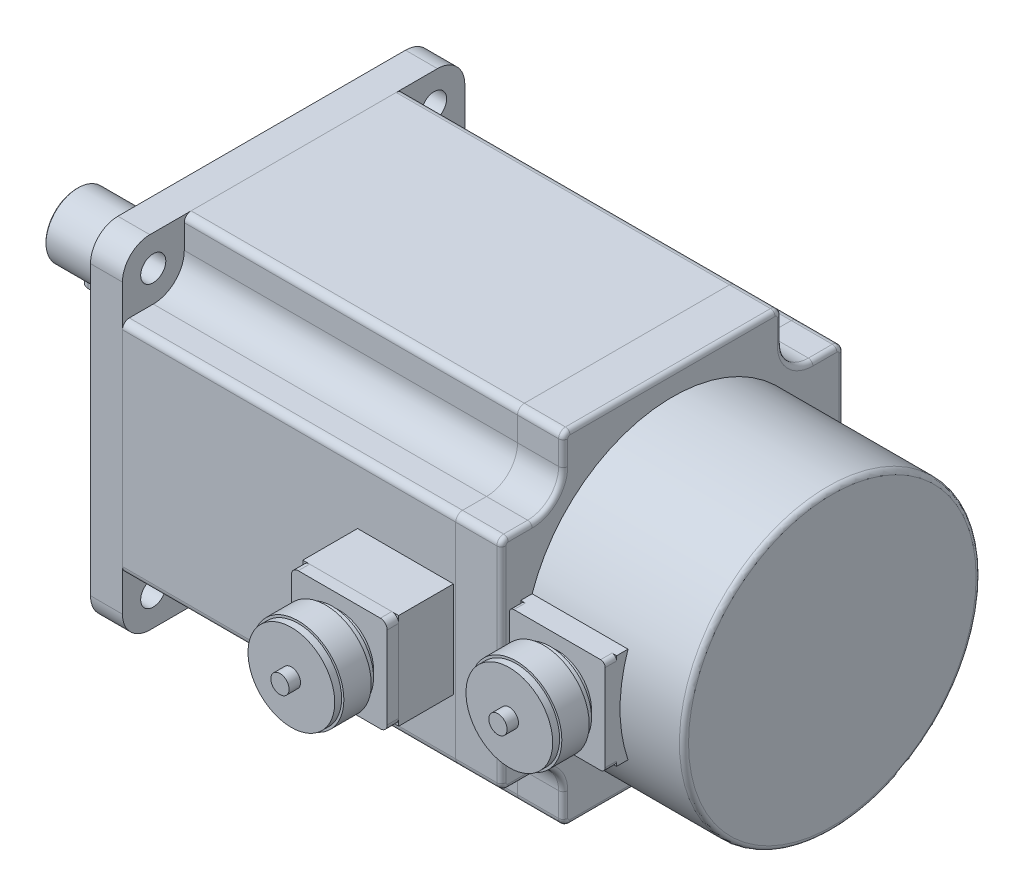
ISO-10303-21;
HEADER;
FILE_DESCRIPTION(('STEP AP214'),'2;1');
FILE_NAME('part.step','',(''),(''),'','','');
FILE_SCHEMA(('AUTOMOTIVE_DESIGN { 1 0 10303 214 1 1 1 1 }'));
ENDSEC;
DATA;
#1=APPLICATION_CONTEXT('core data for automotive mechanical design processes');
#2=APPLICATION_PROTOCOL_DEFINITION('international standard','automotive_design',2000,#1);
#3=PRODUCT_CONTEXT('',#1,'mechanical');
#4=PRODUCT('Part','Part','',(#3));
#5=PRODUCT_RELATED_PRODUCT_CATEGORY('part','',(#4));
#6=PRODUCT_DEFINITION_FORMATION('','',#4);
#7=PRODUCT_DEFINITION_CONTEXT('part definition',#1,'design');
#8=PRODUCT_DEFINITION('design','',#6,#7);
#9=PRODUCT_DEFINITION_SHAPE('','',#8);
#10=(LENGTH_UNIT() NAMED_UNIT(*) SI_UNIT(.MILLI.,.METRE.));
#11=(NAMED_UNIT(*) PLANE_ANGLE_UNIT() SI_UNIT($,.RADIAN.));
#12=(NAMED_UNIT(*) SI_UNIT($,.STERADIAN.) SOLID_ANGLE_UNIT());
#13=UNCERTAINTY_MEASURE_WITH_UNIT(LENGTH_MEASURE(1.E-05),#10,'distance_accuracy_value','');
#14=(GEOMETRIC_REPRESENTATION_CONTEXT(3) GLOBAL_UNCERTAINTY_ASSIGNED_CONTEXT((#13)) GLOBAL_UNIT_ASSIGNED_CONTEXT((#10,
#11,#12)) REPRESENTATION_CONTEXT('',''));
#15=CARTESIAN_POINT('',(0.,0.,0.));
#16=DIRECTION('',(0.,0.,1.));
#17=DIRECTION('',(1.,0.,0.));
#18=AXIS2_PLACEMENT_3D('',#15,#16,#17);
#19=CARTESIAN_POINT('',(-232.,-18.,0.));
#20=DIRECTION('',(0.,1.,0.));
#21=DIRECTION('',(0.,0.,1.));
#22=AXIS2_PLACEMENT_3D('',#19,#20,#21);
#23=CYLINDRICAL_SURFACE('',#22,3.99999999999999);
#24=CARTESIAN_POINT('',(-232.,-10.,0.));
#25=DIRECTION('',(0.,-1.,0.));
#26=DIRECTION('',(0.,0.,-1.));
#27=AXIS2_PLACEMENT_3D('',#24,#25,#26);
#28=CIRCLE('',#27,3.99999999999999);
#29=CARTESIAN_POINT('',(-232.,-10.,3.99999999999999));
#30=VERTEX_POINT('',#29);
#31=CARTESIAN_POINT('',(-232.,-10.,-3.99999999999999));
#32=VERTEX_POINT('',#31);
#33=EDGE_CURVE('E107',#30,#32,#28,.T.);
#34=ORIENTED_EDGE('',*,*,#33,.T.);
#35=DIRECTION('',(0.,1.,0.));
#36=VECTOR('',#35,1.);
#37=CARTESIAN_POINT('',(-232.,-18.,-3.99999999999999));
#38=LINE('',#37,#36);
#39=CARTESIAN_POINT('',(-232.,-18.,-3.99999999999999));
#40=VERTEX_POINT('',#39);
#41=EDGE_CURVE('E12',#40,#32,#38,.T.);
#42=ORIENTED_EDGE('',*,*,#41,.F.);
#43=CARTESIAN_POINT('',(-232.,-18.,0.));
#44=DIRECTION('',(0.,-1.,0.));
#45=DIRECTION('',(0.,0.,-1.));
#46=AXIS2_PLACEMENT_3D('',#43,#44,#45);
#47=CIRCLE('',#46,3.99999999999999);
#48=CARTESIAN_POINT('',(-232.,-18.,3.99999999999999));
#49=VERTEX_POINT('',#48);
#50=EDGE_CURVE('E95',#49,#40,#47,.T.);
#51=ORIENTED_EDGE('',*,*,#50,.F.);
#52=DIRECTION('',(0.,1.,0.));
#53=VECTOR('',#52,1.);
#54=CARTESIAN_POINT('',(-232.,-18.,3.99999999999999));
#55=LINE('',#54,#53);
#56=EDGE_CURVE('E103',#49,#30,#55,.T.);
#57=ORIENTED_EDGE('',*,*,#56,.T.);
#58=EDGE_LOOP('',(#34,#42,#51,#57));
#59=FACE_BOUND('',#58,.T.);
#60=ADVANCED_FACE('F44',(#59),#23,.T.);
#61=CARTESIAN_POINT('',(-185.,-18.,-3.99999999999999));
#62=DIRECTION('',(0.,0.,1.));
#63=DIRECTION('',(1.,0.,0.));
#64=AXIS2_PLACEMENT_3D('',#61,#62,#63);
#65=PLANE('',#64);
#66=DIRECTION('',(1.,0.,0.));
#67=VECTOR('',#66,1.);
#68=CARTESIAN_POINT('',(-185.,-10.,-3.99999999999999));
#69=LINE('',#68,#67);
#70=CARTESIAN_POINT('',(-185.,-10.,-3.99999999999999));
#71=VERTEX_POINT('',#70);
#72=EDGE_CURVE('E99',#32,#71,#69,.T.);
#73=ORIENTED_EDGE('',*,*,#72,.T.);
#74=DIRECTION('',(0.,1.,0.));
#75=VECTOR('',#74,1.);
#76=CARTESIAN_POINT('',(-185.,-18.,-3.99999999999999));
#77=LINE('',#76,#75);
#78=CARTESIAN_POINT('',(-185.,-18.,-3.99999999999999));
#79=VERTEX_POINT('',#78);
#80=EDGE_CURVE('E52',#79,#71,#77,.T.);
#81=ORIENTED_EDGE('',*,*,#80,.F.);
#82=DIRECTION('',(1.,0.,0.));
#83=VECTOR('',#82,1.);
#84=CARTESIAN_POINT('',(-185.,-18.,-3.99999999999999));
#85=LINE('',#84,#83);
#86=EDGE_CURVE('E90',#40,#79,#85,.T.);
#87=ORIENTED_EDGE('',*,*,#86,.F.);
#88=ORIENTED_EDGE('',*,*,#41,.T.);
#89=EDGE_LOOP('',(#73,#81,#87,#88));
#90=FACE_BOUND('',#89,.T.);
#91=ADVANCED_FACE('F98',(#90),#65,.F.);
#92=CARTESIAN_POINT('',(-185.,-18.,0.));
#93=DIRECTION('',(0.,1.,0.));
#94=DIRECTION('',(0.,0.,1.));
#95=AXIS2_PLACEMENT_3D('',#92,#93,#94);
#96=CYLINDRICAL_SURFACE('',#95,3.99999999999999);
#97=CARTESIAN_POINT('',(-185.,-10.,0.));
#98=DIRECTION('',(0.,-1.,0.));
#99=DIRECTION('',(0.,0.,-1.));
#100=AXIS2_PLACEMENT_3D('',#97,#98,#99);
#101=CIRCLE('',#100,3.99999999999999);
#102=CARTESIAN_POINT('',(-185.,-10.,3.99999999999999));
#103=VERTEX_POINT('',#102);
#104=EDGE_CURVE('E77',#71,#103,#101,.T.);
#105=ORIENTED_EDGE('',*,*,#104,.T.);
#106=DIRECTION('',(0.,1.,0.));
#107=VECTOR('',#106,1.);
#108=CARTESIAN_POINT('',(-185.,-18.,3.99999999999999));
#109=LINE('',#108,#107);
#110=CARTESIAN_POINT('',(-185.,-18.,3.99999999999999));
#111=VERTEX_POINT('',#110);
#112=EDGE_CURVE('E100',#111,#103,#109,.T.);
#113=ORIENTED_EDGE('',*,*,#112,.F.);
#114=CARTESIAN_POINT('',(-185.,-18.,0.));
#115=DIRECTION('',(0.,-1.,0.));
#116=DIRECTION('',(0.,0.,-1.));
#117=AXIS2_PLACEMENT_3D('',#114,#115,#116);
#118=CIRCLE('',#117,3.99999999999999);
#119=EDGE_CURVE('E93',#79,#111,#118,.T.);
#120=ORIENTED_EDGE('',*,*,#119,.F.);
#121=ORIENTED_EDGE('',*,*,#80,.T.);
#122=EDGE_LOOP('',(#105,#113,#120,#121));
#123=FACE_BOUND('',#122,.T.);
#124=ADVANCED_FACE('F101',(#123),#96,.T.);
#125=CARTESIAN_POINT('',(-232.,-18.,3.99999999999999));
#126=DIRECTION('',(0.,0.,-1.));
#127=DIRECTION('',(-1.,0.,0.));
#128=AXIS2_PLACEMENT_3D('',#125,#126,#127);
#129=PLANE('',#128);
#130=DIRECTION('',(-1.,0.,0.));
#131=VECTOR('',#130,1.);
#132=CARTESIAN_POINT('',(-232.,-10.,3.99999999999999));
#133=LINE('',#132,#131);
#134=EDGE_CURVE('E83',#103,#30,#133,.T.);
#135=ORIENTED_EDGE('',*,*,#134,.T.);
#136=ORIENTED_EDGE('',*,*,#56,.F.);
#137=DIRECTION('',(-1.,0.,0.));
#138=VECTOR('',#137,1.);
#139=CARTESIAN_POINT('',(-232.,-18.,3.99999999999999));
#140=LINE('',#139,#138);
#141=EDGE_CURVE('E60',#111,#49,#140,.T.);
#142=ORIENTED_EDGE('',*,*,#141,.F.);
#143=ORIENTED_EDGE('',*,*,#112,.T.);
#144=EDGE_LOOP('',(#135,#136,#142,#143));
#145=FACE_BOUND('',#144,.T.);
#146=ADVANCED_FACE('F114',(#145),#129,.F.);
#147=CARTESIAN_POINT('',(-232.,-18.,0.));
#148=DIRECTION('',(0.,-1.,0.));
#149=DIRECTION('',(0.,0.,-1.));
#150=AXIS2_PLACEMENT_3D('',#147,#148,#149);
#151=PLANE('',#150);
#152=ORIENTED_EDGE('',*,*,#50,.T.);
#153=ORIENTED_EDGE('',*,*,#86,.T.);
#154=ORIENTED_EDGE('',*,*,#119,.T.);
#155=ORIENTED_EDGE('',*,*,#141,.T.);
#156=EDGE_LOOP('',(#152,#153,#154,#155));
#157=FACE_BOUND('',#156,.T.);
#158=ADVANCED_FACE('F91',(#157),#151,.T.);
#159=CARTESIAN_POINT('',(-232.,-10.,0.));
#160=DIRECTION('',(0.,-1.,0.));
#161=DIRECTION('',(0.,0.,-1.));
#162=AXIS2_PLACEMENT_3D('',#159,#160,#161);
#163=PLANE('',#162);
#164=ORIENTED_EDGE('',*,*,#33,.F.);
#165=ORIENTED_EDGE('',*,*,#134,.F.);
#166=ORIENTED_EDGE('',*,*,#104,.F.);
#167=ORIENTED_EDGE('',*,*,#72,.F.);
#168=EDGE_LOOP('',(#164,#165,#166,#167));
#169=FACE_BOUND('',#168,.T.);
#170=ADVANCED_FACE('F117',(#169),#163,.F.);
#171=CLOSED_SHELL('',(#60,#91,#124,#146,#158,#170));
#172=MANIFOLD_SOLID_BREP('B2',#171);
#173=CARTESIAN_POINT('',(-241.,0.,0.));
#174=DIRECTION('',(1.,0.,0.));
#175=DIRECTION('',(0.,0.,-1.));
#176=AXIS2_PLACEMENT_3D('',#173,#174,#175);
#177=CYLINDRICAL_SURFACE('',#176,14.);
#178=CARTESIAN_POINT('',(-240.5,0.,0.));
#179=DIRECTION('',(-1.,0.,0.));
#180=DIRECTION('',(0.,0.,1.));
#181=AXIS2_PLACEMENT_3D('',#178,#179,#180);
#182=CIRCLE('',#181,14.);
#183=CARTESIAN_POINT('',(-240.5,0.,14.));
#184=VERTEX_POINT('',#183);
#185=EDGE_CURVE('E256',#184,#184,#182,.F.);
#186=ORIENTED_EDGE('',*,*,#185,.T.);
#187=EDGE_LOOP('',(#186));
#188=FACE_BOUND('',#187,.T.);
#189=CARTESIAN_POINT('',(-169.,0.,0.));
#190=DIRECTION('',(-1.,0.,0.));
#191=DIRECTION('',(0.,0.,1.));
#192=AXIS2_PLACEMENT_3D('',#189,#190,#191);
#193=CIRCLE('',#192,14.);
#194=CARTESIAN_POINT('',(-169.,0.,14.));
#195=VERTEX_POINT('',#194);
#196=EDGE_CURVE('E235',#195,#195,#193,.T.);
#197=ORIENTED_EDGE('',*,*,#196,.T.);
#198=EDGE_LOOP('',(#197));
#199=FACE_BOUND('',#198,.T.);
#200=CARTESIAN_POINT('',(-185.,-13.4164078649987,-3.99999999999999));
#201=CARTESIAN_POINT('',(-184.889963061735,-13.4163934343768,-4.00001343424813));
#202=CARTESIAN_POINT('',(-184.779934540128,-13.417761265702,-3.99545969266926));
#203=CARTESIAN_POINT('',(-184.560712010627,-13.4231542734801,-3.97732232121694));
#204=CARTESIAN_POINT('',(-184.451517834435,-13.4271788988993,-3.96374056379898));
#205=CARTESIAN_POINT('',(-184.234991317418,-13.4377658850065,-3.92769415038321));
#206=CARTESIAN_POINT('',(-184.127655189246,-13.4443222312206,-3.90525054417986));
#207=CARTESIAN_POINT('',(-183.915366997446,-13.4597622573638,-3.85169716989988));
#208=CARTESIAN_POINT('',(-183.810414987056,-13.4686459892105,-3.82058720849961));
#209=CARTESIAN_POINT('',(-183.500282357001,-13.4984072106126,-3.71462722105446));
#210=CARTESIAN_POINT('',(-183.299567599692,-13.5224082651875,-3.62710377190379));
#211=CARTESIAN_POINT('',(-182.915683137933,-13.5760110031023,-3.42099335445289));
#212=CARTESIAN_POINT('',(-182.732520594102,-13.6056149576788,-3.30239378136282));
#213=CARTESIAN_POINT('',(-182.383630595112,-13.6680345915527,-3.03385514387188));
#214=CARTESIAN_POINT('',(-182.21847497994,-13.7009134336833,-2.88318637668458));
#215=CARTESIAN_POINT('',(-181.91539864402,-13.7656378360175,-2.55635049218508));
#216=CARTESIAN_POINT('',(-181.777482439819,-13.7974832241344,-2.38017915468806));
#217=CARTESIAN_POINT('',(-181.53034061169,-13.8572672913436,-2.0032879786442));
#218=CARTESIAN_POINT('',(-181.42169609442,-13.885122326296,-1.80217262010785));
#219=CARTESIAN_POINT('',(-181.239992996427,-13.9330517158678,-1.38360719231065));
#220=CARTESIAN_POINT('',(-181.166925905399,-13.9531279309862,-1.16616104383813));
#221=CARTESIAN_POINT('',(-181.060331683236,-13.9827902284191,-0.727119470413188));
#222=CARTESIAN_POINT('',(-181.025822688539,-13.9926363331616,-0.505780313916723));
#223=CARTESIAN_POINT('',(-180.994226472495,-14.0016419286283,-0.0602449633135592));
#224=CARTESIAN_POINT('',(-180.997132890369,-14.0008032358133,0.163950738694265));
#225=CARTESIAN_POINT('',(-181.039612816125,-13.9887201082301,0.601961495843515));
#226=CARTESIAN_POINT('',(-181.078123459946,-13.9777773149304,0.815889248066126));
#227=CARTESIAN_POINT('',(-181.188991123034,-13.9470775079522,1.2341066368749));
#228=CARTESIAN_POINT('',(-181.261349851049,-13.9273200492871,1.43839578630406));
#229=CARTESIAN_POINT('',(-181.438618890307,-13.8807804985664,1.83414901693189));
#230=CARTESIAN_POINT('',(-181.543876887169,-13.853923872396,2.02544821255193));
#231=CARTESIAN_POINT('',(-181.783693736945,-13.7960546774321,2.38801825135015));
#232=CARTESIAN_POINT('',(-181.918258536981,-13.7650412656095,2.55928501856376));
#233=CARTESIAN_POINT('',(-182.218386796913,-13.7009177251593,2.88324485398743));
#234=CARTESIAN_POINT('',(-182.384870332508,-13.6677722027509,3.03507809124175));
#235=CARTESIAN_POINT('',(-182.741426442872,-13.6040627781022,3.30897556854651));
#236=CARTESIAN_POINT('',(-182.931505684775,-13.573499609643,3.43103136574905));
#237=CARTESIAN_POINT('',(-183.231158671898,-13.5321405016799,3.58945338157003));
#238=CARTESIAN_POINT('',(-183.333989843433,-13.5190503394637,3.63832313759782));
#239=CARTESIAN_POINT('',(-183.543626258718,-13.4948216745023,3.72718558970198));
#240=CARTESIAN_POINT('',(-183.650429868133,-13.4836823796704,3.76718189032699));
#241=CARTESIAN_POINT('',(-183.867138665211,-13.463719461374,3.83791732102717));
#242=CARTESIAN_POINT('',(-183.977040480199,-13.4548934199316,3.86866612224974));
#243=CARTESIAN_POINT('',(-184.199195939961,-13.4398293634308,3.92067829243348));
#244=CARTESIAN_POINT('',(-184.311448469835,-13.4335901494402,3.94194605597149));
#245=CARTESIAN_POINT('',(-184.519732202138,-13.4246640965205,3.97223001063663));
#246=CARTESIAN_POINT('',(-184.615545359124,-13.4215735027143,3.98264484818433));
#247=CARTESIAN_POINT('',(-184.807569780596,-13.4174428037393,3.99652828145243));
#248=CARTESIAN_POINT('',(-184.903780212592,-13.4163995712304,4.0000074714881));
#249=CARTESIAN_POINT('',(-185.,-13.4164078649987,3.99999999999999));
#250=B_SPLINE_CURVE_WITH_KNOTS('',3,(#200,#201,#202,#203,#204,#205,#206,#207,#208,#209,#210,
#211,#212,#213,#214,#215,#216,#217,#218,#219,#220,#221,#222,#223,#224,#225,#226,#227,#228,#229,
#230,#231,#232,#233,#234,#235,#236,#237,#238,#239,#240,#241,#242,#243,#244,#245,#246,#247,#248,
#249),.UNSPECIFIED.,.F.,.F.,(4,2,2,2,2,2,2,2,2,2,2,2,2,2,2,2,2,2,2,2,2,2,2,2,4),(0.,
0.329993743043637,0.659919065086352,0.98906537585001,1.31821902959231,1.97575167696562,
2.6335514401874,3.30832474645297,3.98320984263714,4.67064278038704,5.35791119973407,
6.02724874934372,6.6964725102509,7.34634193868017,7.99624417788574,8.65326120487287,
9.31041168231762,9.99056134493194,10.6709036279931,11.0143588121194,11.357674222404,
11.700629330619,12.0434253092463,12.3324405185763,12.6210139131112),.UNSPECIFIED.);
#251=CARTESIAN_POINT('',(-185.,-13.4164078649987,-3.99999999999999));
#252=VERTEX_POINT('',#251);
#253=CARTESIAN_POINT('',(-185.,-13.4164078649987,3.99999999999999));
#254=VERTEX_POINT('',#253);
#255=EDGE_CURVE('E259',#252,#254,#250,.T.);
#256=ORIENTED_EDGE('',*,*,#255,.F.);
#257=DIRECTION('',(1.,0.,0.));
#258=VECTOR('',#257,1.);
#259=CARTESIAN_POINT('',(-241.,-13.4164078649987,-3.99999999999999));
#260=LINE('',#259,#258);
#261=CARTESIAN_POINT('',(-232.,-13.4164078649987,-3.99999999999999));
#262=VERTEX_POINT('',#261);
#263=EDGE_CURVE('E42',#262,#252,#260,.T.);
#264=ORIENTED_EDGE('',*,*,#263,.F.);
#265=CARTESIAN_POINT('',(-232.,-13.4164078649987,3.99999999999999));
#266=CARTESIAN_POINT('',(-232.110036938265,-13.4163934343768,4.00001343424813));
#267=CARTESIAN_POINT('',(-232.220065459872,-13.417761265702,3.99545969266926));
#268=CARTESIAN_POINT('',(-232.439287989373,-13.4231542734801,3.97732232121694));
#269=CARTESIAN_POINT('',(-232.548482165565,-13.4271788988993,3.96374056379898));
#270=CARTESIAN_POINT('',(-232.765008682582,-13.4377658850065,3.92769415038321));
#271=CARTESIAN_POINT('',(-232.872344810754,-13.4443222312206,3.90525054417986));
#272=CARTESIAN_POINT('',(-233.084633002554,-13.4597622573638,3.85169716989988));
#273=CARTESIAN_POINT('',(-233.189585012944,-13.4686459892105,3.82058720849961));
#274=CARTESIAN_POINT('',(-233.499717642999,-13.4984072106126,3.71462722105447));
#275=CARTESIAN_POINT('',(-233.700432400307,-13.5224082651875,3.62710377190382));
#276=CARTESIAN_POINT('',(-234.084316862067,-13.5760110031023,3.42099335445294));
#277=CARTESIAN_POINT('',(-234.267479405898,-13.6056149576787,3.30239378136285));
#278=CARTESIAN_POINT('',(-234.616369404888,-13.6680345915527,3.03385514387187));
#279=CARTESIAN_POINT('',(-234.78152502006,-13.7009134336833,2.88318637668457));
#280=CARTESIAN_POINT('',(-235.08460135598,-13.7656378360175,2.55635049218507));
#281=CARTESIAN_POINT('',(-235.222517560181,-13.7974832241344,2.38017915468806));
#282=CARTESIAN_POINT('',(-235.46965938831,-13.8572672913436,2.00328797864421));
#283=CARTESIAN_POINT('',(-235.57830390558,-13.885122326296,1.80217262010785));
#284=CARTESIAN_POINT('',(-235.760007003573,-13.9330517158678,1.38360719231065));
#285=CARTESIAN_POINT('',(-235.833074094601,-13.9531279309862,1.16616104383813));
#286=CARTESIAN_POINT('',(-235.939668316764,-13.9827902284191,0.727119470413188));
#287=CARTESIAN_POINT('',(-235.974177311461,-13.9926363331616,0.505780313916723));
#288=CARTESIAN_POINT('',(-236.005773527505,-14.0016419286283,0.0602449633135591));
#289=CARTESIAN_POINT('',(-236.002867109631,-14.0008032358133,-0.163950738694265));
#290=CARTESIAN_POINT('',(-235.960387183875,-13.9887201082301,-0.601961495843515));
#291=CARTESIAN_POINT('',(-235.921876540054,-13.9777773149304,-0.815889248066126));
#292=CARTESIAN_POINT('',(-235.811008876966,-13.9470775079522,-1.2341066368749));
#293=CARTESIAN_POINT('',(-235.738650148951,-13.9273200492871,-1.43839578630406));
#294=CARTESIAN_POINT('',(-235.561381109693,-13.8807804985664,-1.83414901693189));
#295=CARTESIAN_POINT('',(-235.456123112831,-13.853923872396,-2.02544821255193));
#296=CARTESIAN_POINT('',(-235.216306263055,-13.7960546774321,-2.38801825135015));
#297=CARTESIAN_POINT('',(-235.081741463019,-13.7650412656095,-2.55928501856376));
#298=CARTESIAN_POINT('',(-234.781613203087,-13.7009177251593,-2.88324485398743));
#299=CARTESIAN_POINT('',(-234.615129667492,-13.6677722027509,-3.03507809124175));
#300=CARTESIAN_POINT('',(-234.258573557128,-13.6040627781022,-3.30897556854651));
#301=CARTESIAN_POINT('',(-234.068494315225,-13.573499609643,-3.43103136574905));
#302=CARTESIAN_POINT('',(-233.768841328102,-13.5321405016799,-3.58945338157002));
#303=CARTESIAN_POINT('',(-233.666010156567,-13.5190503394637,-3.63832313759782));
#304=CARTESIAN_POINT('',(-233.456373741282,-13.4948216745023,-3.72718558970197));
#305=CARTESIAN_POINT('',(-233.349570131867,-13.4836823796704,-3.76718189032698));
#306=CARTESIAN_POINT('',(-233.132861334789,-13.463719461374,-3.83791732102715));
#307=CARTESIAN_POINT('',(-233.022959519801,-13.4548934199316,-3.86866612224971));
#308=CARTESIAN_POINT('',(-232.800804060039,-13.4398293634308,-3.92067829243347));
#309=CARTESIAN_POINT('',(-232.688551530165,-13.4335901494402,-3.94194605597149));
#310=CARTESIAN_POINT('',(-232.480267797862,-13.4246640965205,-3.97223001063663));
#311=CARTESIAN_POINT('',(-232.384454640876,-13.4215735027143,-3.98264484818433));
#312=CARTESIAN_POINT('',(-232.192430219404,-13.4174428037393,-3.99652828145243));
#313=CARTESIAN_POINT('',(-232.096219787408,-13.4163995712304,-4.0000074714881));
#314=CARTESIAN_POINT('',(-232.,-13.4164078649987,-3.99999999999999));
#315=B_SPLINE_CURVE_WITH_KNOTS('',3,(#265,#266,#267,#268,#269,#270,#271,#272,#273,#274,#275,
#276,#277,#278,#279,#280,#281,#282,#283,#284,#285,#286,#287,#288,#289,#290,#291,#292,#293,#294,
#295,#296,#297,#298,#299,#300,#301,#302,#303,#304,#305,#306,#307,#308,#309,#310,#311,#312,#313,
#314),.UNSPECIFIED.,.F.,.F.,(4,2,2,2,2,2,2,2,2,2,2,2,2,2,2,2,2,2,2,2,2,2,2,2,4),(0.,
0.329993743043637,0.659919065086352,0.98906537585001,1.31821902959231,1.97575167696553,
2.6335514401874,3.30832474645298,3.98320984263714,4.67064278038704,5.35791119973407,
6.02724874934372,6.69647251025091,7.34634193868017,7.99624417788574,8.65326120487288,
9.31041168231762,9.99056134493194,10.6709036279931,11.0143588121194,11.357674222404,
11.7006293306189,12.0434253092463,12.3324405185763,12.6210139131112),.UNSPECIFIED.);
#316=CARTESIAN_POINT('',(-232.,-13.4164078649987,3.99999999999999));
#317=VERTEX_POINT('',#316);
#318=EDGE_CURVE('E184',#317,#262,#315,.T.);
#319=ORIENTED_EDGE('',*,*,#318,.F.);
#320=DIRECTION('',(1.,0.,0.));
#321=VECTOR('',#320,1.);
#322=CARTESIAN_POINT('',(-241.,-13.4164078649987,3.99999999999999));
#323=LINE('',#322,#321);
#324=EDGE_CURVE('E234',#254,#317,#323,.F.);
#325=ORIENTED_EDGE('',*,*,#324,.F.);
#326=EDGE_LOOP('',(#256,#264,#319,#325));
#327=FACE_BOUND('',#326,.T.);
#328=ADVANCED_FACE('F176',(#188,#199,#327),#177,.T.);
#329=CARTESIAN_POINT('',(-169.,0.,0.));
#330=DIRECTION('',(-1.,0.,0.));
#331=DIRECTION('',(0.,0.,1.));
#332=AXIS2_PLACEMENT_3D('',#329,#330,#331);
#333=PLANE('',#332);
#334=CARTESIAN_POINT('',(-169.,0.,0.));
#335=DIRECTION('',(-1.,0.,0.));
#336=DIRECTION('',(0.,0.,1.));
#337=AXIS2_PLACEMENT_3D('',#334,#335,#336);
#338=CIRCLE('',#337,17.);
#339=CARTESIAN_POINT('',(-169.,0.,17.));
#340=VERTEX_POINT('',#339);
#341=EDGE_CURVE('E247',#340,#340,#338,.T.);
#342=ORIENTED_EDGE('',*,*,#341,.T.);
#343=EDGE_LOOP('',(#342));
#344=FACE_BOUND('',#343,.T.);
#345=ORIENTED_EDGE('',*,*,#196,.F.);
#346=EDGE_LOOP('',(#345));
#347=FACE_BOUND('',#346,.T.);
#348=ADVANCED_FACE('F296',(#344,#347),#333,.T.);
#349=CARTESIAN_POINT('',(-169.,0.,0.));
#350=DIRECTION('',(1.,0.,0.));
#351=DIRECTION('',(0.,0.,-1.));
#352=AXIS2_PLACEMENT_3D('',#349,#350,#351);
#353=CYLINDRICAL_SURFACE('',#352,17.5);
#354=CARTESIAN_POINT('',(-168.5,0.,0.));
#355=DIRECTION('',(-1.,0.,0.));
#356=DIRECTION('',(0.,0.,1.));
#357=AXIS2_PLACEMENT_3D('',#354,#355,#356);
#358=CIRCLE('',#357,17.5);
#359=CARTESIAN_POINT('',(-168.5,0.,17.5));
#360=VERTEX_POINT('',#359);
#361=EDGE_CURVE('E250',#360,#360,#358,.F.);
#362=ORIENTED_EDGE('',*,*,#361,.T.);
#363=EDGE_LOOP('',(#362));
#364=FACE_BOUND('',#363,.T.);
#365=CARTESIAN_POINT('',(-166.,0.,0.));
#366=DIRECTION('',(-1.,0.,0.));
#367=DIRECTION('',(0.,0.,1.));
#368=AXIS2_PLACEMENT_3D('',#365,#366,#367);
#369=CIRCLE('',#368,17.5);
#370=CARTESIAN_POINT('',(-166.,0.,17.5));
#371=VERTEX_POINT('',#370);
#372=EDGE_CURVE('E239',#371,#371,#369,.T.);
#373=ORIENTED_EDGE('',*,*,#372,.T.);
#374=EDGE_LOOP('',(#373));
#375=FACE_BOUND('',#374,.T.);
#376=ADVANCED_FACE('F301',(#364,#375),#353,.T.);
#377=CARTESIAN_POINT('',(-166.,0.,0.));
#378=DIRECTION('',(-1.,0.,0.));
#379=DIRECTION('',(0.,0.,1.));
#380=AXIS2_PLACEMENT_3D('',#377,#378,#379);
#381=PLANE('',#380);
#382=ORIENTED_EDGE('',*,*,#372,.F.);
#383=EDGE_LOOP('',(#382));
#384=FACE_BOUND('',#383,.T.);
#385=ADVANCED_FACE('F317',(#384),#381,.F.);
#386=CARTESIAN_POINT('',(-168.5,0.,0.));
#387=DIRECTION('',(-1.,0.,0.));
#388=DIRECTION('',(0.,0.,1.));
#389=AXIS2_PLACEMENT_3D('',#386,#387,#388);
#390=TOROIDAL_SURFACE('',#389,17.,0.5);
#391=ORIENTED_EDGE('',*,*,#361,.F.);
#392=EDGE_LOOP('',(#391));
#393=FACE_BOUND('',#392,.T.);
#394=ORIENTED_EDGE('',*,*,#341,.F.);
#395=EDGE_LOOP('',(#394));
#396=FACE_BOUND('',#395,.T.);
#397=ADVANCED_FACE('F313',(#393,#396),#390,.T.);
#398=CARTESIAN_POINT('',(-241.,0.,0.));
#399=DIRECTION('',(-1.,0.,0.));
#400=DIRECTION('',(0.,0.,1.));
#401=AXIS2_PLACEMENT_3D('',#398,#399,#400);
#402=PLANE('',#401);
#403=CARTESIAN_POINT('',(-241.,0.,0.));
#404=DIRECTION('',(-1.,0.,0.));
#405=DIRECTION('',(0.,0.,1.));
#406=AXIS2_PLACEMENT_3D('',#403,#404,#405);
#407=CIRCLE('',#406,13.5);
#408=CARTESIAN_POINT('',(-241.,0.,13.5));
#409=VERTEX_POINT('',#408);
#410=EDGE_CURVE('E253',#409,#409,#407,.T.);
#411=ORIENTED_EDGE('',*,*,#410,.T.);
#412=EDGE_LOOP('',(#411));
#413=FACE_BOUND('',#412,.T.);
#414=ADVANCED_FACE('F281',(#413),#402,.T.);
#415=CARTESIAN_POINT('',(-241.,0.,0.));
#416=DIRECTION('',(1.,0.,0.));
#417=DIRECTION('',(0.,0.,-1.));
#418=AXIS2_PLACEMENT_3D('',#415,#416,#417);
#419=CONICAL_SURFACE('',#418,13.5,0.785398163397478);
#420=ORIENTED_EDGE('',*,*,#185,.F.);
#421=EDGE_LOOP('',(#420));
#422=FACE_BOUND('',#421,.T.);
#423=ORIENTED_EDGE('',*,*,#410,.F.);
#424=EDGE_LOOP('',(#423));
#425=FACE_BOUND('',#424,.T.);
#426=ADVANCED_FACE('F178',(#422,#425),#419,.T.);
#427=CARTESIAN_POINT('',(-232.,-10.,0.));
#428=DIRECTION('',(0.,-1.,0.));
#429=DIRECTION('',(0.,0.,-1.));
#430=AXIS2_PLACEMENT_3D('',#427,#428,#429);
#431=CYLINDRICAL_SURFACE('',#430,3.99999999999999);
#432=DIRECTION('',(0.,-1.,0.));
#433=VECTOR('',#432,1.);
#434=CARTESIAN_POINT('',(-232.,-10.,3.99999999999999));
#435=LINE('',#434,#433);
#436=CARTESIAN_POINT('',(-232.,-10.,3.99999999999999));
#437=VERTEX_POINT('',#436);
#438=EDGE_CURVE('E231',#437,#317,#435,.T.);
#439=ORIENTED_EDGE('',*,*,#438,.T.);
#440=ORIENTED_EDGE('',*,*,#318,.T.);
#441=DIRECTION('',(0.,-1.,0.));
#442=VECTOR('',#441,1.);
#443=CARTESIAN_POINT('',(-232.,-10.,-3.99999999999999));
#444=LINE('',#443,#442);
#445=CARTESIAN_POINT('',(-232.,-10.,-3.99999999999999));
#446=VERTEX_POINT('',#445);
#447=EDGE_CURVE('E190',#446,#262,#444,.T.);
#448=ORIENTED_EDGE('',*,*,#447,.F.);
#449=CARTESIAN_POINT('',(-232.,-10.,0.));
#450=DIRECTION('',(0.,1.,0.));
#451=DIRECTION('',(0.,0.,1.));
#452=AXIS2_PLACEMENT_3D('',#449,#450,#451);
#453=CIRCLE('',#452,3.99999999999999);
#454=EDGE_CURVE('E221',#446,#437,#453,.T.);
#455=ORIENTED_EDGE('',*,*,#454,.T.);
#456=EDGE_LOOP('',(#439,#440,#448,#455));
#457=FACE_BOUND('',#456,.T.);
#458=ADVANCED_FACE('F230',(#457),#431,.F.);
#459=CARTESIAN_POINT('',(-232.,-10.,3.99999999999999));
#460=DIRECTION('',(0.,0.,-1.));
#461=DIRECTION('',(-1.,0.,0.));
#462=AXIS2_PLACEMENT_3D('',#459,#460,#461);
#463=PLANE('',#462);
#464=ORIENTED_EDGE('',*,*,#324,.T.);
#465=ORIENTED_EDGE('',*,*,#438,.F.);
#466=DIRECTION('',(1.,0.,0.));
#467=VECTOR('',#466,1.);
#468=CARTESIAN_POINT('',(-232.,-10.,3.99999999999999));
#469=LINE('',#468,#467);
#470=CARTESIAN_POINT('',(-185.,-10.,3.99999999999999));
#471=VERTEX_POINT('',#470);
#472=EDGE_CURVE('E217',#437,#471,#469,.T.);
#473=ORIENTED_EDGE('',*,*,#472,.T.);
#474=DIRECTION('',(0.,-1.,0.));
#475=VECTOR('',#474,1.);
#476=CARTESIAN_POINT('',(-185.,-10.,3.99999999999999));
#477=LINE('',#476,#475);
#478=EDGE_CURVE('E236',#471,#254,#477,.T.);
#479=ORIENTED_EDGE('',*,*,#478,.T.);
#480=EDGE_LOOP('',(#464,#465,#473,#479));
#481=FACE_BOUND('',#480,.T.);
#482=ADVANCED_FACE('F233',(#481),#463,.T.);
#483=CARTESIAN_POINT('',(-185.,-10.,0.));
#484=DIRECTION('',(0.,-1.,0.));
#485=DIRECTION('',(0.,0.,-1.));
#486=AXIS2_PLACEMENT_3D('',#483,#484,#485);
#487=CYLINDRICAL_SURFACE('',#486,3.99999999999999);
#488=DIRECTION('',(0.,-1.,0.));
#489=VECTOR('',#488,1.);
#490=CARTESIAN_POINT('',(-185.,-10.,-3.99999999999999));
#491=LINE('',#490,#489);
#492=CARTESIAN_POINT('',(-185.,-10.,-3.99999999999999));
#493=VERTEX_POINT('',#492);
#494=EDGE_CURVE('E241',#493,#252,#491,.T.);
#495=ORIENTED_EDGE('',*,*,#494,.T.);
#496=ORIENTED_EDGE('',*,*,#255,.T.);
#497=ORIENTED_EDGE('',*,*,#478,.F.);
#498=CARTESIAN_POINT('',(-185.,-10.,0.));
#499=DIRECTION('',(0.,1.,0.));
#500=DIRECTION('',(0.,0.,1.));
#501=AXIS2_PLACEMENT_3D('',#498,#499,#500);
#502=CIRCLE('',#501,3.99999999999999);
#503=EDGE_CURVE('E222',#471,#493,#502,.T.);
#504=ORIENTED_EDGE('',*,*,#503,.T.);
#505=EDGE_LOOP('',(#495,#496,#497,#504));
#506=FACE_BOUND('',#505,.T.);
#507=ADVANCED_FACE('F269',(#506),#487,.F.);
#508=CARTESIAN_POINT('',(-185.,-10.,-3.99999999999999));
#509=DIRECTION('',(0.,0.,1.));
#510=DIRECTION('',(1.,0.,0.));
#511=AXIS2_PLACEMENT_3D('',#508,#509,#510);
#512=PLANE('',#511);
#513=ORIENTED_EDGE('',*,*,#263,.T.);
#514=ORIENTED_EDGE('',*,*,#494,.F.);
#515=DIRECTION('',(-1.,0.,0.));
#516=VECTOR('',#515,1.);
#517=CARTESIAN_POINT('',(-185.,-10.,-3.99999999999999));
#518=LINE('',#517,#516);
#519=EDGE_CURVE('E287',#493,#446,#518,.T.);
#520=ORIENTED_EDGE('',*,*,#519,.T.);
#521=ORIENTED_EDGE('',*,*,#447,.T.);
#522=EDGE_LOOP('',(#513,#514,#520,#521));
#523=FACE_BOUND('',#522,.T.);
#524=ADVANCED_FACE('F274',(#523),#512,.T.);
#525=CARTESIAN_POINT('',(-232.,-10.,0.));
#526=DIRECTION('',(0.,1.,0.));
#527=DIRECTION('',(0.,0.,1.));
#528=AXIS2_PLACEMENT_3D('',#525,#526,#527);
#529=PLANE('',#528);
#530=ORIENTED_EDGE('',*,*,#454,.F.);
#531=ORIENTED_EDGE('',*,*,#519,.F.);
#532=ORIENTED_EDGE('',*,*,#503,.F.);
#533=ORIENTED_EDGE('',*,*,#472,.F.);
#534=EDGE_LOOP('',(#530,#531,#532,#533));
#535=FACE_BOUND('',#534,.T.);
#536=ADVANCED_FACE('F219',(#535),#529,.F.);
#537=CLOSED_SHELL('',(#328,#348,#376,#385,#397,#414,#426,#458,#482,#507,#524,#536));
#538=MANIFOLD_SOLID_BREP('B6',#537);
#539=CARTESIAN_POINT('',(-22.,0.,125.));
#540=DIRECTION('',(0.,0.,1.));
#541=DIRECTION('',(1.,0.,0.));
#542=AXIS2_PLACEMENT_3D('',#539,#540,#541);
#543=PLANE('',#542);
#544=CARTESIAN_POINT('',(-22.,0.,125.));
#545=DIRECTION('',(0.,0.,1.));
#546=DIRECTION('',(1.,0.,0.));
#547=AXIS2_PLACEMENT_3D('',#544,#545,#546);
#548=CIRCLE('',#547,19.);
#549=CARTESIAN_POINT('',(-3.,0.,125.));
#550=VERTEX_POINT('',#549);
#551=EDGE_CURVE('E419',#550,#550,#548,.T.);
#552=ORIENTED_EDGE('',*,*,#551,.T.);
#553=EDGE_LOOP('',(#552));
#554=FACE_BOUND('',#553,.T.);
#555=CARTESIAN_POINT('',(-22.,0.,125.));
#556=DIRECTION('',(0.,0.,1.));
#557=DIRECTION('',(1.,0.,0.));
#558=AXIS2_PLACEMENT_3D('',#555,#556,#557);
#559=CIRCLE('',#558,4.);
#560=CARTESIAN_POINT('',(-18.,0.,125.));
#561=VERTEX_POINT('',#560);
#562=EDGE_CURVE('E427',#561,#561,#559,.T.);
#563=ORIENTED_EDGE('',*,*,#562,.F.);
#564=EDGE_LOOP('',(#563));
#565=FACE_BOUND('',#564,.T.);
#566=ADVANCED_FACE('F408',(#554,#565),#543,.T.);
#567=CARTESIAN_POINT('',(-22.,0.,122.));
#568=DIRECTION('',(0.,0.,1.));
#569=DIRECTION('',(1.,0.,0.));
#570=AXIS2_PLACEMENT_3D('',#567,#568,#569);
#571=PLANE('',#570);
#572=CARTESIAN_POINT('',(-22.,0.,122.));
#573=DIRECTION('',(0.,0.,1.));
#574=DIRECTION('',(1.,0.,0.));
#575=AXIS2_PLACEMENT_3D('',#572,#573,#574);
#576=CIRCLE('',#575,20.);
#577=CARTESIAN_POINT('',(-2.,0.,122.));
#578=VERTEX_POINT('',#577);
#579=EDGE_CURVE('E175',#578,#578,#576,.T.);
#580=ORIENTED_EDGE('',*,*,#579,.T.);
#581=EDGE_LOOP('',(#580));
#582=FACE_BOUND('',#581,.T.);
#583=CARTESIAN_POINT('',(-22.,0.,122.));
#584=DIRECTION('',(0.,0.,1.));
#585=DIRECTION('',(1.,0.,0.));
#586=AXIS2_PLACEMENT_3D('',#583,#584,#585);
#587=CIRCLE('',#586,19.);
#588=CARTESIAN_POINT('',(-3.,0.,122.));
#589=VERTEX_POINT('',#588);
#590=EDGE_CURVE('E421',#589,#589,#587,.T.);
#591=ORIENTED_EDGE('',*,*,#590,.F.);
#592=EDGE_LOOP('',(#591));
#593=FACE_BOUND('',#592,.T.);
#594=ADVANCED_FACE('F443',(#582,#593),#571,.T.);
#595=CARTESIAN_POINT('',(-22.,0.,122.));
#596=DIRECTION('',(0.,0.,-1.));
#597=DIRECTION('',(-1.,0.,0.));
#598=AXIS2_PLACEMENT_3D('',#595,#596,#597);
#599=CYLINDRICAL_SURFACE('',#598,20.);
#600=ORIENTED_EDGE('',*,*,#579,.F.);
#601=EDGE_LOOP('',(#600));
#602=FACE_BOUND('',#601,.T.);
#603=CARTESIAN_POINT('',(-22.,0.,110.));
#604=DIRECTION('',(0.,0.,1.));
#605=DIRECTION('',(1.,0.,0.));
#606=AXIS2_PLACEMENT_3D('',#603,#604,#605);
#607=CIRCLE('',#606,20.);
#608=CARTESIAN_POINT('',(-2.,0.,110.));
#609=VERTEX_POINT('',#608);
#610=EDGE_CURVE('E412',#609,#609,#607,.T.);
#611=ORIENTED_EDGE('',*,*,#610,.T.);
#612=EDGE_LOOP('',(#611));
#613=FACE_BOUND('',#612,.T.);
#614=ADVANCED_FACE('F410',(#602,#613),#599,.T.);
#615=CARTESIAN_POINT('',(-22.,0.,110.));
#616=DIRECTION('',(0.,0.,1.));
#617=DIRECTION('',(1.,0.,0.));
#618=AXIS2_PLACEMENT_3D('',#615,#616,#617);
#619=PLANE('',#618);
#620=ORIENTED_EDGE('',*,*,#610,.F.);
#621=EDGE_LOOP('',(#620));
#622=FACE_BOUND('',#621,.T.);
#623=ADVANCED_FACE('F453',(#622),#619,.F.);
#624=CARTESIAN_POINT('',(-22.,0.,125.));
#625=DIRECTION('',(0.,0.,-1.));
#626=DIRECTION('',(-1.,0.,0.));
#627=AXIS2_PLACEMENT_3D('',#624,#625,#626);
#628=CYLINDRICAL_SURFACE('',#627,19.);
#629=ORIENTED_EDGE('',*,*,#551,.F.);
#630=EDGE_LOOP('',(#629));
#631=FACE_BOUND('',#630,.T.);
#632=ORIENTED_EDGE('',*,*,#590,.T.);
#633=EDGE_LOOP('',(#632));
#634=FACE_BOUND('',#633,.T.);
#635=ADVANCED_FACE('F438',(#631,#634),#628,.T.);
#636=CARTESIAN_POINT('',(-22.,0.,130.));
#637=DIRECTION('',(0.,0.,-1.));
#638=DIRECTION('',(-1.,0.,0.));
#639=AXIS2_PLACEMENT_3D('',#636,#637,#638);
#640=CYLINDRICAL_SURFACE('',#639,4.);
#641=CARTESIAN_POINT('',(-22.,0.,130.));
#642=DIRECTION('',(0.,0.,1.));
#643=DIRECTION('',(1.,0.,0.));
#644=AXIS2_PLACEMENT_3D('',#641,#642,#643);
#645=CIRCLE('',#644,4.);
#646=CARTESIAN_POINT('',(-18.,0.,130.));
#647=VERTEX_POINT('',#646);
#648=EDGE_CURVE('E424',#647,#647,#645,.T.);
#649=ORIENTED_EDGE('',*,*,#648,.F.);
#650=EDGE_LOOP('',(#649));
#651=FACE_BOUND('',#650,.T.);
#652=ORIENTED_EDGE('',*,*,#562,.T.);
#653=EDGE_LOOP('',(#652));
#654=FACE_BOUND('',#653,.T.);
#655=ADVANCED_FACE('F435',(#651,#654),#640,.T.);
#656=CARTESIAN_POINT('',(-22.,0.,130.));
#657=DIRECTION('',(0.,0.,1.));
#658=DIRECTION('',(1.,0.,0.));
#659=AXIS2_PLACEMENT_3D('',#656,#657,#658);
#660=PLANE('',#659);
#661=ORIENTED_EDGE('',*,*,#648,.T.);
#662=EDGE_LOOP('',(#661));
#663=FACE_BOUND('',#662,.T.);
#664=ADVANCED_FACE('F433',(#663),#660,.T.);
#665=CLOSED_SHELL('',(#566,#594,#614,#623,#635,#655,#664));
#666=MANIFOLD_SOLID_BREP('B36',#665);
#667=CARTESIAN_POINT('',(-22.,0.,110.));
#668=DIRECTION('',(0.,0.,-1.));
#669=DIRECTION('',(-1.,0.,0.));
#670=AXIS2_PLACEMENT_3D('',#667,#668,#669);
#671=CYLINDRICAL_SURFACE('',#670,18.);
#672=CARTESIAN_POINT('',(-22.,0.,110.));
#673=DIRECTION('',(0.,0.,1.));
#674=DIRECTION('',(1.,0.,0.));
#675=AXIS2_PLACEMENT_3D('',#672,#673,#674);
#676=CIRCLE('',#675,18.);
#677=CARTESIAN_POINT('',(-4.,0.,110.));
#678=VERTEX_POINT('',#677);
#679=EDGE_CURVE('E407',#678,#678,#676,.T.);
#680=ORIENTED_EDGE('',*,*,#679,.F.);
#681=EDGE_LOOP('',(#680));
#682=FACE_BOUND('',#681,.T.);
#683=CARTESIAN_POINT('',(-22.,0.,107.));
#684=DIRECTION('',(0.,0.,1.));
#685=DIRECTION('',(1.,0.,0.));
#686=AXIS2_PLACEMENT_3D('',#683,#684,#685);
#687=CIRCLE('',#686,18.);
#688=CARTESIAN_POINT('',(-4.,0.,107.));
#689=VERTEX_POINT('',#688);
#690=EDGE_CURVE('E520',#689,#689,#687,.T.);
#691=ORIENTED_EDGE('',*,*,#690,.T.);
#692=EDGE_LOOP('',(#691));
#693=FACE_BOUND('',#692,.T.);
#694=ADVANCED_FACE('F517',(#682,#693),#671,.T.);
#695=CARTESIAN_POINT('',(-22.,0.,110.));
#696=DIRECTION('',(0.,0.,1.));
#697=DIRECTION('',(1.,0.,0.));
#698=AXIS2_PLACEMENT_3D('',#695,#696,#697);
#699=PLANE('',#698);
#700=ORIENTED_EDGE('',*,*,#679,.T.);
#701=EDGE_LOOP('',(#700));
#702=FACE_BOUND('',#701,.T.);
#703=ADVANCED_FACE('F532',(#702),#699,.T.);
#704=CARTESIAN_POINT('',(-22.,0.,107.));
#705=DIRECTION('',(0.,0.,1.));
#706=DIRECTION('',(1.,0.,0.));
#707=AXIS2_PLACEMENT_3D('',#704,#705,#706);
#708=PLANE('',#707);
#709=ORIENTED_EDGE('',*,*,#690,.F.);
#710=EDGE_LOOP('',(#709));
#711=FACE_BOUND('',#710,.T.);
#712=ADVANCED_FACE('F530',(#711),#708,.F.);
#713=CLOSED_SHELL('',(#694,#703,#712));
#714=MANIFOLD_SOLID_BREP('B170',#713);
#715=CARTESIAN_POINT('',(-22.,0.,107.));
#716=DIRECTION('',(0.,0.,-1.));
#717=DIRECTION('',(-1.,0.,0.));
#718=AXIS2_PLACEMENT_3D('',#715,#716,#717);
#719=CYLINDRICAL_SURFACE('',#718,15.);
#720=CARTESIAN_POINT('',(-22.,0.,107.));
#721=DIRECTION('',(0.,0.,1.));
#722=DIRECTION('',(1.,0.,0.));
#723=AXIS2_PLACEMENT_3D('',#720,#721,#722);
#724=CIRCLE('',#723,15.);
#725=CARTESIAN_POINT('',(-7.,0.,107.));
#726=VERTEX_POINT('',#725);
#727=EDGE_CURVE('E516',#726,#726,#724,.T.);
#728=ORIENTED_EDGE('',*,*,#727,.F.);
#729=EDGE_LOOP('',(#728));
#730=FACE_BOUND('',#729,.T.);
#731=CARTESIAN_POINT('',(-22.,0.,104.));
#732=DIRECTION('',(0.,0.,1.));
#733=DIRECTION('',(1.,0.,0.));
#734=AXIS2_PLACEMENT_3D('',#731,#732,#733);
#735=CIRCLE('',#734,15.);
#736=CARTESIAN_POINT('',(-7.,0.,104.));
#737=VERTEX_POINT('',#736);
#738=EDGE_CURVE('E571',#737,#737,#735,.T.);
#739=ORIENTED_EDGE('',*,*,#738,.T.);
#740=EDGE_LOOP('',(#739));
#741=FACE_BOUND('',#740,.T.);
#742=ADVANCED_FACE('F568',(#730,#741),#719,.T.);
#743=CARTESIAN_POINT('',(-22.,0.,107.));
#744=DIRECTION('',(0.,0.,1.));
#745=DIRECTION('',(1.,0.,0.));
#746=AXIS2_PLACEMENT_3D('',#743,#744,#745);
#747=PLANE('',#746);
#748=ORIENTED_EDGE('',*,*,#727,.T.);
#749=EDGE_LOOP('',(#748));
#750=FACE_BOUND('',#749,.T.);
#751=ADVANCED_FACE('F583',(#750),#747,.T.);
#752=CARTESIAN_POINT('',(-22.,0.,104.));
#753=DIRECTION('',(0.,0.,1.));
#754=DIRECTION('',(1.,0.,0.));
#755=AXIS2_PLACEMENT_3D('',#752,#753,#754);
#756=PLANE('',#755);
#757=ORIENTED_EDGE('',*,*,#738,.F.);
#758=EDGE_LOOP('',(#757));
#759=FACE_BOUND('',#758,.T.);
#760=ADVANCED_FACE('F581',(#759),#756,.F.);
#761=CLOSED_SHELL('',(#742,#751,#760));
#762=MANIFOLD_SOLID_BREP('B402',#761);
#763=CARTESIAN_POINT('',(-40.,-18.,104.));
#764=DIRECTION('',(0.,0.,-1.));
#765=DIRECTION('',(-1.,0.,0.));
#766=AXIS2_PLACEMENT_3D('',#763,#764,#765);
#767=CYLINDRICAL_SURFACE('',#766,3.);
#768=CARTESIAN_POINT('',(-40.,-18.,99.));
#769=DIRECTION('',(0.,0.,1.));
#770=DIRECTION('',(-1.,0.,0.));
#771=AXIS2_PLACEMENT_3D('',#768,#769,#770);
#772=CIRCLE('',#771,3.);
#773=CARTESIAN_POINT('',(-43.,-18.,99.));
#774=VERTEX_POINT('',#773);
#775=CARTESIAN_POINT('',(-40.,-21.,99.));
#776=VERTEX_POINT('',#775);
#777=EDGE_CURVE('E715',#774,#776,#772,.T.);
#778=ORIENTED_EDGE('',*,*,#777,.T.);
#779=DIRECTION('',(0.,0.,-1.));
#780=VECTOR('',#779,1.);
#781=CARTESIAN_POINT('',(-40.,-21.,104.));
#782=LINE('',#781,#780);
#783=CARTESIAN_POINT('',(-40.,-21.,104.));
#784=VERTEX_POINT('',#783);
#785=EDGE_CURVE('E566',#784,#776,#782,.T.);
#786=ORIENTED_EDGE('',*,*,#785,.F.);
#787=CARTESIAN_POINT('',(-40.,-18.,104.));
#788=DIRECTION('',(0.,0.,1.));
#789=DIRECTION('',(-1.,0.,0.));
#790=AXIS2_PLACEMENT_3D('',#787,#788,#789);
#791=CIRCLE('',#790,3.);
#792=CARTESIAN_POINT('',(-43.,-18.,104.));
#793=VERTEX_POINT('',#792);
#794=EDGE_CURVE('E729',#793,#784,#791,.T.);
#795=ORIENTED_EDGE('',*,*,#794,.F.);
#796=DIRECTION('',(0.,0.,-1.));
#797=VECTOR('',#796,1.);
#798=CARTESIAN_POINT('',(-43.,-18.,104.));
#799=LINE('',#798,#797);
#800=EDGE_CURVE('E711',#793,#774,#799,.T.);
#801=ORIENTED_EDGE('',*,*,#800,.T.);
#802=EDGE_LOOP('',(#778,#786,#795,#801));
#803=FACE_BOUND('',#802,.T.);
#804=ADVANCED_FACE('F619',(#803),#767,.T.);
#805=CARTESIAN_POINT('',(-40.,-21.,104.));
#806=DIRECTION('',(0.,1.,0.));
#807=DIRECTION('',(0.,0.,1.));
#808=AXIS2_PLACEMENT_3D('',#805,#806,#807);
#809=PLANE('',#808);
#810=DIRECTION('',(1.,0.,0.));
#811=VECTOR('',#810,1.);
#812=CARTESIAN_POINT('',(-40.,-21.,99.));
#813=LINE('',#812,#811);
#814=CARTESIAN_POINT('',(-4.00000000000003,-21.,99.));
#815=VERTEX_POINT('',#814);
#816=EDGE_CURVE('E718',#776,#815,#813,.T.);
#817=ORIENTED_EDGE('',*,*,#816,.T.);
#818=DIRECTION('',(0.,0.,-1.));
#819=VECTOR('',#818,1.);
#820=CARTESIAN_POINT('',(-4.00000000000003,-21.,104.));
#821=LINE('',#820,#819);
#822=CARTESIAN_POINT('',(-4.00000000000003,-21.,104.));
#823=VERTEX_POINT('',#822);
#824=EDGE_CURVE('E627',#823,#815,#821,.T.);
#825=ORIENTED_EDGE('',*,*,#824,.F.);
#826=DIRECTION('',(1.,0.,0.));
#827=VECTOR('',#826,1.);
#828=CARTESIAN_POINT('',(-40.,-21.,104.));
#829=LINE('',#828,#827);
#830=EDGE_CURVE('E678',#784,#823,#829,.T.);
#831=ORIENTED_EDGE('',*,*,#830,.F.);
#832=ORIENTED_EDGE('',*,*,#785,.T.);
#833=EDGE_LOOP('',(#817,#825,#831,#832));
#834=FACE_BOUND('',#833,.T.);
#835=ADVANCED_FACE('F764',(#834),#809,.F.);
#836=CARTESIAN_POINT('',(-4.00000000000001,-18.,104.));
#837=DIRECTION('',(0.,0.,-1.));
#838=DIRECTION('',(-1.,0.,0.));
#839=AXIS2_PLACEMENT_3D('',#836,#837,#838);
#840=CYLINDRICAL_SURFACE('',#839,3.);
#841=CARTESIAN_POINT('',(-4.00000000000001,-18.,99.));
#842=DIRECTION('',(0.,0.,1.));
#843=DIRECTION('',(1.,0.,0.));
#844=AXIS2_PLACEMENT_3D('',#841,#842,#843);
#845=CIRCLE('',#844,3.);
#846=CARTESIAN_POINT('',(-1.00000000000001,-18.,99.));
#847=VERTEX_POINT('',#846);
#848=EDGE_CURVE('E720',#815,#847,#845,.T.);
#849=ORIENTED_EDGE('',*,*,#848,.T.);
#850=DIRECTION('',(0.,0.,-1.));
#851=VECTOR('',#850,1.);
#852=CARTESIAN_POINT('',(-1.00000000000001,-18.,104.));
#853=LINE('',#852,#851);
#854=CARTESIAN_POINT('',(-1.00000000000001,-18.,104.));
#855=VERTEX_POINT('',#854);
#856=EDGE_CURVE('E736',#855,#847,#853,.T.);
#857=ORIENTED_EDGE('',*,*,#856,.F.);
#858=CARTESIAN_POINT('',(-4.00000000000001,-18.,104.));
#859=DIRECTION('',(0.,0.,1.));
#860=DIRECTION('',(1.,0.,0.));
#861=AXIS2_PLACEMENT_3D('',#858,#859,#860);
#862=CIRCLE('',#861,3.);
#863=EDGE_CURVE('E744',#823,#855,#862,.T.);
#864=ORIENTED_EDGE('',*,*,#863,.F.);
#865=ORIENTED_EDGE('',*,*,#824,.T.);
#866=EDGE_LOOP('',(#849,#857,#864,#865));
#867=FACE_BOUND('',#866,.T.);
#868=ADVANCED_FACE('F742',(#867),#840,.T.);
#869=CARTESIAN_POINT('',(-1.00000000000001,-18.,104.));
#870=DIRECTION('',(-1.,0.,0.));
#871=DIRECTION('',(0.,0.,1.));
#872=AXIS2_PLACEMENT_3D('',#869,#870,#871);
#873=PLANE('',#872);
#874=DIRECTION('',(0.,1.,0.));
#875=VECTOR('',#874,1.);
#876=CARTESIAN_POINT('',(-1.00000000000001,-18.,99.));
#877=LINE('',#876,#875);
#878=CARTESIAN_POINT('',(-1.00000000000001,18.,99.));
#879=VERTEX_POINT('',#878);
#880=EDGE_CURVE('E722',#847,#879,#877,.T.);
#881=ORIENTED_EDGE('',*,*,#880,.T.);
#882=DIRECTION('',(0.,0.,-1.));
#883=VECTOR('',#882,1.);
#884=CARTESIAN_POINT('',(-1.00000000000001,18.,104.));
#885=LINE('',#884,#883);
#886=CARTESIAN_POINT('',(-1.00000000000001,18.,104.));
#887=VERTEX_POINT('',#886);
#888=EDGE_CURVE('E733',#887,#879,#885,.T.);
#889=ORIENTED_EDGE('',*,*,#888,.F.);
#890=DIRECTION('',(0.,1.,0.));
#891=VECTOR('',#890,1.);
#892=CARTESIAN_POINT('',(-1.00000000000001,-18.,104.));
#893=LINE('',#892,#891);
#894=EDGE_CURVE('E756',#855,#887,#893,.T.);
#895=ORIENTED_EDGE('',*,*,#894,.F.);
#896=ORIENTED_EDGE('',*,*,#856,.T.);
#897=EDGE_LOOP('',(#881,#889,#895,#896));
#898=FACE_BOUND('',#897,.T.);
#899=ADVANCED_FACE('F752',(#898),#873,.F.);
#900=CARTESIAN_POINT('',(-4.00000000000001,18.,104.));
#901=DIRECTION('',(0.,0.,-1.));
#902=DIRECTION('',(-1.,0.,0.));
#903=AXIS2_PLACEMENT_3D('',#900,#901,#902);
#904=CYLINDRICAL_SURFACE('',#903,3.);
#905=CARTESIAN_POINT('',(-4.00000000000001,18.,99.));
#906=DIRECTION('',(0.,0.,1.));
#907=DIRECTION('',(-1.,0.,0.));
#908=AXIS2_PLACEMENT_3D('',#905,#906,#907);
#909=CIRCLE('',#908,3.);
#910=CARTESIAN_POINT('',(-4.00000000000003,21.,99.));
#911=VERTEX_POINT('',#910);
#912=EDGE_CURVE('E724',#879,#911,#909,.T.);
#913=ORIENTED_EDGE('',*,*,#912,.T.);
#914=DIRECTION('',(0.,0.,-1.));
#915=VECTOR('',#914,1.);
#916=CARTESIAN_POINT('',(-4.00000000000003,21.,104.));
#917=LINE('',#916,#915);
#918=CARTESIAN_POINT('',(-4.00000000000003,21.,104.));
#919=VERTEX_POINT('',#918);
#920=EDGE_CURVE('E706',#919,#911,#917,.T.);
#921=ORIENTED_EDGE('',*,*,#920,.F.);
#922=CARTESIAN_POINT('',(-4.00000000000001,18.,104.));
#923=DIRECTION('',(0.,0.,1.));
#924=DIRECTION('',(-1.,0.,0.));
#925=AXIS2_PLACEMENT_3D('',#922,#923,#924);
#926=CIRCLE('',#925,3.);
#927=EDGE_CURVE('E697',#887,#919,#926,.T.);
#928=ORIENTED_EDGE('',*,*,#927,.F.);
#929=ORIENTED_EDGE('',*,*,#888,.T.);
#930=EDGE_LOOP('',(#913,#921,#928,#929));
#931=FACE_BOUND('',#930,.T.);
#932=ADVANCED_FACE('F755',(#931),#904,.T.);
#933=CARTESIAN_POINT('',(-40.,21.,104.));
#934=DIRECTION('',(0.,-1.,0.));
#935=DIRECTION('',(0.,0.,-1.));
#936=AXIS2_PLACEMENT_3D('',#933,#934,#935);
#937=PLANE('',#936);
#938=DIRECTION('',(-1.,0.,0.));
#939=VECTOR('',#938,1.);
#940=CARTESIAN_POINT('',(-40.,21.,99.));
#941=LINE('',#940,#939);
#942=CARTESIAN_POINT('',(-40.,21.,99.));
#943=VERTEX_POINT('',#942);
#944=EDGE_CURVE('E705',#911,#943,#941,.T.);
#945=ORIENTED_EDGE('',*,*,#944,.T.);
#946=DIRECTION('',(0.,0.,-1.));
#947=VECTOR('',#946,1.);
#948=CARTESIAN_POINT('',(-40.,21.,104.));
#949=LINE('',#948,#947);
#950=CARTESIAN_POINT('',(-40.,21.,104.));
#951=VERTEX_POINT('',#950);
#952=EDGE_CURVE('E702',#951,#943,#949,.T.);
#953=ORIENTED_EDGE('',*,*,#952,.F.);
#954=DIRECTION('',(-1.,0.,0.));
#955=VECTOR('',#954,1.);
#956=CARTESIAN_POINT('',(-40.,21.,104.));
#957=LINE('',#956,#955);
#958=EDGE_CURVE('E691',#919,#951,#957,.T.);
#959=ORIENTED_EDGE('',*,*,#958,.F.);
#960=ORIENTED_EDGE('',*,*,#920,.T.);
#961=EDGE_LOOP('',(#945,#953,#959,#960));
#962=FACE_BOUND('',#961,.T.);
#963=ADVANCED_FACE('F703',(#962),#937,.F.);
#964=CARTESIAN_POINT('',(-40.,18.,104.));
#965=DIRECTION('',(0.,0.,-1.));
#966=DIRECTION('',(-1.,0.,0.));
#967=AXIS2_PLACEMENT_3D('',#964,#965,#966);
#968=CYLINDRICAL_SURFACE('',#967,3.);
#969=CARTESIAN_POINT('',(-40.,18.,99.));
#970=DIRECTION('',(0.,0.,1.));
#971=DIRECTION('',(-1.,0.,0.));
#972=AXIS2_PLACEMENT_3D('',#969,#970,#971);
#973=CIRCLE('',#972,3.);
#974=CARTESIAN_POINT('',(-43.,18.,99.));
#975=VERTEX_POINT('',#974);
#976=EDGE_CURVE('E664',#943,#975,#973,.T.);
#977=ORIENTED_EDGE('',*,*,#976,.T.);
#978=DIRECTION('',(0.,0.,-1.));
#979=VECTOR('',#978,1.);
#980=CARTESIAN_POINT('',(-43.,18.,104.));
#981=LINE('',#980,#979);
#982=CARTESIAN_POINT('',(-43.,18.,104.));
#983=VERTEX_POINT('',#982);
#984=EDGE_CURVE('E707',#983,#975,#981,.T.);
#985=ORIENTED_EDGE('',*,*,#984,.F.);
#986=CARTESIAN_POINT('',(-40.,18.,104.));
#987=DIRECTION('',(0.,0.,1.));
#988=DIRECTION('',(-1.,0.,0.));
#989=AXIS2_PLACEMENT_3D('',#986,#987,#988);
#990=CIRCLE('',#989,3.);
#991=EDGE_CURVE('E695',#951,#983,#990,.T.);
#992=ORIENTED_EDGE('',*,*,#991,.F.);
#993=ORIENTED_EDGE('',*,*,#952,.T.);
#994=EDGE_LOOP('',(#977,#985,#992,#993));
#995=FACE_BOUND('',#994,.T.);
#996=ADVANCED_FACE('F709',(#995),#968,.T.);
#997=CARTESIAN_POINT('',(-43.,-18.,104.));
#998=DIRECTION('',(1.,0.,0.));
#999=DIRECTION('',(0.,0.,-1.));
#1000=AXIS2_PLACEMENT_3D('',#997,#998,#999);
#1001=PLANE('',#1000);
#1002=DIRECTION('',(0.,-1.,0.));
#1003=VECTOR('',#1002,1.);
#1004=CARTESIAN_POINT('',(-43.,-18.,99.));
#1005=LINE('',#1004,#1003);
#1006=EDGE_CURVE('E670',#975,#774,#1005,.T.);
#1007=ORIENTED_EDGE('',*,*,#1006,.T.);
#1008=ORIENTED_EDGE('',*,*,#800,.F.);
#1009=DIRECTION('',(0.,-1.,0.));
#1010=VECTOR('',#1009,1.);
#1011=CARTESIAN_POINT('',(-43.,-18.,104.));
#1012=LINE('',#1011,#1010);
#1013=EDGE_CURVE('E635',#983,#793,#1012,.T.);
#1014=ORIENTED_EDGE('',*,*,#1013,.F.);
#1015=ORIENTED_EDGE('',*,*,#984,.T.);
#1016=EDGE_LOOP('',(#1007,#1008,#1014,#1015));
#1017=FACE_BOUND('',#1016,.T.);
#1018=ADVANCED_FACE('F780',(#1017),#1001,.F.);
#1019=CARTESIAN_POINT('',(-40.,-18.,104.));
#1020=DIRECTION('',(0.,0.,-1.));
#1021=DIRECTION('',(-1.,0.,0.));
#1022=AXIS2_PLACEMENT_3D('',#1019,#1020,#1021);
#1023=PLANE('',#1022);
#1024=ORIENTED_EDGE('',*,*,#794,.T.);
#1025=ORIENTED_EDGE('',*,*,#830,.T.);
#1026=ORIENTED_EDGE('',*,*,#863,.T.);
#1027=ORIENTED_EDGE('',*,*,#894,.T.);
#1028=ORIENTED_EDGE('',*,*,#927,.T.);
#1029=ORIENTED_EDGE('',*,*,#958,.T.);
#1030=ORIENTED_EDGE('',*,*,#991,.T.);
#1031=ORIENTED_EDGE('',*,*,#1013,.T.);
#1032=EDGE_LOOP('',(#1024,#1025,#1026,#1027,#1028,#1029,#1030,#1031));
#1033=FACE_BOUND('',#1032,.T.);
#1034=ADVANCED_FACE('F693',(#1033),#1023,.F.);
#1035=CARTESIAN_POINT('',(-40.,-18.,99.));
#1036=DIRECTION('',(0.,0.,-1.));
#1037=DIRECTION('',(-1.,0.,0.));
#1038=AXIS2_PLACEMENT_3D('',#1035,#1036,#1037);
#1039=PLANE('',#1038);
#1040=ORIENTED_EDGE('',*,*,#777,.F.);
#1041=ORIENTED_EDGE('',*,*,#1006,.F.);
#1042=ORIENTED_EDGE('',*,*,#976,.F.);
#1043=ORIENTED_EDGE('',*,*,#944,.F.);
#1044=ORIENTED_EDGE('',*,*,#912,.F.);
#1045=ORIENTED_EDGE('',*,*,#880,.F.);
#1046=ORIENTED_EDGE('',*,*,#848,.F.);
#1047=ORIENTED_EDGE('',*,*,#816,.F.);
#1048=EDGE_LOOP('',(#1040,#1041,#1042,#1043,#1044,#1045,#1046,#1047));
#1049=FACE_BOUND('',#1048,.T.);
#1050=ADVANCED_FACE('F748',(#1049),#1039,.T.);
#1051=CLOSED_SHELL('',(#804,#835,#868,#899,#932,#963,#996,#1018,#1034,#1050));
#1052=MANIFOLD_SOLID_BREP('B511',#1051);
#1053=CARTESIAN_POINT('',(-0.999999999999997,-21.,99.));
#1054=DIRECTION('',(-1.,0.,0.));
#1055=DIRECTION('',(0.,-1.,0.));
#1056=AXIS2_PLACEMENT_3D('',#1053,#1054,#1055);
#1057=PLANE('',#1056);
#1058=DIRECTION('',(0.,1.,0.));
#1059=VECTOR('',#1058,1.);
#1060=CARTESIAN_POINT('',(-0.999999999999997,-21.,75.));
#1061=LINE('',#1060,#1059);
#1062=CARTESIAN_POINT('',(-0.999999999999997,-21.,75.));
#1063=VERTEX_POINT('',#1062);
#1064=CARTESIAN_POINT('',(-1.00000000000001,21.,75.));
#1065=VERTEX_POINT('',#1064);
#1066=EDGE_CURVE('E920',#1063,#1065,#1061,.T.);
#1067=ORIENTED_EDGE('',*,*,#1066,.T.);
#1068=DIRECTION('',(0.,0.,-1.));
#1069=VECTOR('',#1068,1.);
#1070=CARTESIAN_POINT('',(-1.00000000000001,21.,99.));
#1071=LINE('',#1070,#1069);
#1072=CARTESIAN_POINT('',(-1.00000000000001,21.,99.));
#1073=VERTEX_POINT('',#1072);
#1074=EDGE_CURVE('E617',#1073,#1065,#1071,.T.);
#1075=ORIENTED_EDGE('',*,*,#1074,.F.);
#1076=DIRECTION('',(0.,1.,0.));
#1077=VECTOR('',#1076,1.);
#1078=CARTESIAN_POINT('',(-0.999999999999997,-21.,99.));
#1079=LINE('',#1078,#1077);
#1080=CARTESIAN_POINT('',(-0.999999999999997,-21.,99.));
#1081=VERTEX_POINT('',#1080);
#1082=EDGE_CURVE('E908',#1081,#1073,#1079,.T.);
#1083=ORIENTED_EDGE('',*,*,#1082,.F.);
#1084=DIRECTION('',(0.,0.,-1.));
#1085=VECTOR('',#1084,1.);
#1086=CARTESIAN_POINT('',(-0.999999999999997,-21.,99.));
#1087=LINE('',#1086,#1085);
#1088=EDGE_CURVE('E916',#1081,#1063,#1087,.T.);
#1089=ORIENTED_EDGE('',*,*,#1088,.T.);
#1090=EDGE_LOOP('',(#1067,#1075,#1083,#1089));
#1091=FACE_BOUND('',#1090,.T.);
#1092=ADVANCED_FACE('F857',(#1091),#1057,.F.);
#1093=CARTESIAN_POINT('',(-43.,21.,99.));
#1094=DIRECTION('',(0.,-1.,0.));
#1095=DIRECTION('',(0.,0.,-1.));
#1096=AXIS2_PLACEMENT_3D('',#1093,#1094,#1095);
#1097=PLANE('',#1096);
#1098=DIRECTION('',(-1.,0.,0.));
#1099=VECTOR('',#1098,1.);
#1100=CARTESIAN_POINT('',(-43.,21.,75.));
#1101=LINE('',#1100,#1099);
#1102=CARTESIAN_POINT('',(-43.,21.,75.));
#1103=VERTEX_POINT('',#1102);
#1104=EDGE_CURVE('E912',#1065,#1103,#1101,.T.);
#1105=ORIENTED_EDGE('',*,*,#1104,.T.);
#1106=DIRECTION('',(0.,0.,-1.));
#1107=VECTOR('',#1106,1.);
#1108=CARTESIAN_POINT('',(-43.,21.,99.));
#1109=LINE('',#1108,#1107);
#1110=CARTESIAN_POINT('',(-43.,21.,99.));
#1111=VERTEX_POINT('',#1110);
#1112=EDGE_CURVE('E865',#1111,#1103,#1109,.T.);
#1113=ORIENTED_EDGE('',*,*,#1112,.F.);
#1114=DIRECTION('',(-1.,0.,0.));
#1115=VECTOR('',#1114,1.);
#1116=CARTESIAN_POINT('',(-43.,21.,99.));
#1117=LINE('',#1116,#1115);
#1118=EDGE_CURVE('E903',#1073,#1111,#1117,.T.);
#1119=ORIENTED_EDGE('',*,*,#1118,.F.);
#1120=ORIENTED_EDGE('',*,*,#1074,.T.);
#1121=EDGE_LOOP('',(#1105,#1113,#1119,#1120));
#1122=FACE_BOUND('',#1121,.T.);
#1123=ADVANCED_FACE('F911',(#1122),#1097,.F.);
#1124=CARTESIAN_POINT('',(-43.,-21.,99.));
#1125=DIRECTION('',(1.,0.,0.));
#1126=DIRECTION('',(0.,1.,0.));
#1127=AXIS2_PLACEMENT_3D('',#1124,#1125,#1126);
#1128=PLANE('',#1127);
#1129=DIRECTION('',(0.,-1.,0.));
#1130=VECTOR('',#1129,1.);
#1131=CARTESIAN_POINT('',(-43.,-21.,75.));
#1132=LINE('',#1131,#1130);
#1133=CARTESIAN_POINT('',(-43.,-21.,75.));
#1134=VERTEX_POINT('',#1133);
#1135=EDGE_CURVE('E890',#1103,#1134,#1132,.T.);
#1136=ORIENTED_EDGE('',*,*,#1135,.T.);
#1137=DIRECTION('',(0.,0.,-1.));
#1138=VECTOR('',#1137,1.);
#1139=CARTESIAN_POINT('',(-43.,-21.,99.));
#1140=LINE('',#1139,#1138);
#1141=CARTESIAN_POINT('',(-43.,-21.,99.));
#1142=VERTEX_POINT('',#1141);
#1143=EDGE_CURVE('E913',#1142,#1134,#1140,.T.);
#1144=ORIENTED_EDGE('',*,*,#1143,.F.);
#1145=DIRECTION('',(0.,-1.,0.));
#1146=VECTOR('',#1145,1.);
#1147=CARTESIAN_POINT('',(-43.,-21.,99.));
#1148=LINE('',#1147,#1146);
#1149=EDGE_CURVE('E906',#1111,#1142,#1148,.T.);
#1150=ORIENTED_EDGE('',*,*,#1149,.F.);
#1151=ORIENTED_EDGE('',*,*,#1112,.T.);
#1152=EDGE_LOOP('',(#1136,#1144,#1150,#1151));
#1153=FACE_BOUND('',#1152,.T.);
#1154=ADVANCED_FACE('F914',(#1153),#1128,.F.);
#1155=CARTESIAN_POINT('',(-43.,-21.,99.));
#1156=DIRECTION('',(0.,1.,0.));
#1157=DIRECTION('',(0.,0.,1.));
#1158=AXIS2_PLACEMENT_3D('',#1155,#1156,#1157);
#1159=PLANE('',#1158);
#1160=DIRECTION('',(1.,0.,0.));
#1161=VECTOR('',#1160,1.);
#1162=CARTESIAN_POINT('',(-43.,-21.,75.));
#1163=LINE('',#1162,#1161);
#1164=EDGE_CURVE('E896',#1134,#1063,#1163,.T.);
#1165=ORIENTED_EDGE('',*,*,#1164,.T.);
#1166=ORIENTED_EDGE('',*,*,#1088,.F.);
#1167=DIRECTION('',(1.,0.,0.));
#1168=VECTOR('',#1167,1.);
#1169=CARTESIAN_POINT('',(-43.,-21.,99.));
#1170=LINE('',#1169,#1168);
#1171=EDGE_CURVE('E873',#1142,#1081,#1170,.T.);
#1172=ORIENTED_EDGE('',*,*,#1171,.F.);
#1173=ORIENTED_EDGE('',*,*,#1143,.T.);
#1174=EDGE_LOOP('',(#1165,#1166,#1172,#1173));
#1175=FACE_BOUND('',#1174,.T.);
#1176=ADVANCED_FACE('F927',(#1175),#1159,.F.);
#1177=CARTESIAN_POINT('',(0.,0.,99.));
#1178=DIRECTION('',(0.,0.,-1.));
#1179=DIRECTION('',(-1.,0.,0.));
#1180=AXIS2_PLACEMENT_3D('',#1177,#1178,#1179);
#1181=PLANE('',#1180);
#1182=ORIENTED_EDGE('',*,*,#1082,.T.);
#1183=ORIENTED_EDGE('',*,*,#1118,.T.);
#1184=ORIENTED_EDGE('',*,*,#1149,.T.);
#1185=ORIENTED_EDGE('',*,*,#1171,.T.);
#1186=EDGE_LOOP('',(#1182,#1183,#1184,#1185));
#1187=FACE_BOUND('',#1186,.T.);
#1188=ADVANCED_FACE('F904',(#1187),#1181,.F.);
#1189=CARTESIAN_POINT('',(0.,0.,75.));
#1190=DIRECTION('',(0.,0.,-1.));
#1191=DIRECTION('',(-1.,0.,0.));
#1192=AXIS2_PLACEMENT_3D('',#1189,#1190,#1191);
#1193=PLANE('',#1192);
#1194=ORIENTED_EDGE('',*,*,#1066,.F.);
#1195=ORIENTED_EDGE('',*,*,#1164,.F.);
#1196=ORIENTED_EDGE('',*,*,#1135,.F.);
#1197=ORIENTED_EDGE('',*,*,#1104,.F.);
#1198=EDGE_LOOP('',(#1194,#1195,#1196,#1197));
#1199=FACE_BOUND('',#1198,.T.);
#1200=ADVANCED_FACE('F930',(#1199),#1193,.T.);
#1201=CLOSED_SHELL('',(#1092,#1123,#1154,#1176,#1188,#1200));
#1202=MANIFOLD_SOLID_BREP('B560',#1201);
#1203=CARTESIAN_POINT('',(-160.,-63.,-63.));
#1204=DIRECTION('',(1.,0.,0.));
#1205=DIRECTION('',(0.,0.,-1.));
#1206=AXIS2_PLACEMENT_3D('',#1203,#1204,#1205);
#1207=PLANE('',#1206);
#1208=CARTESIAN_POINT('',(-160.,-63.,-63.));
#1209=DIRECTION('',(-1.,0.,0.));
#1210=DIRECTION('',(0.,0.,-1.));
#1211=AXIS2_PLACEMENT_3D('',#1208,#1209,#1210);
#1212=CIRCLE('',#1211,12.);
#1213=CARTESIAN_POINT('',(-160.,-62.9999999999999,-75.));
#1214=VERTEX_POINT('',#1213);
#1215=CARTESIAN_POINT('',(-160.,-75.,-62.9999999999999));
#1216=VERTEX_POINT('',#1215);
#1217=EDGE_CURVE('E1104',#1214,#1216,#1212,.T.);
#1218=ORIENTED_EDGE('',*,*,#1217,.T.);
#1219=DIRECTION('',(0.,0.,1.));
#1220=VECTOR('',#1219,1.);
#1221=CARTESIAN_POINT('',(-160.,-75.,-62.9999999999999));
#1222=LINE('',#1221,#1220);
#1223=CARTESIAN_POINT('',(-160.,-75.,62.9999999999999));
#1224=VERTEX_POINT('',#1223);
#1225=EDGE_CURVE('E1052',#1216,#1224,#1222,.T.);
#1226=ORIENTED_EDGE('',*,*,#1225,.T.);
#1227=CARTESIAN_POINT('',(-160.,-63.,63.));
#1228=DIRECTION('',(-1.,0.,0.));
#1229=DIRECTION('',(0.,0.,1.));
#1230=AXIS2_PLACEMENT_3D('',#1227,#1228,#1229);
#1231=CIRCLE('',#1230,12.);
#1232=CARTESIAN_POINT('',(-160.,-62.9999999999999,75.));
#1233=VERTEX_POINT('',#1232);
#1234=EDGE_CURVE('E1156',#1224,#1233,#1231,.T.);
#1235=ORIENTED_EDGE('',*,*,#1234,.T.);
#1236=DIRECTION('',(0.,1.,0.));
#1237=VECTOR('',#1236,1.);
#1238=CARTESIAN_POINT('',(-160.,-62.9999999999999,75.));
#1239=LINE('',#1238,#1237);
#1240=CARTESIAN_POINT('',(-160.,62.9999999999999,75.));
#1241=VERTEX_POINT('',#1240);
#1242=EDGE_CURVE('E1158',#1233,#1241,#1239,.T.);
#1243=ORIENTED_EDGE('',*,*,#1242,.T.);
#1244=CARTESIAN_POINT('',(-160.,63.,63.));
#1245=DIRECTION('',(-1.,0.,0.));
#1246=DIRECTION('',(0.,0.,-1.));
#1247=AXIS2_PLACEMENT_3D('',#1244,#1245,#1246);
#1248=CIRCLE('',#1247,12.);
#1249=CARTESIAN_POINT('',(-160.,75.,62.9999999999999));
#1250=VERTEX_POINT('',#1249);
#1251=EDGE_CURVE('E1071',#1241,#1250,#1248,.T.);
#1252=ORIENTED_EDGE('',*,*,#1251,.T.);
#1253=DIRECTION('',(0.,0.,-1.));
#1254=VECTOR('',#1253,1.);
#1255=CARTESIAN_POINT('',(-160.,75.,-62.9999999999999));
#1256=LINE('',#1255,#1254);
#1257=CARTESIAN_POINT('',(-160.,75.,-62.9999999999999));
#1258=VERTEX_POINT('',#1257);
#1259=EDGE_CURVE('E1065',#1250,#1258,#1256,.T.);
#1260=ORIENTED_EDGE('',*,*,#1259,.T.);
#1261=CARTESIAN_POINT('',(-160.,63.,-63.));
#1262=DIRECTION('',(-1.,0.,0.));
#1263=DIRECTION('',(0.,0.,-1.));
#1264=AXIS2_PLACEMENT_3D('',#1261,#1262,#1263);
#1265=CIRCLE('',#1264,12.);
#1266=CARTESIAN_POINT('',(-160.,62.9999999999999,-75.));
#1267=VERTEX_POINT('',#1266);
#1268=EDGE_CURVE('E1069',#1258,#1267,#1265,.T.);
#1269=ORIENTED_EDGE('',*,*,#1268,.T.);
#1270=DIRECTION('',(0.,-1.,0.));
#1271=VECTOR('',#1270,1.);
#1272=CARTESIAN_POINT('',(-160.,-62.9999999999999,-75.));
#1273=LINE('',#1272,#1271);
#1274=EDGE_CURVE('E1008',#1267,#1214,#1273,.T.);
#1275=ORIENTED_EDGE('',*,*,#1274,.T.);
#1276=EDGE_LOOP('',(#1218,#1226,#1235,#1243,#1252,#1260,#1269,#1275));
#1277=FACE_BOUND('',#1276,.T.);
#1278=CARTESIAN_POINT('',(-160.,61.5182899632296,-61.5182899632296));
#1279=DIRECTION('',(-1.,0.,0.));
#1280=DIRECTION('',(0.,0.,1.));
#1281=AXIS2_PLACEMENT_3D('',#1278,#1279,#1280);
#1282=CIRCLE('',#1281,5.5);
#1283=CARTESIAN_POINT('',(-160.,61.5182899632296,-56.0182899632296));
#1284=VERTEX_POINT('',#1283);
#1285=EDGE_CURVE('E1164',#1284,#1284,#1282,.T.);
#1286=ORIENTED_EDGE('',*,*,#1285,.F.);
#1287=EDGE_LOOP('',(#1286));
#1288=FACE_BOUND('',#1287,.T.);
#1289=CARTESIAN_POINT('',(-160.,61.5182899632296,61.5182899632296));
#1290=DIRECTION('',(-1.,0.,0.));
#1291=DIRECTION('',(0.,0.,1.));
#1292=AXIS2_PLACEMENT_3D('',#1289,#1290,#1291);
#1293=CIRCLE('',#1292,5.5);
#1294=CARTESIAN_POINT('',(-160.,61.5182899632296,67.0182899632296));
#1295=VERTEX_POINT('',#1294);
#1296=EDGE_CURVE('E1170',#1295,#1295,#1293,.T.);
#1297=ORIENTED_EDGE('',*,*,#1296,.F.);
#1298=EDGE_LOOP('',(#1297));
#1299=FACE_BOUND('',#1298,.T.);
#1300=CARTESIAN_POINT('',(-160.,-61.5182899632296,-61.5182899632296));
#1301=DIRECTION('',(-1.,0.,0.));
#1302=DIRECTION('',(0.,0.,1.));
#1303=AXIS2_PLACEMENT_3D('',#1300,#1301,#1302);
#1304=CIRCLE('',#1303,5.5);
#1305=CARTESIAN_POINT('',(-160.,-61.5182899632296,-56.0182899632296));
#1306=VERTEX_POINT('',#1305);
#1307=EDGE_CURVE('E1176',#1306,#1306,#1304,.T.);
#1308=ORIENTED_EDGE('',*,*,#1307,.F.);
#1309=EDGE_LOOP('',(#1308));
#1310=FACE_BOUND('',#1309,.T.);
#1311=CARTESIAN_POINT('',(-160.,-61.5182899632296,61.5182899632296));
#1312=DIRECTION('',(-1.,0.,0.));
#1313=DIRECTION('',(0.,0.,1.));
#1314=AXIS2_PLACEMENT_3D('',#1311,#1312,#1313);
#1315=CIRCLE('',#1314,5.5);
#1316=CARTESIAN_POINT('',(-160.,-61.5182899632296,67.0182899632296));
#1317=VERTEX_POINT('',#1316);
#1318=EDGE_CURVE('E1182',#1317,#1317,#1315,.T.);
#1319=ORIENTED_EDGE('',*,*,#1318,.F.);
#1320=EDGE_LOOP('',(#1319));
#1321=FACE_BOUND('',#1320,.T.);
#1322=CARTESIAN_POINT('',(-160.,0.,0.));
#1323=DIRECTION('',(1.,0.,0.));
#1324=DIRECTION('',(0.,0.,-1.));
#1325=AXIS2_PLACEMENT_3D('',#1322,#1323,#1324);
#1326=CIRCLE('',#1325,65.);
#1327=CARTESIAN_POINT('',(-160.,0.,-65.));
#1328=VERTEX_POINT('',#1327);
#1329=EDGE_CURVE('E855',#1328,#1328,#1326,.F.);
#1330=ORIENTED_EDGE('',*,*,#1329,.F.);
#1331=EDGE_LOOP('',(#1330));
#1332=FACE_BOUND('',#1331,.T.);
#1333=ADVANCED_FACE('F991',(#1277,#1288,#1299,#1310,#1321,#1332),#1207,.F.);
#1334=CARTESIAN_POINT('',(-160.,-63.,-63.));
#1335=DIRECTION('',(1.,0.,0.));
#1336=DIRECTION('',(0.,0.,-1.));
#1337=AXIS2_PLACEMENT_3D('',#1334,#1335,#1336);
#1338=CYLINDRICAL_SURFACE('',#1337,12.);
#1339=CARTESIAN_POINT('',(-146.,-63.,-63.));
#1340=DIRECTION('',(-1.,0.,0.));
#1341=DIRECTION('',(0.,0.,-1.));
#1342=AXIS2_PLACEMENT_3D('',#1339,#1340,#1341);
#1343=CIRCLE('',#1342,12.);
#1344=CARTESIAN_POINT('',(-146.,-62.9999999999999,-75.));
#1345=VERTEX_POINT('',#1344);
#1346=CARTESIAN_POINT('',(-146.,-75.,-62.9999999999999));
#1347=VERTEX_POINT('',#1346);
#1348=EDGE_CURVE('E1089',#1345,#1347,#1343,.T.);
#1349=ORIENTED_EDGE('',*,*,#1348,.T.);
#1350=DIRECTION('',(1.,0.,0.));
#1351=VECTOR('',#1350,1.);
#1352=CARTESIAN_POINT('',(-160.,-75.,-62.9999999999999));
#1353=LINE('',#1352,#1351);
#1354=EDGE_CURVE('E1117',#1216,#1347,#1353,.T.);
#1355=ORIENTED_EDGE('',*,*,#1354,.F.);
#1356=ORIENTED_EDGE('',*,*,#1217,.F.);
#1357=DIRECTION('',(1.,0.,0.));
#1358=VECTOR('',#1357,1.);
#1359=CARTESIAN_POINT('',(-160.,-62.9999999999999,-75.));
#1360=LINE('',#1359,#1358);
#1361=EDGE_CURVE('E1085',#1214,#1345,#1360,.T.);
#1362=ORIENTED_EDGE('',*,*,#1361,.T.);
#1363=EDGE_LOOP('',(#1349,#1355,#1356,#1362));
#1364=FACE_BOUND('',#1363,.T.);
#1365=ADVANCED_FACE('F993',(#1364),#1338,.T.);
#1366=CARTESIAN_POINT('',(-160.,-75.,-62.9999999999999));
#1367=DIRECTION('',(0.,1.,0.));
#1368=DIRECTION('',(0.,0.,1.));
#1369=AXIS2_PLACEMENT_3D('',#1366,#1367,#1368);
#1370=PLANE('',#1369);
#1371=DIRECTION('',(0.,0.,1.));
#1372=VECTOR('',#1371,1.);
#1373=CARTESIAN_POINT('',(-146.,-75.,-62.9999999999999));
#1374=LINE('',#1373,#1372);
#1375=CARTESIAN_POINT('',(-146.,-75.,62.9999999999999));
#1376=VERTEX_POINT('',#1375);
#1377=EDGE_CURVE('E1092',#1347,#1376,#1374,.T.);
#1378=ORIENTED_EDGE('',*,*,#1377,.T.);
#1379=DIRECTION('',(1.,0.,0.));
#1380=VECTOR('',#1379,1.);
#1381=CARTESIAN_POINT('',(-160.,-75.,62.9999999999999));
#1382=LINE('',#1381,#1380);
#1383=EDGE_CURVE('E1114',#1224,#1376,#1382,.T.);
#1384=ORIENTED_EDGE('',*,*,#1383,.F.);
#1385=ORIENTED_EDGE('',*,*,#1225,.F.);
#1386=ORIENTED_EDGE('',*,*,#1354,.T.);
#1387=EDGE_LOOP('',(#1378,#1384,#1385,#1386));
#1388=FACE_BOUND('',#1387,.T.);
#1389=ADVANCED_FACE('F1140',(#1388),#1370,.F.);
#1390=CARTESIAN_POINT('',(-160.,-63.,63.));
#1391=DIRECTION('',(1.,0.,0.));
#1392=DIRECTION('',(0.,0.,-1.));
#1393=AXIS2_PLACEMENT_3D('',#1390,#1391,#1392);
#1394=CYLINDRICAL_SURFACE('',#1393,12.);
#1395=CARTESIAN_POINT('',(-146.,-63.,63.));
#1396=DIRECTION('',(-1.,0.,0.));
#1397=DIRECTION('',(0.,0.,1.));
#1398=AXIS2_PLACEMENT_3D('',#1395,#1396,#1397);
#1399=CIRCLE('',#1398,12.);
#1400=CARTESIAN_POINT('',(-146.,-62.9999999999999,75.));
#1401=VERTEX_POINT('',#1400);
#1402=EDGE_CURVE('E1095',#1376,#1401,#1399,.T.);
#1403=ORIENTED_EDGE('',*,*,#1402,.T.);
#1404=DIRECTION('',(1.,0.,0.));
#1405=VECTOR('',#1404,1.);
#1406=CARTESIAN_POINT('',(-160.,-62.9999999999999,75.));
#1407=LINE('',#1406,#1405);
#1408=EDGE_CURVE('E1111',#1233,#1401,#1407,.T.);
#1409=ORIENTED_EDGE('',*,*,#1408,.F.);
#1410=ORIENTED_EDGE('',*,*,#1234,.F.);
#1411=ORIENTED_EDGE('',*,*,#1383,.T.);
#1412=EDGE_LOOP('',(#1403,#1409,#1410,#1411));
#1413=FACE_BOUND('',#1412,.T.);
#1414=ADVANCED_FACE('F1145',(#1413),#1394,.T.);
#1415=CARTESIAN_POINT('',(-160.,-62.9999999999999,75.));
#1416=DIRECTION('',(0.,0.,-1.));
#1417=DIRECTION('',(-1.,0.,0.));
#1418=AXIS2_PLACEMENT_3D('',#1415,#1416,#1417);
#1419=PLANE('',#1418);
#1420=DIRECTION('',(0.,1.,0.));
#1421=VECTOR('',#1420,1.);
#1422=CARTESIAN_POINT('',(-146.,-62.9999999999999,75.));
#1423=LINE('',#1422,#1421);
#1424=CARTESIAN_POINT('',(-146.,62.9999999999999,75.));
#1425=VERTEX_POINT('',#1424);
#1426=EDGE_CURVE('E1097',#1401,#1425,#1423,.T.);
#1427=ORIENTED_EDGE('',*,*,#1426,.T.);
#1428=DIRECTION('',(1.,0.,0.));
#1429=VECTOR('',#1428,1.);
#1430=CARTESIAN_POINT('',(-160.,62.9999999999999,75.));
#1431=LINE('',#1430,#1429);
#1432=EDGE_CURVE('E1108',#1241,#1425,#1431,.T.);
#1433=ORIENTED_EDGE('',*,*,#1432,.F.);
#1434=ORIENTED_EDGE('',*,*,#1242,.F.);
#1435=ORIENTED_EDGE('',*,*,#1408,.T.);
#1436=EDGE_LOOP('',(#1427,#1433,#1434,#1435));
#1437=FACE_BOUND('',#1436,.T.);
#1438=ADVANCED_FACE('F1265',(#1437),#1419,.F.);
#1439=CARTESIAN_POINT('',(-160.,63.,63.));
#1440=DIRECTION('',(1.,0.,0.));
#1441=DIRECTION('',(0.,0.,-1.));
#1442=AXIS2_PLACEMENT_3D('',#1439,#1440,#1441);
#1443=CYLINDRICAL_SURFACE('',#1442,12.);
#1444=CARTESIAN_POINT('',(-146.,63.,63.));
#1445=DIRECTION('',(-1.,0.,0.));
#1446=DIRECTION('',(0.,0.,-1.));
#1447=AXIS2_PLACEMENT_3D('',#1444,#1445,#1446);
#1448=CIRCLE('',#1447,12.);
#1449=CARTESIAN_POINT('',(-146.,75.,62.9999999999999));
#1450=VERTEX_POINT('',#1449);
#1451=EDGE_CURVE('E1099',#1425,#1450,#1448,.T.);
#1452=ORIENTED_EDGE('',*,*,#1451,.T.);
#1453=DIRECTION('',(1.,0.,0.));
#1454=VECTOR('',#1453,1.);
#1455=CARTESIAN_POINT('',(-160.,75.,62.9999999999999));
#1456=LINE('',#1455,#1454);
#1457=EDGE_CURVE('E1080',#1250,#1450,#1456,.T.);
#1458=ORIENTED_EDGE('',*,*,#1457,.F.);
#1459=ORIENTED_EDGE('',*,*,#1251,.F.);
#1460=ORIENTED_EDGE('',*,*,#1432,.T.);
#1461=EDGE_LOOP('',(#1452,#1458,#1459,#1460));
#1462=FACE_BOUND('',#1461,.T.);
#1463=ADVANCED_FACE('F1262',(#1462),#1443,.T.);
#1464=CARTESIAN_POINT('',(-160.,75.,-62.9999999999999));
#1465=DIRECTION('',(0.,-1.,0.));
#1466=DIRECTION('',(0.,0.,-1.));
#1467=AXIS2_PLACEMENT_3D('',#1464,#1465,#1466);
#1468=PLANE('',#1467);
#1469=DIRECTION('',(0.,0.,-1.));
#1470=VECTOR('',#1469,1.);
#1471=CARTESIAN_POINT('',(-146.,75.,-62.9999999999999));
#1472=LINE('',#1471,#1470);
#1473=CARTESIAN_POINT('',(-146.,75.,-62.9999999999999));
#1474=VERTEX_POINT('',#1473);
#1475=EDGE_CURVE('E1079',#1450,#1474,#1472,.T.);
#1476=ORIENTED_EDGE('',*,*,#1475,.T.);
#1477=DIRECTION('',(1.,0.,0.));
#1478=VECTOR('',#1477,1.);
#1479=CARTESIAN_POINT('',(-160.,75.,-62.9999999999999));
#1480=LINE('',#1479,#1478);
#1481=EDGE_CURVE('E1076',#1258,#1474,#1480,.T.);
#1482=ORIENTED_EDGE('',*,*,#1481,.F.);
#1483=ORIENTED_EDGE('',*,*,#1259,.F.);
#1484=ORIENTED_EDGE('',*,*,#1457,.T.);
#1485=EDGE_LOOP('',(#1476,#1482,#1483,#1484));
#1486=FACE_BOUND('',#1485,.T.);
#1487=ADVANCED_FACE('F1077',(#1486),#1468,.F.);
#1488=CARTESIAN_POINT('',(-160.,63.,-63.));
#1489=DIRECTION('',(1.,0.,0.));
#1490=DIRECTION('',(0.,0.,-1.));
#1491=AXIS2_PLACEMENT_3D('',#1488,#1489,#1490);
#1492=CYLINDRICAL_SURFACE('',#1491,12.);
#1493=CARTESIAN_POINT('',(-146.,63.,-63.));
#1494=DIRECTION('',(-1.,0.,0.));
#1495=DIRECTION('',(0.,0.,-1.));
#1496=AXIS2_PLACEMENT_3D('',#1493,#1494,#1495);
#1497=CIRCLE('',#1496,12.);
#1498=CARTESIAN_POINT('',(-146.,62.9999999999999,-75.));
#1499=VERTEX_POINT('',#1498);
#1500=EDGE_CURVE('E1037',#1474,#1499,#1497,.T.);
#1501=ORIENTED_EDGE('',*,*,#1500,.T.);
#1502=DIRECTION('',(1.,0.,0.));
#1503=VECTOR('',#1502,1.);
#1504=CARTESIAN_POINT('',(-160.,62.9999999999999,-75.));
#1505=LINE('',#1504,#1503);
#1506=EDGE_CURVE('E1081',#1267,#1499,#1505,.T.);
#1507=ORIENTED_EDGE('',*,*,#1506,.F.);
#1508=ORIENTED_EDGE('',*,*,#1268,.F.);
#1509=ORIENTED_EDGE('',*,*,#1481,.T.);
#1510=EDGE_LOOP('',(#1501,#1507,#1508,#1509));
#1511=FACE_BOUND('',#1510,.T.);
#1512=ADVANCED_FACE('F1083',(#1511),#1492,.T.);
#1513=CARTESIAN_POINT('',(-160.,-62.9999999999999,-75.));
#1514=DIRECTION('',(0.,0.,1.));
#1515=DIRECTION('',(1.,0.,0.));
#1516=AXIS2_PLACEMENT_3D('',#1513,#1514,#1515);
#1517=PLANE('',#1516);
#1518=DIRECTION('',(0.,-1.,0.));
#1519=VECTOR('',#1518,1.);
#1520=CARTESIAN_POINT('',(-146.,-62.9999999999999,-75.));
#1521=LINE('',#1520,#1519);
#1522=EDGE_CURVE('E1043',#1499,#1345,#1521,.T.);
#1523=ORIENTED_EDGE('',*,*,#1522,.T.);
#1524=ORIENTED_EDGE('',*,*,#1361,.F.);
#1525=ORIENTED_EDGE('',*,*,#1274,.F.);
#1526=ORIENTED_EDGE('',*,*,#1506,.T.);
#1527=EDGE_LOOP('',(#1523,#1524,#1525,#1526));
#1528=FACE_BOUND('',#1527,.T.);
#1529=ADVANCED_FACE('F1234',(#1528),#1517,.F.);
#1530=CARTESIAN_POINT('',(-146.,-63.,-63.));
#1531=DIRECTION('',(1.,0.,0.));
#1532=DIRECTION('',(0.,0.,-1.));
#1533=AXIS2_PLACEMENT_3D('',#1530,#1531,#1532);
#1534=PLANE('',#1533);
#1535=CARTESIAN_POINT('',(-146.,-61.5182899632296,61.5182899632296));
#1536=DIRECTION('',(-1.,0.,0.));
#1537=DIRECTION('',(0.,0.,1.));
#1538=AXIS2_PLACEMENT_3D('',#1535,#1536,#1537);
#1539=CIRCLE('',#1538,5.5);
#1540=CARTESIAN_POINT('',(-146.,-61.5182899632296,67.0182899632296));
#1541=VERTEX_POINT('',#1540);
#1542=EDGE_CURVE('E1179',#1541,#1541,#1539,.T.);
#1543=ORIENTED_EDGE('',*,*,#1542,.T.);
#1544=EDGE_LOOP('',(#1543));
#1545=FACE_BOUND('',#1544,.T.);
#1546=CARTESIAN_POINT('',(-146.,-61.5182899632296,-61.5182899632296));
#1547=DIRECTION('',(-1.,0.,0.));
#1548=DIRECTION('',(0.,0.,1.));
#1549=AXIS2_PLACEMENT_3D('',#1546,#1547,#1548);
#1550=CIRCLE('',#1549,5.5);
#1551=CARTESIAN_POINT('',(-146.,-61.5182899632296,-56.0182899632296));
#1552=VERTEX_POINT('',#1551);
#1553=EDGE_CURVE('E1173',#1552,#1552,#1550,.T.);
#1554=ORIENTED_EDGE('',*,*,#1553,.T.);
#1555=EDGE_LOOP('',(#1554));
#1556=FACE_BOUND('',#1555,.T.);
#1557=CARTESIAN_POINT('',(-146.,61.5182899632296,61.5182899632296));
#1558=DIRECTION('',(-1.,0.,0.));
#1559=DIRECTION('',(0.,0.,1.));
#1560=AXIS2_PLACEMENT_3D('',#1557,#1558,#1559);
#1561=CIRCLE('',#1560,5.5);
#1562=CARTESIAN_POINT('',(-146.,61.5182899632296,67.0182899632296));
#1563=VERTEX_POINT('',#1562);
#1564=EDGE_CURVE('E1167',#1563,#1563,#1561,.T.);
#1565=ORIENTED_EDGE('',*,*,#1564,.T.);
#1566=EDGE_LOOP('',(#1565));
#1567=FACE_BOUND('',#1566,.T.);
#1568=CARTESIAN_POINT('',(-146.,61.5182899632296,-61.5182899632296));
#1569=DIRECTION('',(-1.,0.,0.));
#1570=DIRECTION('',(0.,0.,1.));
#1571=AXIS2_PLACEMENT_3D('',#1568,#1569,#1570);
#1572=CIRCLE('',#1571,5.5);
#1573=CARTESIAN_POINT('',(-146.,61.5182899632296,-56.0182899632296));
#1574=VERTEX_POINT('',#1573);
#1575=EDGE_CURVE('E1093',#1574,#1574,#1572,.T.);
#1576=ORIENTED_EDGE('',*,*,#1575,.T.);
#1577=EDGE_LOOP('',(#1576));
#1578=FACE_BOUND('',#1577,.T.);
#1579=ORIENTED_EDGE('',*,*,#1348,.F.);
#1580=ORIENTED_EDGE('',*,*,#1522,.F.);
#1581=ORIENTED_EDGE('',*,*,#1500,.F.);
#1582=ORIENTED_EDGE('',*,*,#1475,.F.);
#1583=ORIENTED_EDGE('',*,*,#1451,.F.);
#1584=ORIENTED_EDGE('',*,*,#1426,.F.);
#1585=ORIENTED_EDGE('',*,*,#1402,.F.);
#1586=ORIENTED_EDGE('',*,*,#1377,.F.);
#1587=EDGE_LOOP('',(#1579,#1580,#1581,#1582,#1583,#1584,#1585,#1586));
#1588=FACE_BOUND('',#1587,.T.);
#1589=ADVANCED_FACE('F1150',(#1545,#1556,#1567,#1578,#1588),#1534,.T.);
#1590=CARTESIAN_POINT('',(-146.,61.5182899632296,-61.5182899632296));
#1591=DIRECTION('',(-1.,0.,0.));
#1592=DIRECTION('',(0.,0.,1.));
#1593=AXIS2_PLACEMENT_3D('',#1590,#1591,#1592);
#1594=CYLINDRICAL_SURFACE('',#1593,5.5);
#1595=ORIENTED_EDGE('',*,*,#1575,.F.);
#1596=EDGE_LOOP('',(#1595));
#1597=FACE_BOUND('',#1596,.T.);
#1598=ORIENTED_EDGE('',*,*,#1285,.T.);
#1599=EDGE_LOOP('',(#1598));
#1600=FACE_BOUND('',#1599,.T.);
#1601=ADVANCED_FACE('F1227',(#1597,#1600),#1594,.F.);
#1602=CARTESIAN_POINT('',(-146.,61.5182899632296,61.5182899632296));
#1603=DIRECTION('',(-1.,0.,0.));
#1604=DIRECTION('',(0.,0.,1.));
#1605=AXIS2_PLACEMENT_3D('',#1602,#1603,#1604);
#1606=CYLINDRICAL_SURFACE('',#1605,5.5);
#1607=ORIENTED_EDGE('',*,*,#1564,.F.);
#1608=EDGE_LOOP('',(#1607));
#1609=FACE_BOUND('',#1608,.T.);
#1610=ORIENTED_EDGE('',*,*,#1296,.T.);
#1611=EDGE_LOOP('',(#1610));
#1612=FACE_BOUND('',#1611,.T.);
#1613=ADVANCED_FACE('F1224',(#1609,#1612),#1606,.F.);
#1614=CARTESIAN_POINT('',(-146.,-61.5182899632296,-61.5182899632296));
#1615=DIRECTION('',(-1.,0.,0.));
#1616=DIRECTION('',(0.,0.,1.));
#1617=AXIS2_PLACEMENT_3D('',#1614,#1615,#1616);
#1618=CYLINDRICAL_SURFACE('',#1617,5.5);
#1619=ORIENTED_EDGE('',*,*,#1553,.F.);
#1620=EDGE_LOOP('',(#1619));
#1621=FACE_BOUND('',#1620,.T.);
#1622=ORIENTED_EDGE('',*,*,#1307,.T.);
#1623=EDGE_LOOP('',(#1622));
#1624=FACE_BOUND('',#1623,.T.);
#1625=ADVANCED_FACE('F1214',(#1621,#1624),#1618,.F.);
#1626=CARTESIAN_POINT('',(-146.,-61.5182899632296,61.5182899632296));
#1627=DIRECTION('',(-1.,0.,0.));
#1628=DIRECTION('',(0.,0.,1.));
#1629=AXIS2_PLACEMENT_3D('',#1626,#1627,#1628);
#1630=CYLINDRICAL_SURFACE('',#1629,5.5);
#1631=ORIENTED_EDGE('',*,*,#1542,.F.);
#1632=EDGE_LOOP('',(#1631));
#1633=FACE_BOUND('',#1632,.T.);
#1634=ORIENTED_EDGE('',*,*,#1318,.T.);
#1635=EDGE_LOOP('',(#1634));
#1636=FACE_BOUND('',#1635,.T.);
#1637=ADVANCED_FACE('F1205',(#1633,#1636),#1630,.F.);
#1638=CARTESIAN_POINT('',(-166.,0.,0.));
#1639=DIRECTION('',(-1.,0.,0.));
#1640=DIRECTION('',(0.,0.,1.));
#1641=AXIS2_PLACEMENT_3D('',#1638,#1639,#1640);
#1642=PLANE('',#1641);
#1643=CARTESIAN_POINT('',(-166.,0.,0.));
#1644=DIRECTION('',(-1.,0.,0.));
#1645=DIRECTION('',(0.,0.,1.));
#1646=AXIS2_PLACEMENT_3D('',#1643,#1644,#1645);
#1647=CIRCLE('',#1646,65.);
#1648=CARTESIAN_POINT('',(-166.,0.,65.));
#1649=VERTEX_POINT('',#1648);
#1650=EDGE_CURVE('E1190',#1649,#1649,#1647,.T.);
#1651=ORIENTED_EDGE('',*,*,#1650,.T.);
#1652=EDGE_LOOP('',(#1651));
#1653=FACE_BOUND('',#1652,.T.);
#1654=CARTESIAN_POINT('',(-166.,0.,0.));
#1655=DIRECTION('',(-1.,0.,0.));
#1656=DIRECTION('',(0.,0.,1.));
#1657=AXIS2_PLACEMENT_3D('',#1654,#1655,#1656);
#1658=CIRCLE('',#1657,57.5);
#1659=CARTESIAN_POINT('',(-166.,0.,57.5));
#1660=VERTEX_POINT('',#1659);
#1661=EDGE_CURVE('E1193',#1660,#1660,#1658,.T.);
#1662=ORIENTED_EDGE('',*,*,#1661,.F.);
#1663=EDGE_LOOP('',(#1662));
#1664=FACE_BOUND('',#1663,.T.);
#1665=ADVANCED_FACE('F1202',(#1653,#1664),#1642,.T.);
#1666=CARTESIAN_POINT('',(-166.,0.,0.));
#1667=DIRECTION('',(1.,0.,0.));
#1668=DIRECTION('',(0.,0.,-1.));
#1669=AXIS2_PLACEMENT_3D('',#1666,#1667,#1668);
#1670=CYLINDRICAL_SURFACE('',#1669,65.);
#1671=ORIENTED_EDGE('',*,*,#1650,.F.);
#1672=EDGE_LOOP('',(#1671));
#1673=FACE_BOUND('',#1672,.T.);
#1674=ORIENTED_EDGE('',*,*,#1329,.T.);
#1675=EDGE_LOOP('',(#1674));
#1676=FACE_BOUND('',#1675,.T.);
#1677=ADVANCED_FACE('F1204',(#1673,#1676),#1670,.T.);
#1678=CARTESIAN_POINT('',(-166.,0.,0.));
#1679=DIRECTION('',(1.,0.,0.));
#1680=DIRECTION('',(0.,0.,-1.));
#1681=AXIS2_PLACEMENT_3D('',#1678,#1679,#1680);
#1682=CYLINDRICAL_SURFACE('',#1681,57.5);
#1683=ORIENTED_EDGE('',*,*,#1661,.T.);
#1684=EDGE_LOOP('',(#1683));
#1685=FACE_BOUND('',#1684,.T.);
#1686=CARTESIAN_POINT('',(-160.,0.,0.));
#1687=DIRECTION('',(-1.,0.,0.));
#1688=DIRECTION('',(0.,0.,1.));
#1689=AXIS2_PLACEMENT_3D('',#1686,#1687,#1688);
#1690=CIRCLE('',#1689,57.5);
#1691=CARTESIAN_POINT('',(-160.,0.,57.5));
#1692=VERTEX_POINT('',#1691);
#1693=EDGE_CURVE('E1194',#1692,#1692,#1690,.T.);
#1694=ORIENTED_EDGE('',*,*,#1693,.F.);
#1695=EDGE_LOOP('',(#1694));
#1696=FACE_BOUND('',#1695,.T.);
#1697=ADVANCED_FACE('F1199',(#1685,#1696),#1682,.F.);
#1698=CARTESIAN_POINT('',(-166.,0.,0.));
#1699=DIRECTION('',(-1.,0.,0.));
#1700=DIRECTION('',(0.,0.,1.));
#1701=AXIS2_PLACEMENT_3D('',#1698,#1699,#1700);
#1702=PLANE('',#1701);
#1703=CARTESIAN_POINT('',(-166.,0.,0.));
#1704=DIRECTION('',(-1.,0.,0.));
#1705=DIRECTION('',(0.,0.,1.));
#1706=AXIS2_PLACEMENT_3D('',#1703,#1704,#1705);
#1707=CIRCLE('',#1706,35.);
#1708=CARTESIAN_POINT('',(-166.,0.,35.));
#1709=VERTEX_POINT('',#1708);
#1710=EDGE_CURVE('E1185',#1709,#1709,#1707,.T.);
#1711=ORIENTED_EDGE('',*,*,#1710,.T.);
#1712=EDGE_LOOP('',(#1711));
#1713=FACE_BOUND('',#1712,.T.);
#1714=ADVANCED_FACE('F1130',(#1713),#1702,.T.);
#1715=CARTESIAN_POINT('',(-166.,0.,0.));
#1716=DIRECTION('',(1.,0.,0.));
#1717=DIRECTION('',(0.,0.,-1.));
#1718=AXIS2_PLACEMENT_3D('',#1715,#1716,#1717);
#1719=CYLINDRICAL_SURFACE('',#1718,35.);
#1720=ORIENTED_EDGE('',*,*,#1710,.F.);
#1721=EDGE_LOOP('',(#1720));
#1722=FACE_BOUND('',#1721,.T.);
#1723=CARTESIAN_POINT('',(-160.,0.,0.));
#1724=DIRECTION('',(1.,0.,0.));
#1725=DIRECTION('',(0.,0.,-1.));
#1726=AXIS2_PLACEMENT_3D('',#1723,#1724,#1725);
#1727=CIRCLE('',#1726,35.);
#1728=CARTESIAN_POINT('',(-160.,0.,-35.));
#1729=VERTEX_POINT('',#1728);
#1730=EDGE_CURVE('E1000',#1729,#1729,#1727,.F.);
#1731=ORIENTED_EDGE('',*,*,#1730,.T.);
#1732=EDGE_LOOP('',(#1731));
#1733=FACE_BOUND('',#1732,.T.);
#1734=ADVANCED_FACE('F1121',(#1722,#1733),#1719,.T.);
#1735=ORIENTED_EDGE('',*,*,#1693,.T.);
#1736=EDGE_LOOP('',(#1735));
#1737=FACE_BOUND('',#1736,.T.);
#1738=ORIENTED_EDGE('',*,*,#1730,.F.);
#1739=EDGE_LOOP('',(#1738));
#1740=FACE_BOUND('',#1739,.T.);
#1741=ADVANCED_FACE('F1123',(#1737,#1740),#1207,.F.);
#1742=CLOSED_SHELL('',(#1333,#1365,#1389,#1414,#1438,#1463,#1487,#1512,#1529,#1589,#1601,#1613,
#1625,#1637,#1665,#1677,#1697,#1714,#1734,#1741));
#1743=MANIFOLD_SOLID_BREP('B611',#1742);
#1744=CARTESIAN_POINT('',(-146.,75.,-62.9999999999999));
#1745=DIRECTION('',(0.,-1.,0.));
#1746=DIRECTION('',(0.,0.,-1.));
#1747=AXIS2_PLACEMENT_3D('',#1744,#1745,#1746);
#1748=PLANE('',#1747);
#1749=DIRECTION('',(1.,0.,0.));
#1750=VECTOR('',#1749,1.);
#1751=CARTESIAN_POINT('',(-146.,75.,44.9169222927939));
#1752=LINE('',#1751,#1750);
#1753=CARTESIAN_POINT('',(-146.,75.,44.9169222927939));
#1754=VERTEX_POINT('',#1753);
#1755=CARTESIAN_POINT('',(0.,75.,44.9169222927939));
#1756=VERTEX_POINT('',#1755);
#1757=EDGE_CURVE('E1659',#1754,#1756,#1752,.T.);
#1758=ORIENTED_EDGE('',*,*,#1757,.T.);
#1759=DIRECTION('',(0.,0.,-1.));
#1760=VECTOR('',#1759,1.);
#1761=CARTESIAN_POINT('',(0.,75.,-62.9999999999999));
#1762=LINE('',#1761,#1760);
#1763=CARTESIAN_POINT('',(0.,75.,-44.9169222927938));
#1764=VERTEX_POINT('',#1763);
#1765=EDGE_CURVE('E1597',#1756,#1764,#1762,.T.);
#1766=ORIENTED_EDGE('',*,*,#1765,.T.);
#1767=DIRECTION('',(1.,0.,0.));
#1768=VECTOR('',#1767,1.);
#1769=CARTESIAN_POINT('',(-146.,75.,-44.9169222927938));
#1770=LINE('',#1769,#1768);
#1771=CARTESIAN_POINT('',(-146.,75.,-44.9169222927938));
#1772=VERTEX_POINT('',#1771);
#1773=EDGE_CURVE('E1702',#1772,#1764,#1770,.T.);
#1774=ORIENTED_EDGE('',*,*,#1773,.F.);
#1775=DIRECTION('',(0.,0.,-1.));
#1776=VECTOR('',#1775,1.);
#1777=CARTESIAN_POINT('',(-146.,75.,-62.9999999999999));
#1778=LINE('',#1777,#1776);
#1779=EDGE_CURVE('E1608',#1754,#1772,#1778,.T.);
#1780=ORIENTED_EDGE('',*,*,#1779,.F.);
#1781=EDGE_LOOP('',(#1758,#1766,#1774,#1780));
#1782=FACE_BOUND('',#1781,.T.);
#1783=ADVANCED_FACE('F1401',(#1782),#1748,.F.);
#1784=CARTESIAN_POINT('',(-146.,-62.9999999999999,-75.));
#1785=DIRECTION('',(0.,0.,1.));
#1786=DIRECTION('',(1.,0.,0.));
#1787=AXIS2_PLACEMENT_3D('',#1784,#1785,#1786);
#1788=PLANE('',#1787);
#1789=DIRECTION('',(0.,-1.,0.));
#1790=VECTOR('',#1789,1.);
#1791=CARTESIAN_POINT('',(0.,-62.9999999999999,-75.));
#1792=LINE('',#1791,#1790);
#1793=CARTESIAN_POINT('',(0.,44.9169222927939,-75.));
#1794=VERTEX_POINT('',#1793);
#1795=CARTESIAN_POINT('',(0.,-44.9169222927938,-75.));
#1796=VERTEX_POINT('',#1795);
#1797=EDGE_CURVE('E1600',#1794,#1796,#1792,.T.);
#1798=ORIENTED_EDGE('',*,*,#1797,.T.);
#1799=DIRECTION('',(1.,0.,0.));
#1800=VECTOR('',#1799,1.);
#1801=CARTESIAN_POINT('',(-146.,-44.9169222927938,-75.));
#1802=LINE('',#1801,#1800);
#1803=CARTESIAN_POINT('',(-146.,-44.9169222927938,-75.));
#1804=VERTEX_POINT('',#1803);
#1805=EDGE_CURVE('E1722',#1804,#1796,#1802,.T.);
#1806=ORIENTED_EDGE('',*,*,#1805,.F.);
#1807=DIRECTION('',(0.,-1.,0.));
#1808=VECTOR('',#1807,1.);
#1809=CARTESIAN_POINT('',(-146.,-62.9999999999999,-75.));
#1810=LINE('',#1809,#1808);
#1811=CARTESIAN_POINT('',(-146.,44.9169222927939,-75.));
#1812=VERTEX_POINT('',#1811);
#1813=EDGE_CURVE('E1593',#1812,#1804,#1810,.T.);
#1814=ORIENTED_EDGE('',*,*,#1813,.F.);
#1815=DIRECTION('',(1.,0.,0.));
#1816=VECTOR('',#1815,1.);
#1817=CARTESIAN_POINT('',(-146.,44.9169222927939,-75.));
#1818=LINE('',#1817,#1816);
#1819=EDGE_CURVE('E1704',#1812,#1794,#1818,.T.);
#1820=ORIENTED_EDGE('',*,*,#1819,.T.);
#1821=EDGE_LOOP('',(#1798,#1806,#1814,#1820));
#1822=FACE_BOUND('',#1821,.T.);
#1823=ADVANCED_FACE('F1720',(#1822),#1788,.F.);
#1824=CARTESIAN_POINT('',(-146.,-75.,-62.9999999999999));
#1825=DIRECTION('',(0.,1.,0.));
#1826=DIRECTION('',(0.,0.,1.));
#1827=AXIS2_PLACEMENT_3D('',#1824,#1825,#1826);
#1828=PLANE('',#1827);
#1829=DIRECTION('',(0.,0.,1.));
#1830=VECTOR('',#1829,1.);
#1831=CARTESIAN_POINT('',(0.,-75.,-62.9999999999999));
#1832=LINE('',#1831,#1830);
#1833=CARTESIAN_POINT('',(0.,-75.,-44.9169222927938));
#1834=VERTEX_POINT('',#1833);
#1835=CARTESIAN_POINT('',(0.,-75.,44.9169222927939));
#1836=VERTEX_POINT('',#1835);
#1837=EDGE_CURVE('E1604',#1834,#1836,#1832,.T.);
#1838=ORIENTED_EDGE('',*,*,#1837,.T.);
#1839=DIRECTION('',(1.,0.,0.));
#1840=VECTOR('',#1839,1.);
#1841=CARTESIAN_POINT('',(-146.,-75.,44.9169222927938));
#1842=LINE('',#1841,#1840);
#1843=CARTESIAN_POINT('',(-146.,-75.,44.9169222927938));
#1844=VERTEX_POINT('',#1843);
#1845=EDGE_CURVE('E1571',#1844,#1836,#1842,.T.);
#1846=ORIENTED_EDGE('',*,*,#1845,.F.);
#1847=DIRECTION('',(0.,0.,1.));
#1848=VECTOR('',#1847,1.);
#1849=CARTESIAN_POINT('',(-146.,-75.,-62.9999999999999));
#1850=LINE('',#1849,#1848);
#1851=CARTESIAN_POINT('',(-146.,-75.,-44.9169222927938));
#1852=VERTEX_POINT('',#1851);
#1853=EDGE_CURVE('E1588',#1852,#1844,#1850,.T.);
#1854=ORIENTED_EDGE('',*,*,#1853,.F.);
#1855=DIRECTION('',(1.,0.,0.));
#1856=VECTOR('',#1855,1.);
#1857=CARTESIAN_POINT('',(-146.,-75.,-44.9169222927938));
#1858=LINE('',#1857,#1856);
#1859=EDGE_CURVE('E1726',#1852,#1834,#1858,.T.);
#1860=ORIENTED_EDGE('',*,*,#1859,.T.);
#1861=EDGE_LOOP('',(#1838,#1846,#1854,#1860));
#1862=FACE_BOUND('',#1861,.T.);
#1863=ADVANCED_FACE('F1821',(#1862),#1828,.F.);
#1864=CARTESIAN_POINT('',(-146.,-62.9999999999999,75.));
#1865=DIRECTION('',(0.,0.,-1.));
#1866=DIRECTION('',(-1.,0.,0.));
#1867=AXIS2_PLACEMENT_3D('',#1864,#1865,#1866);
#1868=PLANE('',#1867);
#1869=DIRECTION('',(1.,0.,0.));
#1870=VECTOR('',#1869,1.);
#1871=CARTESIAN_POINT('',(-146.,-44.9169222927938,75.));
#1872=LINE('',#1871,#1870);
#1873=CARTESIAN_POINT('',(-146.,-44.9169222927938,75.));
#1874=VERTEX_POINT('',#1873);
#1875=CARTESIAN_POINT('',(0.,-44.9169222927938,75.));
#1876=VERTEX_POINT('',#1875);
#1877=EDGE_CURVE('E1560',#1874,#1876,#1872,.T.);
#1878=ORIENTED_EDGE('',*,*,#1877,.T.);
#1879=DIRECTION('',(0.,1.,0.));
#1880=VECTOR('',#1879,1.);
#1881=CARTESIAN_POINT('',(0.,-62.9999999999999,75.));
#1882=LINE('',#1881,#1880);
#1883=CARTESIAN_POINT('',(0.,44.9169222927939,75.));
#1884=VERTEX_POINT('',#1883);
#1885=EDGE_CURVE('E1607',#1876,#1884,#1882,.T.);
#1886=ORIENTED_EDGE('',*,*,#1885,.T.);
#1887=DIRECTION('',(1.,0.,0.));
#1888=VECTOR('',#1887,1.);
#1889=CARTESIAN_POINT('',(-146.,44.9169222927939,75.));
#1890=LINE('',#1889,#1888);
#1891=CARTESIAN_POINT('',(-146.,44.9169222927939,75.));
#1892=VERTEX_POINT('',#1891);
#1893=EDGE_CURVE('E1586',#1892,#1884,#1890,.T.);
#1894=ORIENTED_EDGE('',*,*,#1893,.F.);
#1895=DIRECTION('',(0.,1.,0.));
#1896=VECTOR('',#1895,1.);
#1897=CARTESIAN_POINT('',(-146.,-62.9999999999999,75.));
#1898=LINE('',#1897,#1896);
#1899=EDGE_CURVE('E1578',#1874,#1892,#1898,.T.);
#1900=ORIENTED_EDGE('',*,*,#1899,.F.);
#1901=EDGE_LOOP('',(#1878,#1886,#1894,#1900));
#1902=FACE_BOUND('',#1901,.T.);
#1903=ADVANCED_FACE('F1585',(#1902),#1868,.F.);
#1904=CARTESIAN_POINT('',(-146.,63.,63.));
#1905=DIRECTION('',(1.,0.,0.));
#1906=DIRECTION('',(0.,0.,-1.));
#1907=AXIS2_PLACEMENT_3D('',#1904,#1905,#1906);
#1908=PLANE('',#1907);
#1909=DIRECTION('',(0.,0.,1.));
#1910=VECTOR('',#1909,1.);
#1911=CARTESIAN_POINT('',(-146.,-47.9169222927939,61.5));
#1912=LINE('',#1911,#1910);
#1913=CARTESIAN_POINT('',(-146.,-47.9169222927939,61.5));
#1914=VERTEX_POINT('',#1913);
#1915=CARTESIAN_POINT('',(-146.,-47.9169222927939,72.));
#1916=VERTEX_POINT('',#1915);
#1917=EDGE_CURVE('E1572',#1914,#1916,#1912,.T.);
#1918=ORIENTED_EDGE('',*,*,#1917,.T.);
#1919=CARTESIAN_POINT('',(-146.,-44.9169222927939,72.));
#1920=DIRECTION('',(-1.,0.,0.));
#1921=DIRECTION('',(0.,0.,1.));
#1922=AXIS2_PLACEMENT_3D('',#1919,#1920,#1921);
#1923=CIRCLE('',#1922,3.);
#1924=EDGE_CURVE('E1564',#1916,#1874,#1923,.T.);
#1925=ORIENTED_EDGE('',*,*,#1924,.T.);
#1926=ORIENTED_EDGE('',*,*,#1899,.T.);
#1927=CARTESIAN_POINT('',(-146.,44.9169222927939,72.));
#1928=DIRECTION('',(-1.,0.,0.));
#1929=DIRECTION('',(0.,0.,1.));
#1930=AXIS2_PLACEMENT_3D('',#1927,#1928,#1929);
#1931=CIRCLE('',#1930,3.);
#1932=CARTESIAN_POINT('',(-146.,47.9169222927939,72.));
#1933=VERTEX_POINT('',#1932);
#1934=EDGE_CURVE('E1657',#1892,#1933,#1931,.T.);
#1935=ORIENTED_EDGE('',*,*,#1934,.T.);
#1936=DIRECTION('',(0.,0.,-1.));
#1937=VECTOR('',#1936,1.);
#1938=CARTESIAN_POINT('',(-146.,47.9169222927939,72.));
#1939=LINE('',#1938,#1937);
#1940=CARTESIAN_POINT('',(-146.,47.9169222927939,61.5));
#1941=VERTEX_POINT('',#1940);
#1942=EDGE_CURVE('E1740',#1933,#1941,#1939,.T.);
#1943=ORIENTED_EDGE('',*,*,#1942,.T.);
#1944=CARTESIAN_POINT('',(-146.,61.5,61.5));
#1945=DIRECTION('',(1.,0.,0.));
#1946=DIRECTION('',(0.,0.,-1.));
#1947=AXIS2_PLACEMENT_3D('',#1944,#1945,#1946);
#1948=CIRCLE('',#1947,13.5830777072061);
#1949=CARTESIAN_POINT('',(-146.,61.5,47.9169222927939));
#1950=VERTEX_POINT('',#1949);
#1951=EDGE_CURVE('E1743',#1941,#1950,#1948,.T.);
#1952=ORIENTED_EDGE('',*,*,#1951,.T.);
#1953=DIRECTION('',(0.,1.,0.));
#1954=VECTOR('',#1953,1.);
#1955=CARTESIAN_POINT('',(-146.,61.5,47.9169222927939));
#1956=LINE('',#1955,#1954);
#1957=CARTESIAN_POINT('',(-146.,72.,47.9169222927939));
#1958=VERTEX_POINT('',#1957);
#1959=EDGE_CURVE('E1745',#1950,#1958,#1956,.T.);
#1960=ORIENTED_EDGE('',*,*,#1959,.T.);
#1961=CARTESIAN_POINT('',(-146.,72.,44.9169222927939));
#1962=DIRECTION('',(-1.,0.,0.));
#1963=DIRECTION('',(0.,0.,1.));
#1964=AXIS2_PLACEMENT_3D('',#1961,#1962,#1963);
#1965=CIRCLE('',#1964,3.);
#1966=EDGE_CURVE('E1668',#1958,#1754,#1965,.T.);
#1967=ORIENTED_EDGE('',*,*,#1966,.T.);
#1968=ORIENTED_EDGE('',*,*,#1779,.T.);
#1969=CARTESIAN_POINT('',(-146.,72.,-44.9169222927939));
#1970=DIRECTION('',(-1.,0.,0.));
#1971=DIRECTION('',(0.,0.,1.));
#1972=AXIS2_PLACEMENT_3D('',#1969,#1970,#1971);
#1973=CIRCLE('',#1972,3.);
#1974=CARTESIAN_POINT('',(-146.,72.,-47.9169222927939));
#1975=VERTEX_POINT('',#1974);
#1976=EDGE_CURVE('E1689',#1772,#1975,#1973,.T.);
#1977=ORIENTED_EDGE('',*,*,#1976,.T.);
#1978=DIRECTION('',(0.,-1.,0.));
#1979=VECTOR('',#1978,1.);
#1980=CARTESIAN_POINT('',(-146.,72.,-47.9169222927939));
#1981=LINE('',#1980,#1979);
#1982=CARTESIAN_POINT('',(-146.,61.5,-47.9169222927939));
#1983=VERTEX_POINT('',#1982);
#1984=EDGE_CURVE('E1692',#1975,#1983,#1981,.T.);
#1985=ORIENTED_EDGE('',*,*,#1984,.T.);
#1986=CARTESIAN_POINT('',(-146.,61.5,-61.5));
#1987=DIRECTION('',(1.,0.,0.));
#1988=DIRECTION('',(0.,0.,-1.));
#1989=AXIS2_PLACEMENT_3D('',#1986,#1987,#1988);
#1990=CIRCLE('',#1989,13.5830777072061);
#1991=CARTESIAN_POINT('',(-146.,47.9169222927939,-61.5));
#1992=VERTEX_POINT('',#1991);
#1993=EDGE_CURVE('E1680',#1983,#1992,#1990,.T.);
#1994=ORIENTED_EDGE('',*,*,#1993,.T.);
#1995=DIRECTION('',(0.,0.,-1.));
#1996=VECTOR('',#1995,1.);
#1997=CARTESIAN_POINT('',(-146.,47.9169222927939,-61.5));
#1998=LINE('',#1997,#1996);
#1999=CARTESIAN_POINT('',(-146.,47.9169222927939,-72.));
#2000=VERTEX_POINT('',#1999);
#2001=EDGE_CURVE('E1683',#1992,#2000,#1998,.T.);
#2002=ORIENTED_EDGE('',*,*,#2001,.T.);
#2003=CARTESIAN_POINT('',(-146.,44.9169222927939,-72.));
#2004=DIRECTION('',(-1.,0.,0.));
#2005=DIRECTION('',(0.,0.,1.));
#2006=AXIS2_PLACEMENT_3D('',#2003,#2004,#2005);
#2007=CIRCLE('',#2006,3.);
#2008=EDGE_CURVE('E1686',#2000,#1812,#2007,.T.);
#2009=ORIENTED_EDGE('',*,*,#2008,.T.);
#2010=ORIENTED_EDGE('',*,*,#1813,.T.);
#2011=CARTESIAN_POINT('',(-146.,-44.9169222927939,-72.));
#2012=DIRECTION('',(-1.,0.,0.));
#2013=DIRECTION('',(0.,0.,1.));
#2014=AXIS2_PLACEMENT_3D('',#2011,#2012,#2013);
#2015=CIRCLE('',#2014,3.);
#2016=CARTESIAN_POINT('',(-146.,-47.9169222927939,-72.));
#2017=VERTEX_POINT('',#2016);
#2018=EDGE_CURVE('E1716',#1804,#2017,#2015,.T.);
#2019=ORIENTED_EDGE('',*,*,#2018,.T.);
#2020=DIRECTION('',(0.,0.,1.));
#2021=VECTOR('',#2020,1.);
#2022=CARTESIAN_POINT('',(-146.,-47.9169222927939,-72.));
#2023=LINE('',#2022,#2021);
#2024=CARTESIAN_POINT('',(-146.,-47.9169222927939,-61.5));
#2025=VERTEX_POINT('',#2024);
#2026=EDGE_CURVE('E1738',#2017,#2025,#2023,.T.);
#2027=ORIENTED_EDGE('',*,*,#2026,.T.);
#2028=CARTESIAN_POINT('',(-146.,-61.5,-61.5));
#2029=DIRECTION('',(1.,0.,0.));
#2030=DIRECTION('',(0.,0.,-1.));
#2031=AXIS2_PLACEMENT_3D('',#2028,#2029,#2030);
#2032=CIRCLE('',#2031,13.5830777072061);
#2033=CARTESIAN_POINT('',(-146.,-61.5,-47.9169222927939));
#2034=VERTEX_POINT('',#2033);
#2035=EDGE_CURVE('E1658',#2025,#2034,#2032,.T.);
#2036=ORIENTED_EDGE('',*,*,#2035,.T.);
#2037=DIRECTION('',(0.,-1.,0.));
#2038=VECTOR('',#2037,1.);
#2039=CARTESIAN_POINT('',(-146.,-61.5,-47.9169222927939));
#2040=LINE('',#2039,#2038);
#2041=CARTESIAN_POINT('',(-146.,-72.,-47.9169222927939));
#2042=VERTEX_POINT('',#2041);
#2043=EDGE_CURVE('E1662',#2034,#2042,#2040,.T.);
#2044=ORIENTED_EDGE('',*,*,#2043,.T.);
#2045=CARTESIAN_POINT('',(-146.,-72.,-44.9169222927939));
#2046=DIRECTION('',(-1.,0.,0.));
#2047=DIRECTION('',(0.,0.,1.));
#2048=AXIS2_PLACEMENT_3D('',#2045,#2046,#2047);
#2049=CIRCLE('',#2048,3.);
#2050=EDGE_CURVE('E1783',#2042,#1852,#2049,.T.);
#2051=ORIENTED_EDGE('',*,*,#2050,.T.);
#2052=ORIENTED_EDGE('',*,*,#1853,.T.);
#2053=CARTESIAN_POINT('',(-146.,-72.,44.9169222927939));
#2054=DIRECTION('',(-1.,0.,0.));
#2055=DIRECTION('',(0.,0.,1.));
#2056=AXIS2_PLACEMENT_3D('',#2053,#2054,#2055);
#2057=CIRCLE('',#2056,3.);
#2058=CARTESIAN_POINT('',(-146.,-72.,47.9169222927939));
#2059=VERTEX_POINT('',#2058);
#2060=EDGE_CURVE('E1581',#1844,#2059,#2057,.T.);
#2061=ORIENTED_EDGE('',*,*,#2060,.T.);
#2062=DIRECTION('',(0.,1.,0.));
#2063=VECTOR('',#2062,1.);
#2064=CARTESIAN_POINT('',(-146.,-72.,47.9169222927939));
#2065=LINE('',#2064,#2063);
#2066=CARTESIAN_POINT('',(-146.,-61.5,47.9169222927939));
#2067=VERTEX_POINT('',#2066);
#2068=EDGE_CURVE('E1811',#2059,#2067,#2065,.T.);
#2069=ORIENTED_EDGE('',*,*,#2068,.T.);
#2070=CARTESIAN_POINT('',(-146.,-61.5,61.5));
#2071=DIRECTION('',(1.,0.,0.));
#2072=DIRECTION('',(0.,0.,-1.));
#2073=AXIS2_PLACEMENT_3D('',#2070,#2071,#2072);
#2074=CIRCLE('',#2073,13.5830777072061);
#2075=EDGE_CURVE('E1809',#2067,#1914,#2074,.T.);
#2076=ORIENTED_EDGE('',*,*,#2075,.T.);
#2077=EDGE_LOOP('',(#1918,#1925,#1926,#1935,#1943,#1952,#1960,#1967,#1968,#1977,#1985,#1994,
#2002,#2009,#2010,#2019,#2027,#2036,#2044,#2051,#2052,#2061,#2069,#2076));
#2078=FACE_BOUND('',#2077,.T.);
#2079=ADVANCED_FACE('F1576',(#2078),#1908,.F.);
#2080=CARTESIAN_POINT('',(0.,63.,63.));
#2081=DIRECTION('',(1.,0.,0.));
#2082=DIRECTION('',(0.,0.,-1.));
#2083=AXIS2_PLACEMENT_3D('',#2080,#2081,#2082);
#2084=PLANE('',#2083);
#2085=CARTESIAN_POINT('',(0.,-44.9169222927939,72.));
#2086=DIRECTION('',(1.,0.,0.));
#2087=DIRECTION('',(0.,0.,-1.));
#2088=AXIS2_PLACEMENT_3D('',#2085,#2086,#2087);
#2089=CIRCLE('',#2088,3.);
#2090=CARTESIAN_POINT('',(0.,-47.9169222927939,72.));
#2091=VERTEX_POINT('',#2090);
#2092=EDGE_CURVE('E989',#2091,#1876,#2089,.F.);
#2093=ORIENTED_EDGE('',*,*,#2092,.F.);
#2094=DIRECTION('',(0.,0.,1.));
#2095=VECTOR('',#2094,1.);
#2096=CARTESIAN_POINT('',(0.,-47.9169222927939,63.0000000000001));
#2097=LINE('',#2096,#2095);
#2098=CARTESIAN_POINT('',(0.,-47.9169222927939,61.5));
#2099=VERTEX_POINT('',#2098);
#2100=EDGE_CURVE('E1408',#2099,#2091,#2097,.T.);
#2101=ORIENTED_EDGE('',*,*,#2100,.F.);
#2102=CARTESIAN_POINT('',(0.,-61.5,61.5));
#2103=DIRECTION('',(1.,0.,0.));
#2104=DIRECTION('',(0.,0.,-1.));
#2105=AXIS2_PLACEMENT_3D('',#2102,#2103,#2104);
#2106=CIRCLE('',#2105,13.5830777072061);
#2107=CARTESIAN_POINT('',(0.,-61.5,47.9169222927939));
#2108=VERTEX_POINT('',#2107);
#2109=EDGE_CURVE('E1642',#2108,#2099,#2106,.T.);
#2110=ORIENTED_EDGE('',*,*,#2109,.F.);
#2111=DIRECTION('',(0.,1.,0.));
#2112=VECTOR('',#2111,1.);
#2113=CARTESIAN_POINT('',(0.,63.,47.9169222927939));
#2114=LINE('',#2113,#2112);
#2115=CARTESIAN_POINT('',(0.,-72.,47.9169222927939));
#2116=VERTEX_POINT('',#2115);
#2117=EDGE_CURVE('E1640',#2116,#2108,#2114,.T.);
#2118=ORIENTED_EDGE('',*,*,#2117,.F.);
#2119=CARTESIAN_POINT('',(0.,-72.,44.9169222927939));
#2120=DIRECTION('',(1.,0.,0.));
#2121=DIRECTION('',(0.,0.,-1.));
#2122=AXIS2_PLACEMENT_3D('',#2119,#2120,#2121);
#2123=CIRCLE('',#2122,3.);
#2124=EDGE_CURVE('E1638',#1836,#2116,#2123,.F.);
#2125=ORIENTED_EDGE('',*,*,#2124,.F.);
#2126=ORIENTED_EDGE('',*,*,#1837,.F.);
#2127=CARTESIAN_POINT('',(0.,-72.,-44.9169222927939));
#2128=DIRECTION('',(1.,0.,0.));
#2129=DIRECTION('',(0.,0.,-1.));
#2130=AXIS2_PLACEMENT_3D('',#2127,#2128,#2129);
#2131=CIRCLE('',#2130,3.);
#2132=CARTESIAN_POINT('',(0.,-72.,-47.9169222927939));
#2133=VERTEX_POINT('',#2132);
#2134=EDGE_CURVE('E1630',#2133,#1834,#2131,.F.);
#2135=ORIENTED_EDGE('',*,*,#2134,.F.);
#2136=DIRECTION('',(0.,-1.,0.));
#2137=VECTOR('',#2136,1.);
#2138=CARTESIAN_POINT('',(0.,63.,-47.9169222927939));
#2139=LINE('',#2138,#2137);
#2140=CARTESIAN_POINT('',(0.,-61.5,-47.9169222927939));
#2141=VERTEX_POINT('',#2140);
#2142=EDGE_CURVE('E1628',#2141,#2133,#2139,.T.);
#2143=ORIENTED_EDGE('',*,*,#2142,.F.);
#2144=CARTESIAN_POINT('',(0.,-61.5,-61.5));
#2145=DIRECTION('',(1.,0.,0.));
#2146=DIRECTION('',(0.,0.,-1.));
#2147=AXIS2_PLACEMENT_3D('',#2144,#2145,#2146);
#2148=CIRCLE('',#2147,13.5830777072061);
#2149=CARTESIAN_POINT('',(0.,-47.9169222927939,-61.5));
#2150=VERTEX_POINT('',#2149);
#2151=EDGE_CURVE('E1632',#2150,#2141,#2148,.T.);
#2152=ORIENTED_EDGE('',*,*,#2151,.F.);
#2153=DIRECTION('',(0.,0.,1.));
#2154=VECTOR('',#2153,1.);
#2155=CARTESIAN_POINT('',(0.,-47.9169222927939,63.));
#2156=LINE('',#2155,#2154);
#2157=CARTESIAN_POINT('',(0.,-47.9169222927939,-72.));
#2158=VERTEX_POINT('',#2157);
#2159=EDGE_CURVE('E1634',#2158,#2150,#2156,.T.);
#2160=ORIENTED_EDGE('',*,*,#2159,.F.);
#2161=CARTESIAN_POINT('',(0.,-44.9169222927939,-72.));
#2162=DIRECTION('',(1.,0.,0.));
#2163=DIRECTION('',(0.,0.,-1.));
#2164=AXIS2_PLACEMENT_3D('',#2161,#2162,#2163);
#2165=CIRCLE('',#2164,3.);
#2166=EDGE_CURVE('E1636',#1796,#2158,#2165,.F.);
#2167=ORIENTED_EDGE('',*,*,#2166,.F.);
#2168=ORIENTED_EDGE('',*,*,#1797,.F.);
#2169=CARTESIAN_POINT('',(0.,44.9169222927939,-72.));
#2170=DIRECTION('',(1.,0.,0.));
#2171=DIRECTION('',(0.,0.,-1.));
#2172=AXIS2_PLACEMENT_3D('',#2169,#2170,#2171);
#2173=CIRCLE('',#2172,3.);
#2174=CARTESIAN_POINT('',(0.,47.9169222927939,-72.));
#2175=VERTEX_POINT('',#2174);
#2176=EDGE_CURVE('E1590',#2175,#1794,#2173,.F.);
#2177=ORIENTED_EDGE('',*,*,#2176,.F.);
#2178=DIRECTION('',(0.,0.,-1.));
#2179=VECTOR('',#2178,1.);
#2180=CARTESIAN_POINT('',(0.,47.9169222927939,63.));
#2181=LINE('',#2180,#2179);
#2182=CARTESIAN_POINT('',(0.,47.9169222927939,-61.5));
#2183=VERTEX_POINT('',#2182);
#2184=EDGE_CURVE('E1587',#2183,#2175,#2181,.T.);
#2185=ORIENTED_EDGE('',*,*,#2184,.F.);
#2186=CARTESIAN_POINT('',(0.,61.5,-61.5));
#2187=DIRECTION('',(1.,0.,0.));
#2188=DIRECTION('',(0.,0.,-1.));
#2189=AXIS2_PLACEMENT_3D('',#2186,#2187,#2188);
#2190=CIRCLE('',#2189,13.5830777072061);
#2191=CARTESIAN_POINT('',(0.,61.5,-47.9169222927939));
#2192=VERTEX_POINT('',#2191);
#2193=EDGE_CURVE('E1611',#2192,#2183,#2190,.T.);
#2194=ORIENTED_EDGE('',*,*,#2193,.F.);
#2195=DIRECTION('',(0.,-1.,0.));
#2196=VECTOR('',#2195,1.);
#2197=CARTESIAN_POINT('',(0.,63.0000000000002,-47.9169222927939));
#2198=LINE('',#2197,#2196);
#2199=CARTESIAN_POINT('',(0.,72.,-47.9169222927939));
#2200=VERTEX_POINT('',#2199);
#2201=EDGE_CURVE('E1614',#2200,#2192,#2198,.T.);
#2202=ORIENTED_EDGE('',*,*,#2201,.F.);
#2203=CARTESIAN_POINT('',(0.,72.,-44.9169222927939));
#2204=DIRECTION('',(1.,0.,0.));
#2205=DIRECTION('',(0.,0.,-1.));
#2206=AXIS2_PLACEMENT_3D('',#2203,#2204,#2205);
#2207=CIRCLE('',#2206,3.);
#2208=EDGE_CURVE('E1616',#1764,#2200,#2207,.F.);
#2209=ORIENTED_EDGE('',*,*,#2208,.F.);
#2210=ORIENTED_EDGE('',*,*,#1765,.F.);
#2211=CARTESIAN_POINT('',(0.,72.,44.9169222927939));
#2212=DIRECTION('',(1.,0.,0.));
#2213=DIRECTION('',(0.,0.,-1.));
#2214=AXIS2_PLACEMENT_3D('',#2211,#2212,#2213);
#2215=CIRCLE('',#2214,3.);
#2216=CARTESIAN_POINT('',(0.,72.,47.9169222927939));
#2217=VERTEX_POINT('',#2216);
#2218=EDGE_CURVE('E1624',#2217,#1756,#2215,.F.);
#2219=ORIENTED_EDGE('',*,*,#2218,.F.);
#2220=DIRECTION('',(0.,1.,0.));
#2221=VECTOR('',#2220,1.);
#2222=CARTESIAN_POINT('',(0.,63.,47.9169222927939));
#2223=LINE('',#2222,#2221);
#2224=CARTESIAN_POINT('',(0.,61.5,47.9169222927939));
#2225=VERTEX_POINT('',#2224);
#2226=EDGE_CURVE('E1622',#2225,#2217,#2223,.T.);
#2227=ORIENTED_EDGE('',*,*,#2226,.F.);
#2228=CARTESIAN_POINT('',(0.,61.5,61.5));
#2229=DIRECTION('',(1.,0.,0.));
#2230=DIRECTION('',(0.,0.,-1.));
#2231=AXIS2_PLACEMENT_3D('',#2228,#2229,#2230);
#2232=CIRCLE('',#2231,13.5830777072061);
#2233=CARTESIAN_POINT('',(0.,47.9169222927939,61.5));
#2234=VERTEX_POINT('',#2233);
#2235=EDGE_CURVE('E1620',#2234,#2225,#2232,.T.);
#2236=ORIENTED_EDGE('',*,*,#2235,.F.);
#2237=DIRECTION('',(0.,0.,-1.));
#2238=VECTOR('',#2237,1.);
#2239=CARTESIAN_POINT('',(0.,47.9169222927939,63.));
#2240=LINE('',#2239,#2238);
#2241=CARTESIAN_POINT('',(0.,47.9169222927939,72.));
#2242=VERTEX_POINT('',#2241);
#2243=EDGE_CURVE('E1618',#2242,#2234,#2240,.T.);
#2244=ORIENTED_EDGE('',*,*,#2243,.F.);
#2245=CARTESIAN_POINT('',(0.,44.9169222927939,72.));
#2246=DIRECTION('',(1.,0.,0.));
#2247=DIRECTION('',(0.,0.,-1.));
#2248=AXIS2_PLACEMENT_3D('',#2245,#2246,#2247);
#2249=CIRCLE('',#2248,3.);
#2250=EDGE_CURVE('E1626',#1884,#2242,#2249,.F.);
#2251=ORIENTED_EDGE('',*,*,#2250,.F.);
#2252=ORIENTED_EDGE('',*,*,#1885,.F.);
#2253=EDGE_LOOP('',(#2093,#2101,#2110,#2118,#2125,#2126,#2135,#2143,#2152,#2160,#2167,#2168,
#2177,#2185,#2194,#2202,#2209,#2210,#2219,#2227,#2236,#2244,#2251,#2252));
#2254=FACE_BOUND('',#2253,.T.);
#2255=ADVANCED_FACE('F1651',(#2254),#2084,.T.);
#2256=CARTESIAN_POINT('',(-146.,61.5,-61.5));
#2257=DIRECTION('',(1.,0.,0.));
#2258=DIRECTION('',(0.,0.,-1.));
#2259=AXIS2_PLACEMENT_3D('',#2256,#2257,#2258);
#2260=CYLINDRICAL_SURFACE('',#2259,13.5830777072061);
#2261=ORIENTED_EDGE('',*,*,#2193,.T.);
#2262=DIRECTION('',(1.,0.,0.));
#2263=VECTOR('',#2262,1.);
#2264=CARTESIAN_POINT('',(-146.,47.9169222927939,-61.5));
#2265=LINE('',#2264,#2263);
#2266=EDGE_CURVE('E1695',#1992,#2183,#2265,.T.);
#2267=ORIENTED_EDGE('',*,*,#2266,.F.);
#2268=ORIENTED_EDGE('',*,*,#1993,.F.);
#2269=DIRECTION('',(1.,0.,0.));
#2270=VECTOR('',#2269,1.);
#2271=CARTESIAN_POINT('',(-146.,61.5,-47.9169222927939));
#2272=LINE('',#2271,#2270);
#2273=EDGE_CURVE('E1696',#1983,#2192,#2272,.T.);
#2274=ORIENTED_EDGE('',*,*,#2273,.T.);
#2275=EDGE_LOOP('',(#2261,#2267,#2268,#2274));
#2276=FACE_BOUND('',#2275,.T.);
#2277=ADVANCED_FACE('F1767',(#2276),#2260,.F.);
#2278=CARTESIAN_POINT('',(-146.,72.,-47.9169222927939));
#2279=DIRECTION('',(0.,0.,1.));
#2280=DIRECTION('',(0.,-1.,0.));
#2281=AXIS2_PLACEMENT_3D('',#2278,#2279,#2280);
#2282=PLANE('',#2281);
#2283=ORIENTED_EDGE('',*,*,#2201,.T.);
#2284=ORIENTED_EDGE('',*,*,#2273,.F.);
#2285=ORIENTED_EDGE('',*,*,#1984,.F.);
#2286=DIRECTION('',(1.,0.,0.));
#2287=VECTOR('',#2286,1.);
#2288=CARTESIAN_POINT('',(-146.,72.,-47.9169222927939));
#2289=LINE('',#2288,#2287);
#2290=EDGE_CURVE('E1699',#1975,#2200,#2289,.T.);
#2291=ORIENTED_EDGE('',*,*,#2290,.T.);
#2292=EDGE_LOOP('',(#2283,#2284,#2285,#2291));
#2293=FACE_BOUND('',#2292,.T.);
#2294=ADVANCED_FACE('F1763',(#2293),#2282,.F.);
#2295=CARTESIAN_POINT('',(-146.,72.,-44.9169222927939));
#2296=DIRECTION('',(1.,0.,0.));
#2297=DIRECTION('',(0.,0.,-1.));
#2298=AXIS2_PLACEMENT_3D('',#2295,#2296,#2297);
#2299=CYLINDRICAL_SURFACE('',#2298,3.);
#2300=ORIENTED_EDGE('',*,*,#2208,.T.);
#2301=ORIENTED_EDGE('',*,*,#2290,.F.);
#2302=ORIENTED_EDGE('',*,*,#1976,.F.);
#2303=ORIENTED_EDGE('',*,*,#1773,.T.);
#2304=EDGE_LOOP('',(#2300,#2301,#2302,#2303));
#2305=FACE_BOUND('',#2304,.T.);
#2306=ADVANCED_FACE('F1757',(#2305),#2299,.T.);
#2307=CARTESIAN_POINT('',(-146.,44.9169222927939,-72.));
#2308=DIRECTION('',(1.,0.,0.));
#2309=DIRECTION('',(0.,0.,-1.));
#2310=AXIS2_PLACEMENT_3D('',#2307,#2308,#2309);
#2311=CYLINDRICAL_SURFACE('',#2310,3.);
#2312=ORIENTED_EDGE('',*,*,#2176,.T.);
#2313=ORIENTED_EDGE('',*,*,#1819,.F.);
#2314=ORIENTED_EDGE('',*,*,#2008,.F.);
#2315=DIRECTION('',(1.,0.,0.));
#2316=VECTOR('',#2315,1.);
#2317=CARTESIAN_POINT('',(-146.,47.9169222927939,-72.));
#2318=LINE('',#2317,#2316);
#2319=EDGE_CURVE('E1707',#2000,#2175,#2318,.T.);
#2320=ORIENTED_EDGE('',*,*,#2319,.T.);
#2321=EDGE_LOOP('',(#2312,#2313,#2314,#2320));
#2322=FACE_BOUND('',#2321,.T.);
#2323=ADVANCED_FACE('F1773',(#2322),#2311,.T.);
#2324=CARTESIAN_POINT('',(-146.,47.9169222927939,-61.5));
#2325=DIRECTION('',(0.,-1.,0.));
#2326=DIRECTION('',(0.,0.,-1.));
#2327=AXIS2_PLACEMENT_3D('',#2324,#2325,#2326);
#2328=PLANE('',#2327);
#2329=ORIENTED_EDGE('',*,*,#2184,.T.);
#2330=ORIENTED_EDGE('',*,*,#2319,.F.);
#2331=ORIENTED_EDGE('',*,*,#2001,.F.);
#2332=ORIENTED_EDGE('',*,*,#2266,.T.);
#2333=EDGE_LOOP('',(#2329,#2330,#2331,#2332));
#2334=FACE_BOUND('',#2333,.T.);
#2335=ADVANCED_FACE('F1770',(#2334),#2328,.F.);
#2336=CARTESIAN_POINT('',(-146.,44.9169222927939,72.));
#2337=DIRECTION('',(1.,0.,0.));
#2338=DIRECTION('',(0.,0.,-1.));
#2339=AXIS2_PLACEMENT_3D('',#2336,#2337,#2338);
#2340=CYLINDRICAL_SURFACE('',#2339,3.);
#2341=ORIENTED_EDGE('',*,*,#2250,.T.);
#2342=DIRECTION('',(1.,0.,0.));
#2343=VECTOR('',#2342,1.);
#2344=CARTESIAN_POINT('',(-146.,47.9169222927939,72.));
#2345=LINE('',#2344,#2343);
#2346=EDGE_CURVE('E1423',#1933,#2242,#2345,.T.);
#2347=ORIENTED_EDGE('',*,*,#2346,.F.);
#2348=ORIENTED_EDGE('',*,*,#1934,.F.);
#2349=ORIENTED_EDGE('',*,*,#1893,.T.);
#2350=EDGE_LOOP('',(#2341,#2347,#2348,#2349));
#2351=FACE_BOUND('',#2350,.T.);
#2352=ADVANCED_FACE('F1656',(#2351),#2340,.T.);
#2353=CARTESIAN_POINT('',(-146.,72.,44.9169222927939));
#2354=DIRECTION('',(1.,0.,0.));
#2355=DIRECTION('',(0.,0.,-1.));
#2356=AXIS2_PLACEMENT_3D('',#2353,#2354,#2355);
#2357=CYLINDRICAL_SURFACE('',#2356,3.);
#2358=ORIENTED_EDGE('',*,*,#2218,.T.);
#2359=ORIENTED_EDGE('',*,*,#1757,.F.);
#2360=ORIENTED_EDGE('',*,*,#1966,.F.);
#2361=DIRECTION('',(1.,0.,0.));
#2362=VECTOR('',#2361,1.);
#2363=CARTESIAN_POINT('',(-146.,72.,47.9169222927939));
#2364=LINE('',#2363,#2362);
#2365=EDGE_CURVE('E1665',#1958,#2217,#2364,.T.);
#2366=ORIENTED_EDGE('',*,*,#2365,.T.);
#2367=EDGE_LOOP('',(#2358,#2359,#2360,#2366));
#2368=FACE_BOUND('',#2367,.T.);
#2369=ADVANCED_FACE('F1863',(#2368),#2357,.T.);
#2370=CARTESIAN_POINT('',(-146.,61.5,47.9169222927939));
#2371=DIRECTION('',(0.,0.,-1.));
#2372=DIRECTION('',(0.,1.,0.));
#2373=AXIS2_PLACEMENT_3D('',#2370,#2371,#2372);
#2374=PLANE('',#2373);
#2375=ORIENTED_EDGE('',*,*,#2226,.T.);
#2376=ORIENTED_EDGE('',*,*,#2365,.F.);
#2377=ORIENTED_EDGE('',*,*,#1959,.F.);
#2378=DIRECTION('',(1.,0.,0.));
#2379=VECTOR('',#2378,1.);
#2380=CARTESIAN_POINT('',(-146.,61.5,47.9169222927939));
#2381=LINE('',#2380,#2379);
#2382=EDGE_CURVE('E1673',#1950,#2225,#2381,.T.);
#2383=ORIENTED_EDGE('',*,*,#2382,.T.);
#2384=EDGE_LOOP('',(#2375,#2376,#2377,#2383));
#2385=FACE_BOUND('',#2384,.T.);
#2386=ADVANCED_FACE('F1870',(#2385),#2374,.F.);
#2387=CARTESIAN_POINT('',(-146.,61.5,61.5));
#2388=DIRECTION('',(1.,0.,0.));
#2389=DIRECTION('',(0.,0.,-1.));
#2390=AXIS2_PLACEMENT_3D('',#2387,#2388,#2389);
#2391=CYLINDRICAL_SURFACE('',#2390,13.5830777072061);
#2392=ORIENTED_EDGE('',*,*,#2235,.T.);
#2393=ORIENTED_EDGE('',*,*,#2382,.F.);
#2394=ORIENTED_EDGE('',*,*,#1951,.F.);
#2395=DIRECTION('',(1.,0.,0.));
#2396=VECTOR('',#2395,1.);
#2397=CARTESIAN_POINT('',(-146.,47.9169222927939,61.5));
#2398=LINE('',#2397,#2396);
#2399=EDGE_CURVE('E1676',#1941,#2234,#2398,.T.);
#2400=ORIENTED_EDGE('',*,*,#2399,.T.);
#2401=EDGE_LOOP('',(#2392,#2393,#2394,#2400));
#2402=FACE_BOUND('',#2401,.T.);
#2403=ADVANCED_FACE('F1867',(#2402),#2391,.F.);
#2404=CARTESIAN_POINT('',(-146.,47.9169222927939,72.));
#2405=DIRECTION('',(0.,-1.,0.));
#2406=DIRECTION('',(0.,0.,-1.));
#2407=AXIS2_PLACEMENT_3D('',#2404,#2405,#2406);
#2408=PLANE('',#2407);
#2409=ORIENTED_EDGE('',*,*,#2243,.T.);
#2410=ORIENTED_EDGE('',*,*,#2399,.F.);
#2411=ORIENTED_EDGE('',*,*,#1942,.F.);
#2412=ORIENTED_EDGE('',*,*,#2346,.T.);
#2413=EDGE_LOOP('',(#2409,#2410,#2411,#2412));
#2414=FACE_BOUND('',#2413,.T.);
#2415=ADVANCED_FACE('F1864',(#2414),#2408,.F.);
#2416=CARTESIAN_POINT('',(-146.,-61.5,-61.5));
#2417=DIRECTION('',(1.,0.,0.));
#2418=DIRECTION('',(0.,0.,-1.));
#2419=AXIS2_PLACEMENT_3D('',#2416,#2417,#2418);
#2420=CYLINDRICAL_SURFACE('',#2419,13.5830777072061);
#2421=ORIENTED_EDGE('',*,*,#2151,.T.);
#2422=DIRECTION('',(1.,0.,0.));
#2423=VECTOR('',#2422,1.);
#2424=CARTESIAN_POINT('',(-146.,-61.5,-47.9169222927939));
#2425=LINE('',#2424,#2423);
#2426=EDGE_CURVE('E1415',#2034,#2141,#2425,.T.);
#2427=ORIENTED_EDGE('',*,*,#2426,.F.);
#2428=ORIENTED_EDGE('',*,*,#2035,.F.);
#2429=DIRECTION('',(1.,0.,0.));
#2430=VECTOR('',#2429,1.);
#2431=CARTESIAN_POINT('',(-146.,-47.9169222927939,-61.5));
#2432=LINE('',#2431,#2430);
#2433=EDGE_CURVE('E1582',#2025,#2150,#2432,.T.);
#2434=ORIENTED_EDGE('',*,*,#2433,.T.);
#2435=EDGE_LOOP('',(#2421,#2427,#2428,#2434));
#2436=FACE_BOUND('',#2435,.T.);
#2437=ADVANCED_FACE('F1787',(#2436),#2420,.F.);
#2438=CARTESIAN_POINT('',(-146.,-47.9169222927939,-72.));
#2439=DIRECTION('',(0.,1.,0.));
#2440=DIRECTION('',(0.,0.,1.));
#2441=AXIS2_PLACEMENT_3D('',#2438,#2439,#2440);
#2442=PLANE('',#2441);
#2443=ORIENTED_EDGE('',*,*,#2159,.T.);
#2444=ORIENTED_EDGE('',*,*,#2433,.F.);
#2445=ORIENTED_EDGE('',*,*,#2026,.F.);
#2446=DIRECTION('',(1.,0.,0.));
#2447=VECTOR('',#2446,1.);
#2448=CARTESIAN_POINT('',(-146.,-47.9169222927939,-72.));
#2449=LINE('',#2448,#2447);
#2450=EDGE_CURVE('E1725',#2017,#2158,#2449,.T.);
#2451=ORIENTED_EDGE('',*,*,#2450,.T.);
#2452=EDGE_LOOP('',(#2443,#2444,#2445,#2451));
#2453=FACE_BOUND('',#2452,.T.);
#2454=ADVANCED_FACE('F1779',(#2453),#2442,.F.);
#2455=CARTESIAN_POINT('',(-146.,-44.9169222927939,-72.));
#2456=DIRECTION('',(1.,0.,0.));
#2457=DIRECTION('',(0.,0.,-1.));
#2458=AXIS2_PLACEMENT_3D('',#2455,#2456,#2457);
#2459=CYLINDRICAL_SURFACE('',#2458,3.);
#2460=ORIENTED_EDGE('',*,*,#2166,.T.);
#2461=ORIENTED_EDGE('',*,*,#2450,.F.);
#2462=ORIENTED_EDGE('',*,*,#2018,.F.);
#2463=ORIENTED_EDGE('',*,*,#1805,.T.);
#2464=EDGE_LOOP('',(#2460,#2461,#2462,#2463));
#2465=FACE_BOUND('',#2464,.T.);
#2466=ADVANCED_FACE('F1776',(#2465),#2459,.T.);
#2467=CARTESIAN_POINT('',(-146.,-72.,-44.9169222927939));
#2468=DIRECTION('',(1.,0.,0.));
#2469=DIRECTION('',(0.,0.,-1.));
#2470=AXIS2_PLACEMENT_3D('',#2467,#2468,#2469);
#2471=CYLINDRICAL_SURFACE('',#2470,3.);
#2472=ORIENTED_EDGE('',*,*,#2134,.T.);
#2473=ORIENTED_EDGE('',*,*,#1859,.F.);
#2474=ORIENTED_EDGE('',*,*,#2050,.F.);
#2475=DIRECTION('',(1.,0.,0.));
#2476=VECTOR('',#2475,1.);
#2477=CARTESIAN_POINT('',(-146.,-72.,-47.9169222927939));
#2478=LINE('',#2477,#2476);
#2479=EDGE_CURVE('E1731',#2042,#2133,#2478,.T.);
#2480=ORIENTED_EDGE('',*,*,#2479,.T.);
#2481=EDGE_LOOP('',(#2472,#2473,#2474,#2480));
#2482=FACE_BOUND('',#2481,.T.);
#2483=ADVANCED_FACE('F1794',(#2482),#2471,.T.);
#2484=CARTESIAN_POINT('',(-146.,-61.5,-47.9169222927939));
#2485=DIRECTION('',(0.,0.,1.));
#2486=DIRECTION('',(1.,0.,0.));
#2487=AXIS2_PLACEMENT_3D('',#2484,#2485,#2486);
#2488=PLANE('',#2487);
#2489=ORIENTED_EDGE('',*,*,#2142,.T.);
#2490=ORIENTED_EDGE('',*,*,#2479,.F.);
#2491=ORIENTED_EDGE('',*,*,#2043,.F.);
#2492=ORIENTED_EDGE('',*,*,#2426,.T.);
#2493=EDGE_LOOP('',(#2489,#2490,#2491,#2492));
#2494=FACE_BOUND('',#2493,.T.);
#2495=ADVANCED_FACE('F1791',(#2494),#2488,.F.);
#2496=CARTESIAN_POINT('',(-146.,-44.9169222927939,72.));
#2497=DIRECTION('',(1.,0.,0.));
#2498=DIRECTION('',(0.,0.,-1.));
#2499=AXIS2_PLACEMENT_3D('',#2496,#2497,#2498);
#2500=CYLINDRICAL_SURFACE('',#2499,3.);
#2501=ORIENTED_EDGE('',*,*,#2092,.T.);
#2502=ORIENTED_EDGE('',*,*,#1877,.F.);
#2503=ORIENTED_EDGE('',*,*,#1924,.F.);
#2504=DIRECTION('',(1.,0.,0.));
#2505=VECTOR('',#2504,1.);
#2506=CARTESIAN_POINT('',(-146.,-47.9169222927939,72.));
#2507=LINE('',#2506,#2505);
#2508=EDGE_CURVE('E1601',#1916,#2091,#2507,.T.);
#2509=ORIENTED_EDGE('',*,*,#2508,.T.);
#2510=EDGE_LOOP('',(#2501,#2502,#2503,#2509));
#2511=FACE_BOUND('',#2510,.T.);
#2512=ADVANCED_FACE('F1562',(#2511),#2500,.T.);
#2513=CARTESIAN_POINT('',(-146.,-47.9169222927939,61.5));
#2514=DIRECTION('',(0.,1.,0.));
#2515=DIRECTION('',(0.,0.,1.));
#2516=AXIS2_PLACEMENT_3D('',#2513,#2514,#2515);
#2517=PLANE('',#2516);
#2518=ORIENTED_EDGE('',*,*,#2100,.T.);
#2519=ORIENTED_EDGE('',*,*,#2508,.F.);
#2520=ORIENTED_EDGE('',*,*,#1917,.F.);
#2521=DIRECTION('',(1.,0.,0.));
#2522=VECTOR('',#2521,1.);
#2523=CARTESIAN_POINT('',(-146.,-47.9169222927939,61.5));
#2524=LINE('',#2523,#2522);
#2525=EDGE_CURVE('E1647',#1914,#2099,#2524,.T.);
#2526=ORIENTED_EDGE('',*,*,#2525,.T.);
#2527=EDGE_LOOP('',(#2518,#2519,#2520,#2526));
#2528=FACE_BOUND('',#2527,.T.);
#2529=ADVANCED_FACE('F1646',(#2528),#2517,.F.);
#2530=CARTESIAN_POINT('',(-146.,-61.5,61.5));
#2531=DIRECTION('',(1.,0.,0.));
#2532=DIRECTION('',(0.,0.,-1.));
#2533=AXIS2_PLACEMENT_3D('',#2530,#2531,#2532);
#2534=CYLINDRICAL_SURFACE('',#2533,13.5830777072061);
#2535=ORIENTED_EDGE('',*,*,#2109,.T.);
#2536=ORIENTED_EDGE('',*,*,#2525,.F.);
#2537=ORIENTED_EDGE('',*,*,#2075,.F.);
#2538=DIRECTION('',(1.,0.,0.));
#2539=VECTOR('',#2538,1.);
#2540=CARTESIAN_POINT('',(-146.,-61.5,47.9169222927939));
#2541=LINE('',#2540,#2539);
#2542=EDGE_CURVE('E1804',#2067,#2108,#2541,.T.);
#2543=ORIENTED_EDGE('',*,*,#2542,.T.);
#2544=EDGE_LOOP('',(#2535,#2536,#2537,#2543));
#2545=FACE_BOUND('',#2544,.T.);
#2546=ADVANCED_FACE('F1827',(#2545),#2534,.F.);
#2547=CARTESIAN_POINT('',(-146.,-72.,47.9169222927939));
#2548=DIRECTION('',(0.,0.,-1.));
#2549=DIRECTION('',(-1.,0.,0.));
#2550=AXIS2_PLACEMENT_3D('',#2547,#2548,#2549);
#2551=PLANE('',#2550);
#2552=ORIENTED_EDGE('',*,*,#2117,.T.);
#2553=ORIENTED_EDGE('',*,*,#2542,.F.);
#2554=ORIENTED_EDGE('',*,*,#2068,.F.);
#2555=DIRECTION('',(1.,0.,0.));
#2556=VECTOR('',#2555,1.);
#2557=CARTESIAN_POINT('',(-146.,-72.,47.9169222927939));
#2558=LINE('',#2557,#2556);
#2559=EDGE_CURVE('E1801',#2059,#2116,#2558,.T.);
#2560=ORIENTED_EDGE('',*,*,#2559,.T.);
#2561=EDGE_LOOP('',(#2552,#2553,#2554,#2560));
#2562=FACE_BOUND('',#2561,.T.);
#2563=ADVANCED_FACE('F1824',(#2562),#2551,.F.);
#2564=CARTESIAN_POINT('',(-146.,-72.,44.9169222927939));
#2565=DIRECTION('',(1.,0.,0.));
#2566=DIRECTION('',(0.,0.,-1.));
#2567=AXIS2_PLACEMENT_3D('',#2564,#2565,#2566);
#2568=CYLINDRICAL_SURFACE('',#2567,3.);
#2569=ORIENTED_EDGE('',*,*,#2124,.T.);
#2570=ORIENTED_EDGE('',*,*,#2559,.F.);
#2571=ORIENTED_EDGE('',*,*,#2060,.F.);
#2572=ORIENTED_EDGE('',*,*,#1845,.T.);
#2573=EDGE_LOOP('',(#2569,#2570,#2571,#2572));
#2574=FACE_BOUND('',#2573,.T.);
#2575=ADVANCED_FACE('F1818',(#2574),#2568,.T.);
#2576=CLOSED_SHELL('',(#1783,#1823,#1863,#1903,#2079,#2255,#2277,#2294,#2306,#2323,#2335,#2352,
#2369,#2386,#2403,#2415,#2437,#2454,#2466,#2483,#2495,#2512,#2529,#2546,#2563,#2575));
#2577=MANIFOLD_SOLID_BREP('B849',#2576);
#2578=CARTESIAN_POINT('',(41.,0.,92.5));
#2579=DIRECTION('',(0.,0.,1.));
#2580=DIRECTION('',(1.,0.,0.));
#2581=AXIS2_PLACEMENT_3D('',#2578,#2579,#2580);
#2582=PLANE('',#2581);
#2583=CARTESIAN_POINT('',(41.,0.,92.5));
#2584=DIRECTION('',(0.,0.,1.));
#2585=DIRECTION('',(1.,0.,0.));
#2586=AXIS2_PLACEMENT_3D('',#2583,#2584,#2585);
#2587=CIRCLE('',#2586,19.);
#2588=CARTESIAN_POINT('',(60.,0.,92.5));
#2589=VERTEX_POINT('',#2588);
#2590=EDGE_CURVE('E3626',#2589,#2589,#2587,.T.);
#2591=ORIENTED_EDGE('',*,*,#2590,.T.);
#2592=EDGE_LOOP('',(#2591));
#2593=FACE_BOUND('',#2592,.T.);
#2594=CARTESIAN_POINT('',(41.,0.,92.5));
#2595=DIRECTION('',(0.,0.,1.));
#2596=DIRECTION('',(1.,0.,0.));
#2597=AXIS2_PLACEMENT_3D('',#2594,#2595,#2596);
#2598=CIRCLE('',#2597,4.00000000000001);
#2599=CARTESIAN_POINT('',(45.,0.,92.5));
#2600=VERTEX_POINT('',#2599);
#2601=EDGE_CURVE('E3634',#2600,#2600,#2598,.T.);
#2602=ORIENTED_EDGE('',*,*,#2601,.F.);
#2603=EDGE_LOOP('',(#2602));
#2604=FACE_BOUND('',#2603,.T.);
#2605=ADVANCED_FACE('F2045',(#2593,#2604),#2582,.T.);
#2606=CARTESIAN_POINT('',(41.,0.,89.5));
#2607=DIRECTION('',(0.,0.,1.));
#2608=DIRECTION('',(1.,0.,0.));
#2609=AXIS2_PLACEMENT_3D('',#2606,#2607,#2608);
#2610=PLANE('',#2609);
#2611=CARTESIAN_POINT('',(41.,0.,89.5));
#2612=DIRECTION('',(0.,0.,1.));
#2613=DIRECTION('',(1.,0.,0.));
#2614=AXIS2_PLACEMENT_3D('',#2611,#2612,#2613);
#2615=CIRCLE('',#2614,20.);
#2616=CARTESIAN_POINT('',(61.,0.,89.5));
#2617=VERTEX_POINT('',#2616);
#2618=EDGE_CURVE('E3620',#2617,#2617,#2615,.T.);
#2619=ORIENTED_EDGE('',*,*,#2618,.T.);
#2620=EDGE_LOOP('',(#2619));
#2621=FACE_BOUND('',#2620,.T.);
#2622=CARTESIAN_POINT('',(41.,0.,89.5));
#2623=DIRECTION('',(0.,0.,1.));
#2624=DIRECTION('',(1.,0.,0.));
#2625=AXIS2_PLACEMENT_3D('',#2622,#2623,#2624);
#2626=CIRCLE('',#2625,19.);
#2627=CARTESIAN_POINT('',(60.,0.,89.5));
#2628=VERTEX_POINT('',#2627);
#2629=EDGE_CURVE('E3629',#2628,#2628,#2626,.T.);
#2630=ORIENTED_EDGE('',*,*,#2629,.F.);
#2631=EDGE_LOOP('',(#2630));
#2632=FACE_BOUND('',#2631,.T.);
#2633=ADVANCED_FACE('F2925',(#2621,#2632),#2610,.T.);
#2634=CARTESIAN_POINT('',(22.,-19.,71.5));
#2635=DIRECTION('',(0.,0.,-1.));
#2636=DIRECTION('',(-1.,0.,0.));
#2637=AXIS2_PLACEMENT_3D('',#2634,#2635,#2636);
#2638=PLANE('',#2637);
#2639=CARTESIAN_POINT('',(22.,-19.,71.5));
#2640=DIRECTION('',(0.,0.,1.));
#2641=DIRECTION('',(-1.,0.,0.));
#2642=AXIS2_PLACEMENT_3D('',#2639,#2640,#2641);
#2643=CIRCLE('',#2642,2.);
#2644=CARTESIAN_POINT('',(20.,-19.,71.5));
#2645=VERTEX_POINT('',#2644);
#2646=CARTESIAN_POINT('',(22.,-21.,71.5));
#2647=VERTEX_POINT('',#2646);
#2648=EDGE_CURVE('E2363',#2645,#2647,#2643,.T.);
#2649=ORIENTED_EDGE('',*,*,#2648,.T.);
#2650=DIRECTION('',(1.,0.,0.));
#2651=VECTOR('',#2650,1.);
#2652=CARTESIAN_POINT('',(22.,-21.,71.5));
#2653=LINE('',#2652,#2651);
#2654=CARTESIAN_POINT('',(60.,-21.,71.5));
#2655=VERTEX_POINT('',#2654);
#2656=EDGE_CURVE('E2350',#2647,#2655,#2653,.T.);
#2657=ORIENTED_EDGE('',*,*,#2656,.T.);
#2658=CARTESIAN_POINT('',(60.,-19.,71.5));
#2659=DIRECTION('',(0.,0.,1.));
#2660=DIRECTION('',(1.,0.,0.));
#2661=AXIS2_PLACEMENT_3D('',#2658,#2659,#2660);
#2662=CIRCLE('',#2661,2.);
#2663=CARTESIAN_POINT('',(62.,-19.,71.5));
#2664=VERTEX_POINT('',#2663);
#2665=EDGE_CURVE('E2362',#2655,#2664,#2662,.T.);
#2666=ORIENTED_EDGE('',*,*,#2665,.T.);
#2667=DIRECTION('',(0.,1.,0.));
#2668=VECTOR('',#2667,1.);
#2669=CARTESIAN_POINT('',(62.,-19.,71.5));
#2670=LINE('',#2669,#2668);
#2671=CARTESIAN_POINT('',(62.,19.,71.5));
#2672=VERTEX_POINT('',#2671);
#2673=EDGE_CURVE('E3597',#2664,#2672,#2670,.T.);
#2674=ORIENTED_EDGE('',*,*,#2673,.T.);
#2675=CARTESIAN_POINT('',(60.,19.,71.5));
#2676=DIRECTION('',(0.,0.,1.));
#2677=DIRECTION('',(-1.,0.,0.));
#2678=AXIS2_PLACEMENT_3D('',#2675,#2676,#2677);
#2679=CIRCLE('',#2678,2.);
#2680=CARTESIAN_POINT('',(60.,21.,71.5));
#2681=VERTEX_POINT('',#2680);
#2682=EDGE_CURVE('E3610',#2672,#2681,#2679,.T.);
#2683=ORIENTED_EDGE('',*,*,#2682,.T.);
#2684=DIRECTION('',(-1.,0.,0.));
#2685=VECTOR('',#2684,1.);
#2686=CARTESIAN_POINT('',(22.,21.,71.5));
#2687=LINE('',#2686,#2685);
#2688=CARTESIAN_POINT('',(22.,21.,71.5));
#2689=VERTEX_POINT('',#2688);
#2690=EDGE_CURVE('E3606',#2681,#2689,#2687,.T.);
#2691=ORIENTED_EDGE('',*,*,#2690,.T.);
#2692=CARTESIAN_POINT('',(22.,19.,71.5));
#2693=DIRECTION('',(0.,0.,1.));
#2694=DIRECTION('',(-1.,0.,0.));
#2695=AXIS2_PLACEMENT_3D('',#2692,#2693,#2694);
#2696=CIRCLE('',#2695,2.);
#2697=CARTESIAN_POINT('',(20.,19.,71.5));
#2698=VERTEX_POINT('',#2697);
#2699=EDGE_CURVE('E3581',#2689,#2698,#2696,.T.);
#2700=ORIENTED_EDGE('',*,*,#2699,.T.);
#2701=DIRECTION('',(0.,-1.,0.));
#2702=VECTOR('',#2701,1.);
#2703=CARTESIAN_POINT('',(20.,-19.,71.5));
#2704=LINE('',#2703,#2702);
#2705=EDGE_CURVE('E2060',#2698,#2645,#2704,.T.);
#2706=ORIENTED_EDGE('',*,*,#2705,.T.);
#2707=EDGE_LOOP('',(#2649,#2657,#2666,#2674,#2683,#2691,#2700,#2706));
#2708=FACE_BOUND('',#2707,.T.);
#2709=CARTESIAN_POINT('',(41.,0.,71.5));
#2710=DIRECTION('',(0.,0.,-1.));
#2711=DIRECTION('',(-1.,0.,0.));
#2712=AXIS2_PLACEMENT_3D('',#2709,#2710,#2711);
#2713=CIRCLE('',#2712,15.);
#2714=CARTESIAN_POINT('',(26.,0.,71.5));
#2715=VERTEX_POINT('',#2714);
#2716=EDGE_CURVE('E1399',#2715,#2715,#2713,.F.);
#2717=ORIENTED_EDGE('',*,*,#2716,.F.);
#2718=EDGE_LOOP('',(#2717));
#2719=FACE_BOUND('',#2718,.T.);
#2720=ADVANCED_FACE('F2366',(#2708,#2719),#2638,.F.);
#2721=CARTESIAN_POINT('',(20.,-63.,-63.));
#2722=DIRECTION('',(1.,0.,0.));
#2723=DIRECTION('',(0.,0.,-1.));
#2724=AXIS2_PLACEMENT_3D('',#2721,#2722,#2723);
#2725=PLANE('',#2724);
#2726=CARTESIAN_POINT('',(20.,44.9169222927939,72.));
#2727=DIRECTION('',(1.,0.,0.));
#2728=DIRECTION('',(0.,0.,-1.));
#2729=AXIS2_PLACEMENT_3D('',#2726,#2727,#2728);
#2730=CIRCLE('',#2729,1.);
#2731=CARTESIAN_POINT('',(20.,45.9169222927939,72.));
#2732=VERTEX_POINT('',#2731);
#2733=CARTESIAN_POINT('',(20.,44.9169222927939,73.));
#2734=VERTEX_POINT('',#2733);
#2735=EDGE_CURVE('E2609',#2732,#2734,#2730,.T.);
#2736=ORIENTED_EDGE('',*,*,#2735,.T.);
#2737=DIRECTION('',(0.,-1.,0.));
#2738=VECTOR('',#2737,1.);
#2739=CARTESIAN_POINT('',(20.,-44.9169222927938,73.));
#2740=LINE('',#2739,#2738);
#2741=CARTESIAN_POINT('',(20.,-44.9169222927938,73.));
#2742=VERTEX_POINT('',#2741);
#2743=EDGE_CURVE('E2611',#2734,#2742,#2740,.T.);
#2744=ORIENTED_EDGE('',*,*,#2743,.T.);
#2745=CARTESIAN_POINT('',(20.,-44.9169222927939,72.));
#2746=DIRECTION('',(1.,0.,0.));
#2747=DIRECTION('',(0.,0.,-1.));
#2748=AXIS2_PLACEMENT_3D('',#2745,#2746,#2747);
#2749=CIRCLE('',#2748,0.999999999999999);
#2750=CARTESIAN_POINT('',(20.,-45.9169222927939,72.));
#2751=VERTEX_POINT('',#2750);
#2752=EDGE_CURVE('E2565',#2742,#2751,#2749,.T.);
#2753=ORIENTED_EDGE('',*,*,#2752,.T.);
#2754=DIRECTION('',(0.,0.,1.));
#2755=VECTOR('',#2754,1.);
#2756=CARTESIAN_POINT('',(20.,-45.9169222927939,61.5));
#2757=LINE('',#2756,#2755);
#2758=CARTESIAN_POINT('',(20.,-45.9169222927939,61.5));
#2759=VERTEX_POINT('',#2758);
#2760=EDGE_CURVE('E2567',#2751,#2759,#2757,.F.);
#2761=ORIENTED_EDGE('',*,*,#2760,.T.);
#2762=CARTESIAN_POINT('',(20.,-61.5,61.5));
#2763=DIRECTION('',(1.,0.,0.));
#2764=DIRECTION('',(0.,0.,-1.));
#2765=AXIS2_PLACEMENT_3D('',#2762,#2763,#2764);
#2766=CIRCLE('',#2765,15.5830777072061);
#2767=CARTESIAN_POINT('',(20.,-61.5,45.9169222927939));
#2768=VERTEX_POINT('',#2767);
#2769=EDGE_CURVE('E2569',#2759,#2768,#2766,.F.);
#2770=ORIENTED_EDGE('',*,*,#2769,.T.);
#2771=DIRECTION('',(0.,1.,0.));
#2772=VECTOR('',#2771,1.);
#2773=CARTESIAN_POINT('',(20.,-72.,45.9169222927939));
#2774=LINE('',#2773,#2772);
#2775=CARTESIAN_POINT('',(20.,-72.,45.9169222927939));
#2776=VERTEX_POINT('',#2775);
#2777=EDGE_CURVE('E2571',#2768,#2776,#2774,.F.);
#2778=ORIENTED_EDGE('',*,*,#2777,.T.);
#2779=CARTESIAN_POINT('',(20.,-72.,44.9169222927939));
#2780=DIRECTION('',(1.,0.,0.));
#2781=DIRECTION('',(0.,0.,-1.));
#2782=AXIS2_PLACEMENT_3D('',#2779,#2780,#2781);
#2783=CIRCLE('',#2782,1.);
#2784=CARTESIAN_POINT('',(20.,-73.,44.9169222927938));
#2785=VERTEX_POINT('',#2784);
#2786=EDGE_CURVE('E2573',#2776,#2785,#2783,.T.);
#2787=ORIENTED_EDGE('',*,*,#2786,.T.);
#2788=DIRECTION('',(0.,0.,-1.));
#2789=VECTOR('',#2788,1.);
#2790=CARTESIAN_POINT('',(20.,-73.,-44.9169222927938));
#2791=LINE('',#2790,#2789);
#2792=CARTESIAN_POINT('',(20.,-73.,-44.9169222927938));
#2793=VERTEX_POINT('',#2792);
#2794=EDGE_CURVE('E2575',#2785,#2793,#2791,.T.);
#2795=ORIENTED_EDGE('',*,*,#2794,.T.);
#2796=CARTESIAN_POINT('',(20.,-72.,-44.9169222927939));
#2797=DIRECTION('',(1.,0.,0.));
#2798=DIRECTION('',(0.,0.,-1.));
#2799=AXIS2_PLACEMENT_3D('',#2796,#2797,#2798);
#2800=CIRCLE('',#2799,1.);
#2801=CARTESIAN_POINT('',(20.,-72.,-45.9169222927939));
#2802=VERTEX_POINT('',#2801);
#2803=EDGE_CURVE('E2577',#2793,#2802,#2800,.T.);
#2804=ORIENTED_EDGE('',*,*,#2803,.T.);
#2805=DIRECTION('',(0.,-1.,0.));
#2806=VECTOR('',#2805,1.);
#2807=CARTESIAN_POINT('',(20.,-61.5,-45.9169222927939));
#2808=LINE('',#2807,#2806);
#2809=CARTESIAN_POINT('',(20.,-61.5,-45.9169222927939));
#2810=VERTEX_POINT('',#2809);
#2811=EDGE_CURVE('E2579',#2802,#2810,#2808,.F.);
#2812=ORIENTED_EDGE('',*,*,#2811,.T.);
#2813=CARTESIAN_POINT('',(20.,-61.5,-61.5));
#2814=DIRECTION('',(1.,0.,0.));
#2815=DIRECTION('',(0.,0.,-1.));
#2816=AXIS2_PLACEMENT_3D('',#2813,#2814,#2815);
#2817=CIRCLE('',#2816,15.5830777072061);
#2818=CARTESIAN_POINT('',(20.,-45.9169222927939,-61.5));
#2819=VERTEX_POINT('',#2818);
#2820=EDGE_CURVE('E2581',#2810,#2819,#2817,.F.);
#2821=ORIENTED_EDGE('',*,*,#2820,.T.);
#2822=DIRECTION('',(0.,0.,1.));
#2823=VECTOR('',#2822,1.);
#2824=CARTESIAN_POINT('',(20.,-45.9169222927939,-72.));
#2825=LINE('',#2824,#2823);
#2826=CARTESIAN_POINT('',(20.,-45.9169222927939,-72.));
#2827=VERTEX_POINT('',#2826);
#2828=EDGE_CURVE('E2583',#2819,#2827,#2825,.F.);
#2829=ORIENTED_EDGE('',*,*,#2828,.T.);
#2830=CARTESIAN_POINT('',(20.,-44.9169222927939,-72.));
#2831=DIRECTION('',(1.,0.,0.));
#2832=DIRECTION('',(0.,0.,-1.));
#2833=AXIS2_PLACEMENT_3D('',#2830,#2831,#2832);
#2834=CIRCLE('',#2833,1.);
#2835=CARTESIAN_POINT('',(20.,-44.9169222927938,-73.));
#2836=VERTEX_POINT('',#2835);
#2837=EDGE_CURVE('E2585',#2827,#2836,#2834,.T.);
#2838=ORIENTED_EDGE('',*,*,#2837,.T.);
#2839=DIRECTION('',(0.,1.,0.));
#2840=VECTOR('',#2839,1.);
#2841=CARTESIAN_POINT('',(20.,44.9169222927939,-73.));
#2842=LINE('',#2841,#2840);
#2843=CARTESIAN_POINT('',(20.,44.9169222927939,-73.));
#2844=VERTEX_POINT('',#2843);
#2845=EDGE_CURVE('E2587',#2836,#2844,#2842,.T.);
#2846=ORIENTED_EDGE('',*,*,#2845,.T.);
#2847=CARTESIAN_POINT('',(20.,44.9169222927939,-72.));
#2848=DIRECTION('',(1.,0.,0.));
#2849=DIRECTION('',(0.,0.,-1.));
#2850=AXIS2_PLACEMENT_3D('',#2847,#2848,#2849);
#2851=CIRCLE('',#2850,1.);
#2852=CARTESIAN_POINT('',(20.,45.9169222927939,-72.));
#2853=VERTEX_POINT('',#2852);
#2854=EDGE_CURVE('E2589',#2844,#2853,#2851,.T.);
#2855=ORIENTED_EDGE('',*,*,#2854,.T.);
#2856=DIRECTION('',(0.,0.,-1.));
#2857=VECTOR('',#2856,1.);
#2858=CARTESIAN_POINT('',(20.,45.9169222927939,-61.5));
#2859=LINE('',#2858,#2857);
#2860=CARTESIAN_POINT('',(20.,45.9169222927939,-61.5));
#2861=VERTEX_POINT('',#2860);
#2862=EDGE_CURVE('E2591',#2853,#2861,#2859,.F.);
#2863=ORIENTED_EDGE('',*,*,#2862,.T.);
#2864=CARTESIAN_POINT('',(20.,61.5,-61.5));
#2865=DIRECTION('',(1.,0.,0.));
#2866=DIRECTION('',(0.,0.,-1.));
#2867=AXIS2_PLACEMENT_3D('',#2864,#2865,#2866);
#2868=CIRCLE('',#2867,15.5830777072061);
#2869=CARTESIAN_POINT('',(20.,61.5,-45.9169222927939));
#2870=VERTEX_POINT('',#2869);
#2871=EDGE_CURVE('E2593',#2861,#2870,#2868,.F.);
#2872=ORIENTED_EDGE('',*,*,#2871,.T.);
#2873=DIRECTION('',(0.,-1.,0.));
#2874=VECTOR('',#2873,1.);
#2875=CARTESIAN_POINT('',(20.,72.,-45.9169222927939));
#2876=LINE('',#2875,#2874);
#2877=CARTESIAN_POINT('',(20.,72.,-45.9169222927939));
#2878=VERTEX_POINT('',#2877);
#2879=EDGE_CURVE('E2595',#2870,#2878,#2876,.F.);
#2880=ORIENTED_EDGE('',*,*,#2879,.T.);
#2881=CARTESIAN_POINT('',(20.,72.,-44.9169222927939));
#2882=DIRECTION('',(1.,0.,0.));
#2883=DIRECTION('',(0.,0.,-1.));
#2884=AXIS2_PLACEMENT_3D('',#2881,#2882,#2883);
#2885=CIRCLE('',#2884,1.);
#2886=CARTESIAN_POINT('',(20.,73.,-44.9169222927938));
#2887=VERTEX_POINT('',#2886);
#2888=EDGE_CURVE('E2597',#2878,#2887,#2885,.T.);
#2889=ORIENTED_EDGE('',*,*,#2888,.T.);
#2890=DIRECTION('',(0.,0.,1.));
#2891=VECTOR('',#2890,1.);
#2892=CARTESIAN_POINT('',(20.,73.,44.9169222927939));
#2893=LINE('',#2892,#2891);
#2894=CARTESIAN_POINT('',(20.,73.,44.9169222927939));
#2895=VERTEX_POINT('',#2894);
#2896=EDGE_CURVE('E2599',#2887,#2895,#2893,.T.);
#2897=ORIENTED_EDGE('',*,*,#2896,.T.);
#2898=CARTESIAN_POINT('',(20.,72.,44.9169222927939));
#2899=DIRECTION('',(1.,0.,0.));
#2900=DIRECTION('',(0.,0.,-1.));
#2901=AXIS2_PLACEMENT_3D('',#2898,#2899,#2900);
#2902=CIRCLE('',#2901,1.);
#2903=CARTESIAN_POINT('',(20.,72.,45.9169222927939));
#2904=VERTEX_POINT('',#2903);
#2905=EDGE_CURVE('E2601',#2895,#2904,#2902,.T.);
#2906=ORIENTED_EDGE('',*,*,#2905,.T.);
#2907=DIRECTION('',(0.,1.,0.));
#2908=VECTOR('',#2907,1.);
#2909=CARTESIAN_POINT('',(20.,61.5,45.9169222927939));
#2910=LINE('',#2909,#2908);
#2911=CARTESIAN_POINT('',(20.,61.5,45.9169222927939));
#2912=VERTEX_POINT('',#2911);
#2913=EDGE_CURVE('E2603',#2904,#2912,#2910,.F.);
#2914=ORIENTED_EDGE('',*,*,#2913,.T.);
#2915=CARTESIAN_POINT('',(20.,61.5,61.5));
#2916=DIRECTION('',(1.,0.,0.));
#2917=DIRECTION('',(0.,0.,-1.));
#2918=AXIS2_PLACEMENT_3D('',#2915,#2916,#2917);
#2919=CIRCLE('',#2918,15.5830777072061);
#2920=CARTESIAN_POINT('',(20.,45.9169222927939,61.5));
#2921=VERTEX_POINT('',#2920);
#2922=EDGE_CURVE('E2605',#2912,#2921,#2919,.F.);
#2923=ORIENTED_EDGE('',*,*,#2922,.T.);
#2924=DIRECTION('',(0.,0.,-1.));
#2925=VECTOR('',#2924,1.);
#2926=CARTESIAN_POINT('',(20.,45.9169222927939,72.));
#2927=LINE('',#2926,#2925);
#2928=EDGE_CURVE('E2607',#2921,#2732,#2927,.F.);
#2929=ORIENTED_EDGE('',*,*,#2928,.T.);
#2930=EDGE_LOOP('',(#2736,#2744,#2753,#2761,#2770,#2778,#2787,#2795,#2804,#2812,#2821,#2829,
#2838,#2846,#2855,#2863,#2872,#2880,#2889,#2897,#2906,#2914,#2923,#2929));
#2931=FACE_BOUND('',#2930,.T.);
#2932=DIRECTION('',(0.,-1.,0.));
#2933=VECTOR('',#2932,1.);
#2934=CARTESIAN_POINT('',(20.,-21.,66.5));
#2935=LINE('',#2934,#2933);
#2936=CARTESIAN_POINT('',(20.,-19.,66.5));
#2937=VERTEX_POINT('',#2936);
#2938=CARTESIAN_POINT('',(20.,-21.,66.5));
#2939=VERTEX_POINT('',#2938);
#2940=EDGE_CURVE('E2402',#2937,#2939,#2935,.T.);
#2941=ORIENTED_EDGE('',*,*,#2940,.F.);
#2942=DIRECTION('',(0.,0.,-1.));
#2943=VECTOR('',#2942,1.);
#2944=CARTESIAN_POINT('',(20.,-19.,71.5));
#2945=LINE('',#2944,#2943);
#2946=EDGE_CURVE('E2065',#2645,#2937,#2945,.T.);
#2947=ORIENTED_EDGE('',*,*,#2946,.F.);
#2948=ORIENTED_EDGE('',*,*,#2705,.F.);
#2949=DIRECTION('',(0.,0.,-1.));
#2950=VECTOR('',#2949,1.);
#2951=CARTESIAN_POINT('',(20.,19.,71.5));
#2952=LINE('',#2951,#2950);
#2953=CARTESIAN_POINT('',(20.,19.,66.5));
#2954=VERTEX_POINT('',#2953);
#2955=EDGE_CURVE('E3583',#2698,#2954,#2952,.T.);
#2956=ORIENTED_EDGE('',*,*,#2955,.T.);
#2957=CARTESIAN_POINT('',(20.,21.,66.5));
#2958=VERTEX_POINT('',#2957);
#2959=EDGE_CURVE('E2403',#2958,#2954,#2935,.T.);
#2960=ORIENTED_EDGE('',*,*,#2959,.F.);
#2961=DIRECTION('',(0.,0.,-1.));
#2962=VECTOR('',#2961,1.);
#2963=CARTESIAN_POINT('',(20.,21.,66.5));
#2964=LINE('',#2963,#2962);
#2965=CARTESIAN_POINT('',(20.,21.,61.5142259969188));
#2966=VERTEX_POINT('',#2965);
#2967=EDGE_CURVE('E2413',#2958,#2966,#2964,.T.);
#2968=ORIENTED_EDGE('',*,*,#2967,.T.);
#2969=CARTESIAN_POINT('',(20.,0.,0.));
#2970=DIRECTION('',(1.,0.,0.));
#2971=DIRECTION('',(0.,0.,-1.));
#2972=AXIS2_PLACEMENT_3D('',#2969,#2970,#2971);
#2973=CIRCLE('',#2972,65.);
#2974=CARTESIAN_POINT('',(20.,-21.,61.5142259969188));
#2975=VERTEX_POINT('',#2974);
#2976=EDGE_CURVE('E2384',#2975,#2966,#2973,.T.);
#2977=ORIENTED_EDGE('',*,*,#2976,.F.);
#2978=DIRECTION('',(0.,0.,-1.));
#2979=VECTOR('',#2978,1.);
#2980=CARTESIAN_POINT('',(20.,-21.,66.5));
#2981=LINE('',#2980,#2979);
#2982=EDGE_CURVE('E2411',#2939,#2975,#2981,.T.);
#2983=ORIENTED_EDGE('',*,*,#2982,.F.);
#2984=EDGE_LOOP('',(#2941,#2947,#2948,#2956,#2960,#2968,#2977,#2983));
#2985=FACE_BOUND('',#2984,.T.);
#2986=ADVANCED_FACE('F2766',(#2931,#2985),#2725,.T.);
#2987=CARTESIAN_POINT('',(0.,0.,66.5));
#2988=DIRECTION('',(0.,0.,-1.));
#2989=DIRECTION('',(-1.,0.,0.));
#2990=AXIS2_PLACEMENT_3D('',#2987,#2988,#2989);
#2991=PLANE('',#2990);
#2992=CARTESIAN_POINT('',(22.,-19.,66.5));
#2993=DIRECTION('',(0.,0.,1.));
#2994=DIRECTION('',(-1.,0.,0.));
#2995=AXIS2_PLACEMENT_3D('',#2992,#2993,#2994);
#2996=CIRCLE('',#2995,2.);
#2997=CARTESIAN_POINT('',(22.,-21.,66.5));
#2998=VERTEX_POINT('',#2997);
#2999=EDGE_CURVE('E2372',#2937,#2998,#2996,.T.);
#3000=ORIENTED_EDGE('',*,*,#2999,.F.);
#3001=ORIENTED_EDGE('',*,*,#2940,.T.);
#3002=DIRECTION('',(1.,0.,0.));
#3003=VECTOR('',#3002,1.);
#3004=CARTESIAN_POINT('',(20.,-21.,66.5));
#3005=LINE('',#3004,#3003);
#3006=EDGE_CURVE('E2406',#2939,#2998,#3005,.T.);
#3007=ORIENTED_EDGE('',*,*,#3006,.T.);
#3008=EDGE_LOOP('',(#3000,#3001,#3007));
#3009=FACE_BOUND('',#3008,.T.);
#3010=ADVANCED_FACE('F2991',(#3009),#2991,.F.);
#3011=CARTESIAN_POINT('',(60.,-19.,66.5));
#3012=DIRECTION('',(0.,0.,1.));
#3013=DIRECTION('',(1.,0.,0.));
#3014=AXIS2_PLACEMENT_3D('',#3011,#3012,#3013);
#3015=CIRCLE('',#3014,2.);
#3016=CARTESIAN_POINT('',(60.,-21.,66.5));
#3017=VERTEX_POINT('',#3016);
#3018=CARTESIAN_POINT('',(62.,-19.,66.5));
#3019=VERTEX_POINT('',#3018);
#3020=EDGE_CURVE('E3599',#3017,#3019,#3015,.T.);
#3021=ORIENTED_EDGE('',*,*,#3020,.F.);
#3022=CARTESIAN_POINT('',(62.,-21.,66.5));
#3023=VERTEX_POINT('',#3022);
#3024=EDGE_CURVE('E2405',#3017,#3023,#3005,.T.);
#3025=ORIENTED_EDGE('',*,*,#3024,.T.);
#3026=DIRECTION('',(0.,1.,0.));
#3027=VECTOR('',#3026,1.);
#3028=CARTESIAN_POINT('',(62.,-21.,66.5));
#3029=LINE('',#3028,#3027);
#3030=EDGE_CURVE('E2397',#3023,#3019,#3029,.T.);
#3031=ORIENTED_EDGE('',*,*,#3030,.T.);
#3032=EDGE_LOOP('',(#3021,#3025,#3031));
#3033=FACE_BOUND('',#3032,.T.);
#3034=ADVANCED_FACE('F2994',(#3033),#2991,.F.);
#3035=CARTESIAN_POINT('',(60.,19.,66.5));
#3036=DIRECTION('',(0.,0.,1.));
#3037=DIRECTION('',(-1.,0.,0.));
#3038=AXIS2_PLACEMENT_3D('',#3035,#3036,#3037);
#3039=CIRCLE('',#3038,2.);
#3040=CARTESIAN_POINT('',(62.,19.,66.5));
#3041=VERTEX_POINT('',#3040);
#3042=CARTESIAN_POINT('',(60.,21.,66.5));
#3043=VERTEX_POINT('',#3042);
#3044=EDGE_CURVE('E3574',#3041,#3043,#3039,.T.);
#3045=ORIENTED_EDGE('',*,*,#3044,.F.);
#3046=CARTESIAN_POINT('',(62.,21.,66.5));
#3047=VERTEX_POINT('',#3046);
#3048=EDGE_CURVE('E2396',#3041,#3047,#3029,.T.);
#3049=ORIENTED_EDGE('',*,*,#3048,.T.);
#3050=DIRECTION('',(-1.,0.,0.));
#3051=VECTOR('',#3050,1.);
#3052=CARTESIAN_POINT('',(20.,21.,66.5));
#3053=LINE('',#3052,#3051);
#3054=EDGE_CURVE('E2400',#3047,#3043,#3053,.T.);
#3055=ORIENTED_EDGE('',*,*,#3054,.T.);
#3056=EDGE_LOOP('',(#3045,#3049,#3055));
#3057=FACE_BOUND('',#3056,.T.);
#3058=ADVANCED_FACE('F3299',(#3057),#2991,.F.);
#3059=CARTESIAN_POINT('',(22.,19.,66.5));
#3060=DIRECTION('',(0.,0.,1.));
#3061=DIRECTION('',(-1.,0.,0.));
#3062=AXIS2_PLACEMENT_3D('',#3059,#3060,#3061);
#3063=CIRCLE('',#3062,2.);
#3064=CARTESIAN_POINT('',(22.,21.,66.5));
#3065=VERTEX_POINT('',#3064);
#3066=EDGE_CURVE('E2369',#3065,#2954,#3063,.T.);
#3067=ORIENTED_EDGE('',*,*,#3066,.F.);
#3068=EDGE_CURVE('E2399',#3065,#2958,#3053,.T.);
#3069=ORIENTED_EDGE('',*,*,#3068,.T.);
#3070=ORIENTED_EDGE('',*,*,#2959,.T.);
#3071=EDGE_LOOP('',(#3067,#3069,#3070));
#3072=FACE_BOUND('',#3071,.T.);
#3073=ADVANCED_FACE('F2996',(#3072),#2991,.F.);
#3074=CARTESIAN_POINT('',(62.,-21.,66.5));
#3075=DIRECTION('',(-1.,0.,0.));
#3076=DIRECTION('',(0.,0.,1.));
#3077=AXIS2_PLACEMENT_3D('',#3074,#3075,#3076);
#3078=PLANE('',#3077);
#3079=CARTESIAN_POINT('',(62.,0.,0.));
#3080=DIRECTION('',(1.,0.,0.));
#3081=DIRECTION('',(0.,0.,-1.));
#3082=AXIS2_PLACEMENT_3D('',#3079,#3080,#3081);
#3083=CIRCLE('',#3082,65.);
#3084=CARTESIAN_POINT('',(62.,21.,61.5142259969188));
#3085=VERTEX_POINT('',#3084);
#3086=CARTESIAN_POINT('',(62.,-21.,61.5142259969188));
#3087=VERTEX_POINT('',#3086);
#3088=EDGE_CURVE('E2393',#3085,#3087,#3083,.T.);
#3089=ORIENTED_EDGE('',*,*,#3088,.F.);
#3090=DIRECTION('',(0.,0.,-1.));
#3091=VECTOR('',#3090,1.);
#3092=CARTESIAN_POINT('',(62.,21.,66.5));
#3093=LINE('',#3092,#3091);
#3094=EDGE_CURVE('E2416',#3047,#3085,#3093,.T.);
#3095=ORIENTED_EDGE('',*,*,#3094,.F.);
#3096=ORIENTED_EDGE('',*,*,#3048,.F.);
#3097=DIRECTION('',(0.,0.,-1.));
#3098=VECTOR('',#3097,1.);
#3099=CARTESIAN_POINT('',(62.,19.,71.5));
#3100=LINE('',#3099,#3098);
#3101=EDGE_CURVE('E3586',#2672,#3041,#3100,.T.);
#3102=ORIENTED_EDGE('',*,*,#3101,.F.);
#3103=ORIENTED_EDGE('',*,*,#2673,.F.);
#3104=DIRECTION('',(0.,0.,-1.));
#3105=VECTOR('',#3104,1.);
#3106=CARTESIAN_POINT('',(62.,-19.,71.5));
#3107=LINE('',#3106,#3105);
#3108=EDGE_CURVE('E2378',#2664,#3019,#3107,.T.);
#3109=ORIENTED_EDGE('',*,*,#3108,.T.);
#3110=ORIENTED_EDGE('',*,*,#3030,.F.);
#3111=DIRECTION('',(0.,0.,-1.));
#3112=VECTOR('',#3111,1.);
#3113=CARTESIAN_POINT('',(62.,-21.,66.5));
#3114=LINE('',#3113,#3112);
#3115=EDGE_CURVE('E2408',#3023,#3087,#3114,.T.);
#3116=ORIENTED_EDGE('',*,*,#3115,.T.);
#3117=EDGE_LOOP('',(#3089,#3095,#3096,#3102,#3103,#3109,#3110,#3116));
#3118=FACE_BOUND('',#3117,.T.);
#3119=ADVANCED_FACE('F3002',(#3118),#3078,.F.);
#3120=CARTESIAN_POINT('',(20.,21.,66.5));
#3121=DIRECTION('',(0.,-1.,0.));
#3122=DIRECTION('',(0.,0.,-1.));
#3123=AXIS2_PLACEMENT_3D('',#3120,#3121,#3122);
#3124=PLANE('',#3123);
#3125=DIRECTION('',(-1.,0.,0.));
#3126=VECTOR('',#3125,1.);
#3127=CARTESIAN_POINT('',(90.,21.,61.5142259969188));
#3128=LINE('',#3127,#3126);
#3129=EDGE_CURVE('E2376',#2966,#3085,#3128,.F.);
#3130=ORIENTED_EDGE('',*,*,#3129,.F.);
#3131=ORIENTED_EDGE('',*,*,#2967,.F.);
#3132=ORIENTED_EDGE('',*,*,#3068,.F.);
#3133=DIRECTION('',(0.,0.,-1.));
#3134=VECTOR('',#3133,1.);
#3135=CARTESIAN_POINT('',(22.,21.,71.5));
#3136=LINE('',#3135,#3134);
#3137=EDGE_CURVE('E3579',#2689,#3065,#3136,.T.);
#3138=ORIENTED_EDGE('',*,*,#3137,.F.);
#3139=ORIENTED_EDGE('',*,*,#2690,.F.);
#3140=DIRECTION('',(0.,0.,-1.));
#3141=VECTOR('',#3140,1.);
#3142=CARTESIAN_POINT('',(60.,21.,71.5));
#3143=LINE('',#3142,#3141);
#3144=EDGE_CURVE('E3582',#2681,#3043,#3143,.T.);
#3145=ORIENTED_EDGE('',*,*,#3144,.T.);
#3146=ORIENTED_EDGE('',*,*,#3054,.F.);
#3147=ORIENTED_EDGE('',*,*,#3094,.T.);
#3148=EDGE_LOOP('',(#3130,#3131,#3132,#3138,#3139,#3145,#3146,#3147));
#3149=FACE_BOUND('',#3148,.T.);
#3150=ADVANCED_FACE('F2999',(#3149),#3124,.F.);
#3151=CARTESIAN_POINT('',(20.,-21.,66.5));
#3152=DIRECTION('',(0.,1.,0.));
#3153=DIRECTION('',(0.,0.,1.));
#3154=AXIS2_PLACEMENT_3D('',#3151,#3152,#3153);
#3155=PLANE('',#3154);
#3156=DIRECTION('',(-1.,0.,0.));
#3157=VECTOR('',#3156,1.);
#3158=CARTESIAN_POINT('',(90.,-21.,61.5142259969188));
#3159=LINE('',#3158,#3157);
#3160=EDGE_CURVE('E2373',#3087,#2975,#3159,.T.);
#3161=ORIENTED_EDGE('',*,*,#3160,.F.);
#3162=ORIENTED_EDGE('',*,*,#3115,.F.);
#3163=ORIENTED_EDGE('',*,*,#3024,.F.);
#3164=DIRECTION('',(0.,0.,-1.));
#3165=VECTOR('',#3164,1.);
#3166=CARTESIAN_POINT('',(60.,-21.,71.5));
#3167=LINE('',#3166,#3165);
#3168=EDGE_CURVE('E2359',#2655,#3017,#3167,.T.);
#3169=ORIENTED_EDGE('',*,*,#3168,.F.);
#3170=ORIENTED_EDGE('',*,*,#2656,.F.);
#3171=DIRECTION('',(0.,0.,-1.));
#3172=VECTOR('',#3171,1.);
#3173=CARTESIAN_POINT('',(22.,-21.,71.5));
#3174=LINE('',#3173,#3172);
#3175=EDGE_CURVE('E2355',#2647,#2998,#3174,.T.);
#3176=ORIENTED_EDGE('',*,*,#3175,.T.);
#3177=ORIENTED_EDGE('',*,*,#3006,.F.);
#3178=ORIENTED_EDGE('',*,*,#2982,.T.);
#3179=EDGE_LOOP('',(#3161,#3162,#3163,#3169,#3170,#3176,#3177,#3178));
#3180=FACE_BOUND('',#3179,.T.);
#3181=ADVANCED_FACE('F2352',(#3180),#3155,.F.);
#3182=CARTESIAN_POINT('',(20.,-62.9999999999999,-75.));
#3183=DIRECTION('',(0.,0.,1.));
#3184=DIRECTION('',(1.,0.,0.));
#3185=AXIS2_PLACEMENT_3D('',#3182,#3183,#3184);
#3186=PLANE('',#3185);
#3187=DIRECTION('',(1.,0.,0.));
#3188=VECTOR('',#3187,1.);
#3189=CARTESIAN_POINT('',(-146.,44.9169222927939,-75.));
#3190=LINE('',#3189,#3188);
#3191=CARTESIAN_POINT('',(0.,44.9169222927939,-75.));
#3192=VERTEX_POINT('',#3191);
#3193=CARTESIAN_POINT('',(18.,44.9169222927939,-75.));
#3194=VERTEX_POINT('',#3193);
#3195=EDGE_CURVE('E2484',#3192,#3194,#3190,.T.);
#3196=ORIENTED_EDGE('',*,*,#3195,.T.);
#3197=DIRECTION('',(0.,1.,0.));
#3198=VECTOR('',#3197,1.);
#3199=CARTESIAN_POINT('',(18.,-44.9169222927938,-75.));
#3200=LINE('',#3199,#3198);
#3201=CARTESIAN_POINT('',(18.,-44.9169222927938,-75.));
#3202=VERTEX_POINT('',#3201);
#3203=EDGE_CURVE('E2639',#3194,#3202,#3200,.F.);
#3204=ORIENTED_EDGE('',*,*,#3203,.T.);
#3205=DIRECTION('',(1.,0.,0.));
#3206=VECTOR('',#3205,1.);
#3207=CARTESIAN_POINT('',(-146.,-44.9169222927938,-75.));
#3208=LINE('',#3207,#3206);
#3209=CARTESIAN_POINT('',(0.,-44.9169222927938,-75.));
#3210=VERTEX_POINT('',#3209);
#3211=EDGE_CURVE('E2445',#3210,#3202,#3208,.T.);
#3212=ORIENTED_EDGE('',*,*,#3211,.F.);
#3213=DIRECTION('',(0.,1.,0.));
#3214=VECTOR('',#3213,1.);
#3215=CARTESIAN_POINT('',(0.,-62.9999999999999,-75.));
#3216=LINE('',#3215,#3214);
#3217=EDGE_CURVE('E2423',#3210,#3192,#3216,.T.);
#3218=ORIENTED_EDGE('',*,*,#3217,.T.);
#3219=EDGE_LOOP('',(#3196,#3204,#3212,#3218));
#3220=FACE_BOUND('',#3219,.T.);
#3221=ADVANCED_FACE('F2741',(#3220),#3186,.F.);
#3222=CARTESIAN_POINT('',(20.,75.,62.9999999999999));
#3223=DIRECTION('',(0.,-1.,0.));
#3224=DIRECTION('',(0.,0.,-1.));
#3225=AXIS2_PLACEMENT_3D('',#3222,#3223,#3224);
#3226=PLANE('',#3225);
#3227=DIRECTION('',(1.,0.,0.));
#3228=VECTOR('',#3227,1.);
#3229=CARTESIAN_POINT('',(-146.,75.,44.9169222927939));
#3230=LINE('',#3229,#3228);
#3231=CARTESIAN_POINT('',(0.,75.,44.9169222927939));
#3232=VERTEX_POINT('',#3231);
#3233=CARTESIAN_POINT('',(18.,75.,44.9169222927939));
#3234=VERTEX_POINT('',#3233);
#3235=EDGE_CURVE('E2460',#3232,#3234,#3230,.T.);
#3236=ORIENTED_EDGE('',*,*,#3235,.T.);
#3237=DIRECTION('',(0.,0.,1.));
#3238=VECTOR('',#3237,1.);
#3239=CARTESIAN_POINT('',(18.,75.,-44.9169222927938));
#3240=LINE('',#3239,#3238);
#3241=CARTESIAN_POINT('',(18.,75.,-44.9169222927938));
#3242=VERTEX_POINT('',#3241);
#3243=EDGE_CURVE('E2627',#3234,#3242,#3240,.F.);
#3244=ORIENTED_EDGE('',*,*,#3243,.T.);
#3245=DIRECTION('',(1.,0.,0.));
#3246=VECTOR('',#3245,1.);
#3247=CARTESIAN_POINT('',(-146.,75.,-44.9169222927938));
#3248=LINE('',#3247,#3246);
#3249=CARTESIAN_POINT('',(0.,75.,-44.9169222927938));
#3250=VERTEX_POINT('',#3249);
#3251=EDGE_CURVE('E2481',#3250,#3242,#3248,.T.);
#3252=ORIENTED_EDGE('',*,*,#3251,.F.);
#3253=DIRECTION('',(0.,0.,1.));
#3254=VECTOR('',#3253,1.);
#3255=CARTESIAN_POINT('',(0.,75.,62.9999999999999));
#3256=LINE('',#3255,#3254);
#3257=EDGE_CURVE('E2496',#3250,#3232,#3256,.T.);
#3258=ORIENTED_EDGE('',*,*,#3257,.T.);
#3259=EDGE_LOOP('',(#3236,#3244,#3252,#3258));
#3260=FACE_BOUND('',#3259,.T.);
#3261=ADVANCED_FACE('F2892',(#3260),#3226,.F.);
#3262=CARTESIAN_POINT('',(20.,-62.9999999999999,75.));
#3263=DIRECTION('',(0.,0.,-1.));
#3264=DIRECTION('',(-1.,0.,0.));
#3265=AXIS2_PLACEMENT_3D('',#3262,#3263,#3264);
#3266=PLANE('',#3265);
#3267=DIRECTION('',(1.,0.,0.));
#3268=VECTOR('',#3267,1.);
#3269=CARTESIAN_POINT('',(-146.,-44.9169222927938,75.));
#3270=LINE('',#3269,#3268);
#3271=CARTESIAN_POINT('',(0.,-44.9169222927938,75.));
#3272=VERTEX_POINT('',#3271);
#3273=CARTESIAN_POINT('',(18.,-44.9169222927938,75.));
#3274=VERTEX_POINT('',#3273);
#3275=EDGE_CURVE('E2436',#3272,#3274,#3270,.T.);
#3276=ORIENTED_EDGE('',*,*,#3275,.T.);
#3277=DIRECTION('',(0.,-1.,0.));
#3278=VECTOR('',#3277,1.);
#3279=CARTESIAN_POINT('',(18.,44.9169222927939,75.));
#3280=LINE('',#3279,#3278);
#3281=CARTESIAN_POINT('',(18.,44.9169222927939,75.));
#3282=VERTEX_POINT('',#3281);
#3283=EDGE_CURVE('E2614',#3274,#3282,#3280,.F.);
#3284=ORIENTED_EDGE('',*,*,#3283,.T.);
#3285=DIRECTION('',(1.,0.,0.));
#3286=VECTOR('',#3285,1.);
#3287=CARTESIAN_POINT('',(-146.,44.9169222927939,75.));
#3288=LINE('',#3287,#3286);
#3289=CARTESIAN_POINT('',(0.,44.9169222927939,75.));
#3290=VERTEX_POINT('',#3289);
#3291=EDGE_CURVE('E2457',#3290,#3282,#3288,.T.);
#3292=ORIENTED_EDGE('',*,*,#3291,.F.);
#3293=DIRECTION('',(0.,-1.,0.));
#3294=VECTOR('',#3293,1.);
#3295=CARTESIAN_POINT('',(0.,-62.9999999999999,75.));
#3296=LINE('',#3295,#3294);
#3297=EDGE_CURVE('E2499',#3290,#3272,#3296,.T.);
#3298=ORIENTED_EDGE('',*,*,#3297,.T.);
#3299=EDGE_LOOP('',(#3276,#3284,#3292,#3298));
#3300=FACE_BOUND('',#3299,.T.);
#3301=ADVANCED_FACE('F2844',(#3300),#3266,.F.);
#3302=CARTESIAN_POINT('',(20.,-75.,62.9999999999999));
#3303=DIRECTION('',(0.,1.,0.));
#3304=DIRECTION('',(0.,0.,1.));
#3305=AXIS2_PLACEMENT_3D('',#3302,#3303,#3304);
#3306=PLANE('',#3305);
#3307=DIRECTION('',(1.,0.,0.));
#3308=VECTOR('',#3307,1.);
#3309=CARTESIAN_POINT('',(-146.,-75.,-44.9169222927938));
#3310=LINE('',#3309,#3308);
#3311=CARTESIAN_POINT('',(0.,-75.,-44.9169222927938));
#3312=VERTEX_POINT('',#3311);
#3313=CARTESIAN_POINT('',(18.,-75.,-44.9169222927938));
#3314=VERTEX_POINT('',#3313);
#3315=EDGE_CURVE('E2448',#3312,#3314,#3310,.T.);
#3316=ORIENTED_EDGE('',*,*,#3315,.T.);
#3317=DIRECTION('',(0.,0.,-1.));
#3318=VECTOR('',#3317,1.);
#3319=CARTESIAN_POINT('',(18.,-75.,44.9169222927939));
#3320=LINE('',#3319,#3318);
#3321=CARTESIAN_POINT('',(18.,-75.,44.9169222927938));
#3322=VERTEX_POINT('',#3321);
#3323=EDGE_CURVE('E2651',#3314,#3322,#3320,.F.);
#3324=ORIENTED_EDGE('',*,*,#3323,.T.);
#3325=DIRECTION('',(1.,0.,0.));
#3326=VECTOR('',#3325,1.);
#3327=CARTESIAN_POINT('',(-146.,-75.,44.9169222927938));
#3328=LINE('',#3327,#3326);
#3329=CARTESIAN_POINT('',(0.,-75.,44.9169222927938));
#3330=VERTEX_POINT('',#3329);
#3331=EDGE_CURVE('E2433',#3330,#3322,#3328,.T.);
#3332=ORIENTED_EDGE('',*,*,#3331,.F.);
#3333=DIRECTION('',(0.,0.,-1.));
#3334=VECTOR('',#3333,1.);
#3335=CARTESIAN_POINT('',(0.,-75.,62.9999999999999));
#3336=LINE('',#3335,#3334);
#3337=EDGE_CURVE('E2502',#3330,#3312,#3336,.T.);
#3338=ORIENTED_EDGE('',*,*,#3337,.T.);
#3339=EDGE_LOOP('',(#3316,#3324,#3332,#3338));
#3340=FACE_BOUND('',#3339,.T.);
#3341=ADVANCED_FACE('F2796',(#3340),#3306,.F.);
#3342=CARTESIAN_POINT('',(0.,-63.,-63.));
#3343=DIRECTION('',(1.,0.,0.));
#3344=DIRECTION('',(0.,0.,-1.));
#3345=AXIS2_PLACEMENT_3D('',#3342,#3343,#3344);
#3346=PLANE('',#3345);
#3347=DIRECTION('',(0.,0.,1.));
#3348=VECTOR('',#3347,1.);
#3349=CARTESIAN_POINT('',(0.,-47.9169222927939,-63.));
#3350=LINE('',#3349,#3348);
#3351=CARTESIAN_POINT('',(0.,-47.9169222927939,61.5));
#3352=VERTEX_POINT('',#3351);
#3353=CARTESIAN_POINT('',(0.,-47.9169222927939,72.));
#3354=VERTEX_POINT('',#3353);
#3355=EDGE_CURVE('E2559',#3352,#3354,#3350,.T.);
#3356=ORIENTED_EDGE('',*,*,#3355,.T.);
#3357=CARTESIAN_POINT('',(0.,-44.9169222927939,72.));
#3358=DIRECTION('',(1.,0.,0.));
#3359=DIRECTION('',(0.,0.,-1.));
#3360=AXIS2_PLACEMENT_3D('',#3357,#3358,#3359);
#3361=CIRCLE('',#3360,3.);
#3362=EDGE_CURVE('E2562',#3354,#3272,#3361,.F.);
#3363=ORIENTED_EDGE('',*,*,#3362,.T.);
#3364=ORIENTED_EDGE('',*,*,#3297,.F.);
#3365=CARTESIAN_POINT('',(0.,44.9169222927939,72.));
#3366=DIRECTION('',(1.,0.,0.));
#3367=DIRECTION('',(0.,0.,-1.));
#3368=AXIS2_PLACEMENT_3D('',#3365,#3366,#3367);
#3369=CIRCLE('',#3368,3.);
#3370=CARTESIAN_POINT('',(0.,47.9169222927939,72.));
#3371=VERTEX_POINT('',#3370);
#3372=EDGE_CURVE('E2532',#3290,#3371,#3369,.F.);
#3373=ORIENTED_EDGE('',*,*,#3372,.T.);
#3374=DIRECTION('',(0.,0.,-1.));
#3375=VECTOR('',#3374,1.);
#3376=CARTESIAN_POINT('',(0.,47.9169222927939,-63.));
#3377=LINE('',#3376,#3375);
#3378=CARTESIAN_POINT('',(0.,47.9169222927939,61.5));
#3379=VERTEX_POINT('',#3378);
#3380=EDGE_CURVE('E2520',#3371,#3379,#3377,.T.);
#3381=ORIENTED_EDGE('',*,*,#3380,.T.);
#3382=CARTESIAN_POINT('',(0.,61.5,61.5));
#3383=DIRECTION('',(1.,0.,0.));
#3384=DIRECTION('',(0.,0.,-1.));
#3385=AXIS2_PLACEMENT_3D('',#3382,#3383,#3384);
#3386=CIRCLE('',#3385,13.5830777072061);
#3387=CARTESIAN_POINT('',(0.,61.5,47.9169222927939));
#3388=VERTEX_POINT('',#3387);
#3389=EDGE_CURVE('E2523',#3379,#3388,#3386,.T.);
#3390=ORIENTED_EDGE('',*,*,#3389,.T.);
#3391=DIRECTION('',(0.,1.,0.));
#3392=VECTOR('',#3391,1.);
#3393=CARTESIAN_POINT('',(0.,-63.0000000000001,47.9169222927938));
#3394=LINE('',#3393,#3392);
#3395=CARTESIAN_POINT('',(0.,72.,47.9169222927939));
#3396=VERTEX_POINT('',#3395);
#3397=EDGE_CURVE('E2526',#3388,#3396,#3394,.T.);
#3398=ORIENTED_EDGE('',*,*,#3397,.T.);
#3399=CARTESIAN_POINT('',(0.,72.,44.9169222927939));
#3400=DIRECTION('',(1.,0.,0.));
#3401=DIRECTION('',(0.,0.,-1.));
#3402=AXIS2_PLACEMENT_3D('',#3399,#3400,#3401);
#3403=CIRCLE('',#3402,3.);
#3404=EDGE_CURVE('E2529',#3396,#3232,#3403,.F.);
#3405=ORIENTED_EDGE('',*,*,#3404,.T.);
#3406=ORIENTED_EDGE('',*,*,#3257,.F.);
#3407=CARTESIAN_POINT('',(0.,72.,-44.9169222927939));
#3408=DIRECTION('',(1.,0.,0.));
#3409=DIRECTION('',(0.,0.,-1.));
#3410=AXIS2_PLACEMENT_3D('',#3407,#3408,#3409);
#3411=CIRCLE('',#3410,3.);
#3412=CARTESIAN_POINT('',(0.,72.,-47.9169222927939));
#3413=VERTEX_POINT('',#3412);
#3414=EDGE_CURVE('E2517',#3250,#3413,#3411,.F.);
#3415=ORIENTED_EDGE('',*,*,#3414,.T.);
#3416=DIRECTION('',(0.,-1.,0.));
#3417=VECTOR('',#3416,1.);
#3418=CARTESIAN_POINT('',(0.,-63.,-47.9169222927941));
#3419=LINE('',#3418,#3417);
#3420=CARTESIAN_POINT('',(0.,61.5,-47.9169222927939));
#3421=VERTEX_POINT('',#3420);
#3422=EDGE_CURVE('E2514',#3413,#3421,#3419,.T.);
#3423=ORIENTED_EDGE('',*,*,#3422,.T.);
#3424=CARTESIAN_POINT('',(0.,61.5,-61.5));
#3425=DIRECTION('',(1.,0.,0.));
#3426=DIRECTION('',(0.,0.,-1.));
#3427=AXIS2_PLACEMENT_3D('',#3424,#3425,#3426);
#3428=CIRCLE('',#3427,13.5830777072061);
#3429=CARTESIAN_POINT('',(0.,47.9169222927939,-61.5));
#3430=VERTEX_POINT('',#3429);
#3431=EDGE_CURVE('E2511',#3421,#3430,#3428,.T.);
#3432=ORIENTED_EDGE('',*,*,#3431,.T.);
#3433=DIRECTION('',(0.,0.,-1.));
#3434=VECTOR('',#3433,1.);
#3435=CARTESIAN_POINT('',(0.,47.9169222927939,-63.));
#3436=LINE('',#3435,#3434);
#3437=CARTESIAN_POINT('',(0.,47.9169222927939,-72.));
#3438=VERTEX_POINT('',#3437);
#3439=EDGE_CURVE('E2505',#3430,#3438,#3436,.T.);
#3440=ORIENTED_EDGE('',*,*,#3439,.T.);
#3441=CARTESIAN_POINT('',(0.,44.9169222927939,-72.));
#3442=DIRECTION('',(1.,0.,0.));
#3443=DIRECTION('',(0.,0.,-1.));
#3444=AXIS2_PLACEMENT_3D('',#3441,#3442,#3443);
#3445=CIRCLE('',#3444,3.);
#3446=EDGE_CURVE('E2508',#3438,#3192,#3445,.F.);
#3447=ORIENTED_EDGE('',*,*,#3446,.T.);
#3448=ORIENTED_EDGE('',*,*,#3217,.F.);
#3449=CARTESIAN_POINT('',(0.,-44.9169222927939,-72.));
#3450=DIRECTION('',(1.,0.,0.));
#3451=DIRECTION('',(0.,0.,-1.));
#3452=AXIS2_PLACEMENT_3D('',#3449,#3450,#3451);
#3453=CIRCLE('',#3452,3.);
#3454=CARTESIAN_POINT('',(0.,-47.9169222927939,-72.));
#3455=VERTEX_POINT('',#3454);
#3456=EDGE_CURVE('E2547',#3210,#3455,#3453,.F.);
#3457=ORIENTED_EDGE('',*,*,#3456,.T.);
#3458=DIRECTION('',(0.,0.,1.));
#3459=VECTOR('',#3458,1.);
#3460=CARTESIAN_POINT('',(0.,-47.9169222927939,-63.));
#3461=LINE('',#3460,#3459);
#3462=CARTESIAN_POINT('',(0.,-47.9169222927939,-61.5));
#3463=VERTEX_POINT('',#3462);
#3464=EDGE_CURVE('E2544',#3455,#3463,#3461,.T.);
#3465=ORIENTED_EDGE('',*,*,#3464,.T.);
#3466=CARTESIAN_POINT('',(0.,-61.5,-61.5));
#3467=DIRECTION('',(1.,0.,0.));
#3468=DIRECTION('',(0.,0.,-1.));
#3469=AXIS2_PLACEMENT_3D('',#3466,#3467,#3468);
#3470=CIRCLE('',#3469,13.5830777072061);
#3471=CARTESIAN_POINT('',(0.,-61.5,-47.9169222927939));
#3472=VERTEX_POINT('',#3471);
#3473=EDGE_CURVE('E2541',#3463,#3472,#3470,.T.);
#3474=ORIENTED_EDGE('',*,*,#3473,.T.);
#3475=DIRECTION('',(0.,-1.,0.));
#3476=VECTOR('',#3475,1.);
#3477=CARTESIAN_POINT('',(0.,-63.,-47.9169222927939));
#3478=LINE('',#3477,#3476);
#3479=CARTESIAN_POINT('',(0.,-72.,-47.9169222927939));
#3480=VERTEX_POINT('',#3479);
#3481=EDGE_CURVE('E2535',#3472,#3480,#3478,.T.);
#3482=ORIENTED_EDGE('',*,*,#3481,.T.);
#3483=CARTESIAN_POINT('',(0.,-72.,-44.9169222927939));
#3484=DIRECTION('',(1.,0.,0.));
#3485=DIRECTION('',(0.,0.,-1.));
#3486=AXIS2_PLACEMENT_3D('',#3483,#3484,#3485);
#3487=CIRCLE('',#3486,3.);
#3488=EDGE_CURVE('E2538',#3480,#3312,#3487,.F.);
#3489=ORIENTED_EDGE('',*,*,#3488,.T.);
#3490=ORIENTED_EDGE('',*,*,#3337,.F.);
#3491=CARTESIAN_POINT('',(0.,-72.,44.9169222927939));
#3492=DIRECTION('',(1.,0.,0.));
#3493=DIRECTION('',(0.,0.,-1.));
#3494=AXIS2_PLACEMENT_3D('',#3491,#3492,#3493);
#3495=CIRCLE('',#3494,3.);
#3496=CARTESIAN_POINT('',(0.,-72.,47.9169222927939));
#3497=VERTEX_POINT('',#3496);
#3498=EDGE_CURVE('E2550',#3330,#3497,#3495,.F.);
#3499=ORIENTED_EDGE('',*,*,#3498,.T.);
#3500=DIRECTION('',(0.,1.,0.));
#3501=VECTOR('',#3500,1.);
#3502=CARTESIAN_POINT('',(0.,-63.,47.9169222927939));
#3503=LINE('',#3502,#3501);
#3504=CARTESIAN_POINT('',(0.,-61.5,47.9169222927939));
#3505=VERTEX_POINT('',#3504);
#3506=EDGE_CURVE('E2553',#3497,#3505,#3503,.T.);
#3507=ORIENTED_EDGE('',*,*,#3506,.T.);
#3508=CARTESIAN_POINT('',(0.,-61.5,61.5));
#3509=DIRECTION('',(1.,0.,0.));
#3510=DIRECTION('',(0.,0.,-1.));
#3511=AXIS2_PLACEMENT_3D('',#3508,#3509,#3510);
#3512=CIRCLE('',#3511,13.5830777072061);
#3513=EDGE_CURVE('E2556',#3505,#3352,#3512,.T.);
#3514=ORIENTED_EDGE('',*,*,#3513,.T.);
#3515=EDGE_LOOP('',(#3356,#3363,#3364,#3373,#3381,#3390,#3398,#3405,#3406,#3415,#3423,#3432,
#3440,#3447,#3448,#3457,#3465,#3474,#3482,#3489,#3490,#3499,#3507,#3514));
#3516=FACE_BOUND('',#3515,.T.);
#3517=ADVANCED_FACE('F2747',(#3516),#3346,.F.);
#3518=CARTESIAN_POINT('',(-146.,61.5,-61.5));
#3519=DIRECTION('',(1.,0.,0.));
#3520=DIRECTION('',(0.,0.,-1.));
#3521=AXIS2_PLACEMENT_3D('',#3518,#3519,#3520);
#3522=CYLINDRICAL_SURFACE('',#3521,13.5830777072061);
#3523=DIRECTION('',(1.,0.,0.));
#3524=VECTOR('',#3523,1.);
#3525=CARTESIAN_POINT('',(-146.,61.5,-47.9169222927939));
#3526=LINE('',#3525,#3524);
#3527=CARTESIAN_POINT('',(18.,61.5,-47.9169222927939));
#3528=VERTEX_POINT('',#3527);
#3529=EDGE_CURVE('E2475',#3421,#3528,#3526,.T.);
#3530=ORIENTED_EDGE('',*,*,#3529,.T.);
#3531=CARTESIAN_POINT('',(18.,61.5,-61.5));
#3532=DIRECTION('',(1.,0.,0.));
#3533=DIRECTION('',(0.,0.,-1.));
#3534=AXIS2_PLACEMENT_3D('',#3531,#3532,#3533);
#3535=CIRCLE('',#3534,13.5830777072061);
#3536=CARTESIAN_POINT('',(18.,47.9169222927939,-61.5));
#3537=VERTEX_POINT('',#3536);
#3538=EDGE_CURVE('E2633',#3528,#3537,#3535,.T.);
#3539=ORIENTED_EDGE('',*,*,#3538,.T.);
#3540=DIRECTION('',(1.,0.,0.));
#3541=VECTOR('',#3540,1.);
#3542=CARTESIAN_POINT('',(-146.,47.9169222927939,-61.5));
#3543=LINE('',#3542,#3541);
#3544=EDGE_CURVE('E2490',#3430,#3537,#3543,.T.);
#3545=ORIENTED_EDGE('',*,*,#3544,.F.);
#3546=ORIENTED_EDGE('',*,*,#3431,.F.);
#3547=EDGE_LOOP('',(#3530,#3539,#3545,#3546));
#3548=FACE_BOUND('',#3547,.T.);
#3549=ADVANCED_FACE('F3039',(#3548),#3522,.F.);
#3550=CARTESIAN_POINT('',(-146.,72.,-47.9169222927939));
#3551=DIRECTION('',(0.,0.,1.));
#3552=DIRECTION('',(0.,-1.,0.));
#3553=AXIS2_PLACEMENT_3D('',#3550,#3551,#3552);
#3554=PLANE('',#3553);
#3555=DIRECTION('',(1.,0.,0.));
#3556=VECTOR('',#3555,1.);
#3557=CARTESIAN_POINT('',(-146.,72.,-47.9169222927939));
#3558=LINE('',#3557,#3556);
#3559=CARTESIAN_POINT('',(18.,72.,-47.9169222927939));
#3560=VERTEX_POINT('',#3559);
#3561=EDGE_CURVE('E2478',#3413,#3560,#3558,.T.);
#3562=ORIENTED_EDGE('',*,*,#3561,.T.);
#3563=DIRECTION('',(0.,-1.,0.));
#3564=VECTOR('',#3563,1.);
#3565=CARTESIAN_POINT('',(18.,61.5,-47.9169222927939));
#3566=LINE('',#3565,#3564);
#3567=EDGE_CURVE('E2631',#3560,#3528,#3566,.T.);
#3568=ORIENTED_EDGE('',*,*,#3567,.T.);
#3569=ORIENTED_EDGE('',*,*,#3529,.F.);
#3570=ORIENTED_EDGE('',*,*,#3422,.F.);
#3571=EDGE_LOOP('',(#3562,#3568,#3569,#3570));
#3572=FACE_BOUND('',#3571,.T.);
#3573=ADVANCED_FACE('F2908',(#3572),#3554,.F.);
#3574=CARTESIAN_POINT('',(-146.,72.,-44.9169222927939));
#3575=DIRECTION('',(1.,0.,0.));
#3576=DIRECTION('',(0.,0.,-1.));
#3577=AXIS2_PLACEMENT_3D('',#3574,#3575,#3576);
#3578=CYLINDRICAL_SURFACE('',#3577,3.);
#3579=ORIENTED_EDGE('',*,*,#3251,.T.);
#3580=CARTESIAN_POINT('',(18.,72.,-44.9169222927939));
#3581=DIRECTION('',(1.,0.,0.));
#3582=DIRECTION('',(0.,0.,-1.));
#3583=AXIS2_PLACEMENT_3D('',#3580,#3581,#3582);
#3584=CIRCLE('',#3583,3.);
#3585=EDGE_CURVE('E2629',#3242,#3560,#3584,.F.);
#3586=ORIENTED_EDGE('',*,*,#3585,.T.);
#3587=ORIENTED_EDGE('',*,*,#3561,.F.);
#3588=ORIENTED_EDGE('',*,*,#3414,.F.);
#3589=EDGE_LOOP('',(#3579,#3586,#3587,#3588));
#3590=FACE_BOUND('',#3589,.T.);
#3591=ADVANCED_FACE('F2905',(#3590),#3578,.T.);
#3592=CARTESIAN_POINT('',(-146.,44.9169222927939,-72.));
#3593=DIRECTION('',(1.,0.,0.));
#3594=DIRECTION('',(0.,0.,-1.));
#3595=AXIS2_PLACEMENT_3D('',#3592,#3593,#3594);
#3596=CYLINDRICAL_SURFACE('',#3595,3.);
#3597=DIRECTION('',(1.,0.,0.));
#3598=VECTOR('',#3597,1.);
#3599=CARTESIAN_POINT('',(-146.,47.9169222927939,-72.));
#3600=LINE('',#3599,#3598);
#3601=CARTESIAN_POINT('',(18.,47.9169222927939,-72.));
#3602=VERTEX_POINT('',#3601);
#3603=EDGE_CURVE('E2487',#3438,#3602,#3600,.T.);
#3604=ORIENTED_EDGE('',*,*,#3603,.T.);
#3605=CARTESIAN_POINT('',(18.,44.9169222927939,-72.));
#3606=DIRECTION('',(1.,0.,0.));
#3607=DIRECTION('',(0.,0.,-1.));
#3608=AXIS2_PLACEMENT_3D('',#3605,#3606,#3607);
#3609=CIRCLE('',#3608,3.);
#3610=EDGE_CURVE('E2637',#3602,#3194,#3609,.F.);
#3611=ORIENTED_EDGE('',*,*,#3610,.T.);
#3612=ORIENTED_EDGE('',*,*,#3195,.F.);
#3613=ORIENTED_EDGE('',*,*,#3446,.F.);
#3614=EDGE_LOOP('',(#3604,#3611,#3612,#3613));
#3615=FACE_BOUND('',#3614,.T.);
#3616=ADVANCED_FACE('F2750',(#3615),#3596,.T.);
#3617=CARTESIAN_POINT('',(-146.,47.9169222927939,-61.5));
#3618=DIRECTION('',(0.,-1.,0.));
#3619=DIRECTION('',(0.,0.,-1.));
#3620=AXIS2_PLACEMENT_3D('',#3617,#3618,#3619);
#3621=PLANE('',#3620);
#3622=ORIENTED_EDGE('',*,*,#3544,.T.);
#3623=DIRECTION('',(0.,0.,-1.));
#3624=VECTOR('',#3623,1.);
#3625=CARTESIAN_POINT('',(18.,47.9169222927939,-72.));
#3626=LINE('',#3625,#3624);
#3627=EDGE_CURVE('E2635',#3537,#3602,#3626,.T.);
#3628=ORIENTED_EDGE('',*,*,#3627,.T.);
#3629=ORIENTED_EDGE('',*,*,#3603,.F.);
#3630=ORIENTED_EDGE('',*,*,#3439,.F.);
#3631=EDGE_LOOP('',(#3622,#3628,#3629,#3630));
#3632=FACE_BOUND('',#3631,.T.);
#3633=ADVANCED_FACE('F2752',(#3632),#3621,.F.);
#3634=CARTESIAN_POINT('',(-146.,44.9169222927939,72.));
#3635=DIRECTION('',(1.,0.,0.));
#3636=DIRECTION('',(0.,0.,-1.));
#3637=AXIS2_PLACEMENT_3D('',#3634,#3635,#3636);
#3638=CYLINDRICAL_SURFACE('',#3637,3.);
#3639=ORIENTED_EDGE('',*,*,#3291,.T.);
#3640=CARTESIAN_POINT('',(18.,44.9169222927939,72.));
#3641=DIRECTION('',(1.,0.,0.));
#3642=DIRECTION('',(0.,0.,-1.));
#3643=AXIS2_PLACEMENT_3D('',#3640,#3641,#3642);
#3644=CIRCLE('',#3643,3.);
#3645=CARTESIAN_POINT('',(18.,47.9169222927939,72.));
#3646=VERTEX_POINT('',#3645);
#3647=EDGE_CURVE('E2617',#3282,#3646,#3644,.F.);
#3648=ORIENTED_EDGE('',*,*,#3647,.T.);
#3649=DIRECTION('',(1.,0.,0.));
#3650=VECTOR('',#3649,1.);
#3651=CARTESIAN_POINT('',(-146.,47.9169222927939,72.));
#3652=LINE('',#3651,#3650);
#3653=EDGE_CURVE('E2472',#3371,#3646,#3652,.T.);
#3654=ORIENTED_EDGE('',*,*,#3653,.F.);
#3655=ORIENTED_EDGE('',*,*,#3372,.F.);
#3656=EDGE_LOOP('',(#3639,#3648,#3654,#3655));
#3657=FACE_BOUND('',#3656,.T.);
#3658=ADVANCED_FACE('F2858',(#3657),#3638,.T.);
#3659=CARTESIAN_POINT('',(-146.,72.,44.9169222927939));
#3660=DIRECTION('',(1.,0.,0.));
#3661=DIRECTION('',(0.,0.,-1.));
#3662=AXIS2_PLACEMENT_3D('',#3659,#3660,#3661);
#3663=CYLINDRICAL_SURFACE('',#3662,3.);
#3664=DIRECTION('',(1.,0.,0.));
#3665=VECTOR('',#3664,1.);
#3666=CARTESIAN_POINT('',(-146.,72.,47.9169222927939));
#3667=LINE('',#3666,#3665);
#3668=CARTESIAN_POINT('',(18.,72.,47.9169222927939));
#3669=VERTEX_POINT('',#3668);
#3670=EDGE_CURVE('E2463',#3396,#3669,#3667,.T.);
#3671=ORIENTED_EDGE('',*,*,#3670,.T.);
#3672=CARTESIAN_POINT('',(18.,72.,44.9169222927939));
#3673=DIRECTION('',(1.,0.,0.));
#3674=DIRECTION('',(0.,0.,-1.));
#3675=AXIS2_PLACEMENT_3D('',#3672,#3673,#3674);
#3676=CIRCLE('',#3675,3.);
#3677=EDGE_CURVE('E2625',#3669,#3234,#3676,.F.);
#3678=ORIENTED_EDGE('',*,*,#3677,.T.);
#3679=ORIENTED_EDGE('',*,*,#3235,.F.);
#3680=ORIENTED_EDGE('',*,*,#3404,.F.);
#3681=EDGE_LOOP('',(#3671,#3678,#3679,#3680));
#3682=FACE_BOUND('',#3681,.T.);
#3683=ADVANCED_FACE('F2889',(#3682),#3663,.T.);
#3684=CARTESIAN_POINT('',(-146.,61.5,47.9169222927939));
#3685=DIRECTION('',(0.,0.,-1.));
#3686=DIRECTION('',(0.,1.,0.));
#3687=AXIS2_PLACEMENT_3D('',#3684,#3685,#3686);
#3688=PLANE('',#3687);
#3689=DIRECTION('',(1.,0.,0.));
#3690=VECTOR('',#3689,1.);
#3691=CARTESIAN_POINT('',(-146.,61.5,47.9169222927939));
#3692=LINE('',#3691,#3690);
#3693=CARTESIAN_POINT('',(18.,61.5,47.9169222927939));
#3694=VERTEX_POINT('',#3693);
#3695=EDGE_CURVE('E2466',#3388,#3694,#3692,.T.);
#3696=ORIENTED_EDGE('',*,*,#3695,.T.);
#3697=DIRECTION('',(0.,1.,0.));
#3698=VECTOR('',#3697,1.);
#3699=CARTESIAN_POINT('',(18.,72.,47.9169222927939));
#3700=LINE('',#3699,#3698);
#3701=EDGE_CURVE('E2623',#3694,#3669,#3700,.T.);
#3702=ORIENTED_EDGE('',*,*,#3701,.T.);
#3703=ORIENTED_EDGE('',*,*,#3670,.F.);
#3704=ORIENTED_EDGE('',*,*,#3397,.F.);
#3705=EDGE_LOOP('',(#3696,#3702,#3703,#3704));
#3706=FACE_BOUND('',#3705,.T.);
#3707=ADVANCED_FACE('F2877',(#3706),#3688,.F.);
#3708=CARTESIAN_POINT('',(-146.,61.5,61.5));
#3709=DIRECTION('',(1.,0.,0.));
#3710=DIRECTION('',(0.,0.,-1.));
#3711=AXIS2_PLACEMENT_3D('',#3708,#3709,#3710);
#3712=CYLINDRICAL_SURFACE('',#3711,13.5830777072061);
#3713=DIRECTION('',(1.,0.,0.));
#3714=VECTOR('',#3713,1.);
#3715=CARTESIAN_POINT('',(-146.,47.9169222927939,61.5));
#3716=LINE('',#3715,#3714);
#3717=CARTESIAN_POINT('',(18.,47.9169222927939,61.5));
#3718=VERTEX_POINT('',#3717);
#3719=EDGE_CURVE('E2469',#3379,#3718,#3716,.T.);
#3720=ORIENTED_EDGE('',*,*,#3719,.T.);
#3721=CARTESIAN_POINT('',(18.,61.5,61.5));
#3722=DIRECTION('',(1.,0.,0.));
#3723=DIRECTION('',(0.,0.,-1.));
#3724=AXIS2_PLACEMENT_3D('',#3721,#3722,#3723);
#3725=CIRCLE('',#3724,13.5830777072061);
#3726=EDGE_CURVE('E2621',#3718,#3694,#3725,.T.);
#3727=ORIENTED_EDGE('',*,*,#3726,.T.);
#3728=ORIENTED_EDGE('',*,*,#3695,.F.);
#3729=ORIENTED_EDGE('',*,*,#3389,.F.);
#3730=EDGE_LOOP('',(#3720,#3727,#3728,#3729));
#3731=FACE_BOUND('',#3730,.T.);
#3732=ADVANCED_FACE('F2873',(#3731),#3712,.F.);
#3733=CARTESIAN_POINT('',(-146.,47.9169222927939,72.));
#3734=DIRECTION('',(0.,-1.,0.));
#3735=DIRECTION('',(0.,0.,-1.));
#3736=AXIS2_PLACEMENT_3D('',#3733,#3734,#3735);
#3737=PLANE('',#3736);
#3738=ORIENTED_EDGE('',*,*,#3653,.T.);
#3739=DIRECTION('',(0.,0.,-1.));
#3740=VECTOR('',#3739,1.);
#3741=CARTESIAN_POINT('',(18.,47.9169222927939,61.5));
#3742=LINE('',#3741,#3740);
#3743=EDGE_CURVE('E2619',#3646,#3718,#3742,.T.);
#3744=ORIENTED_EDGE('',*,*,#3743,.T.);
#3745=ORIENTED_EDGE('',*,*,#3719,.F.);
#3746=ORIENTED_EDGE('',*,*,#3380,.F.);
#3747=EDGE_LOOP('',(#3738,#3744,#3745,#3746));
#3748=FACE_BOUND('',#3747,.T.);
#3749=ADVANCED_FACE('F2861',(#3748),#3737,.F.);
#3750=CARTESIAN_POINT('',(-146.,-61.5,-61.5));
#3751=DIRECTION('',(1.,0.,0.));
#3752=DIRECTION('',(0.,0.,-1.));
#3753=AXIS2_PLACEMENT_3D('',#3750,#3751,#3752);
#3754=CYLINDRICAL_SURFACE('',#3753,13.5830777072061);
#3755=DIRECTION('',(1.,0.,0.));
#3756=VECTOR('',#3755,1.);
#3757=CARTESIAN_POINT('',(-146.,-47.9169222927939,-61.5));
#3758=LINE('',#3757,#3756);
#3759=CARTESIAN_POINT('',(18.,-47.9169222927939,-61.5));
#3760=VERTEX_POINT('',#3759);
#3761=EDGE_CURVE('E2439',#3463,#3760,#3758,.T.);
#3762=ORIENTED_EDGE('',*,*,#3761,.T.);
#3763=CARTESIAN_POINT('',(18.,-61.5,-61.5));
#3764=DIRECTION('',(1.,0.,0.));
#3765=DIRECTION('',(0.,0.,-1.));
#3766=AXIS2_PLACEMENT_3D('',#3763,#3764,#3765);
#3767=CIRCLE('',#3766,13.5830777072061);
#3768=CARTESIAN_POINT('',(18.,-61.5,-47.9169222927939));
#3769=VERTEX_POINT('',#3768);
#3770=EDGE_CURVE('E2645',#3760,#3769,#3767,.T.);
#3771=ORIENTED_EDGE('',*,*,#3770,.T.);
#3772=DIRECTION('',(1.,0.,0.));
#3773=VECTOR('',#3772,1.);
#3774=CARTESIAN_POINT('',(-146.,-61.5,-47.9169222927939));
#3775=LINE('',#3774,#3773);
#3776=EDGE_CURVE('E2454',#3472,#3769,#3775,.T.);
#3777=ORIENTED_EDGE('',*,*,#3776,.F.);
#3778=ORIENTED_EDGE('',*,*,#3473,.F.);
#3779=EDGE_LOOP('',(#3762,#3771,#3777,#3778));
#3780=FACE_BOUND('',#3779,.T.);
#3781=ADVANCED_FACE('F2782',(#3780),#3754,.F.);
#3782=CARTESIAN_POINT('',(-146.,-47.9169222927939,-72.));
#3783=DIRECTION('',(0.,1.,0.));
#3784=DIRECTION('',(0.,0.,1.));
#3785=AXIS2_PLACEMENT_3D('',#3782,#3783,#3784);
#3786=PLANE('',#3785);
#3787=DIRECTION('',(1.,0.,0.));
#3788=VECTOR('',#3787,1.);
#3789=CARTESIAN_POINT('',(-146.,-47.9169222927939,-72.));
#3790=LINE('',#3789,#3788);
#3791=CARTESIAN_POINT('',(18.,-47.9169222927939,-72.));
#3792=VERTEX_POINT('',#3791);
#3793=EDGE_CURVE('E2442',#3455,#3792,#3790,.T.);
#3794=ORIENTED_EDGE('',*,*,#3793,.T.);
#3795=DIRECTION('',(0.,0.,1.));
#3796=VECTOR('',#3795,1.);
#3797=CARTESIAN_POINT('',(18.,-47.9169222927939,-61.5));
#3798=LINE('',#3797,#3796);
#3799=EDGE_CURVE('E2643',#3792,#3760,#3798,.T.);
#3800=ORIENTED_EDGE('',*,*,#3799,.T.);
#3801=ORIENTED_EDGE('',*,*,#3761,.F.);
#3802=ORIENTED_EDGE('',*,*,#3464,.F.);
#3803=EDGE_LOOP('',(#3794,#3800,#3801,#3802));
#3804=FACE_BOUND('',#3803,.T.);
#3805=ADVANCED_FACE('F2780',(#3804),#3786,.F.);
#3806=CARTESIAN_POINT('',(-146.,-44.9169222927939,-72.));
#3807=DIRECTION('',(1.,0.,0.));
#3808=DIRECTION('',(0.,0.,-1.));
#3809=AXIS2_PLACEMENT_3D('',#3806,#3807,#3808);
#3810=CYLINDRICAL_SURFACE('',#3809,3.);
#3811=ORIENTED_EDGE('',*,*,#3211,.T.);
#3812=CARTESIAN_POINT('',(18.,-44.9169222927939,-72.));
#3813=DIRECTION('',(1.,0.,0.));
#3814=DIRECTION('',(0.,0.,-1.));
#3815=AXIS2_PLACEMENT_3D('',#3812,#3813,#3814);
#3816=CIRCLE('',#3815,3.);
#3817=EDGE_CURVE('E2641',#3202,#3792,#3816,.F.);
#3818=ORIENTED_EDGE('',*,*,#3817,.T.);
#3819=ORIENTED_EDGE('',*,*,#3793,.F.);
#3820=ORIENTED_EDGE('',*,*,#3456,.F.);
#3821=EDGE_LOOP('',(#3811,#3818,#3819,#3820));
#3822=FACE_BOUND('',#3821,.T.);
#3823=ADVANCED_FACE('F2744',(#3822),#3810,.T.);
#3824=CARTESIAN_POINT('',(-146.,-72.,-44.9169222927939));
#3825=DIRECTION('',(1.,0.,0.));
#3826=DIRECTION('',(0.,0.,-1.));
#3827=AXIS2_PLACEMENT_3D('',#3824,#3825,#3826);
#3828=CYLINDRICAL_SURFACE('',#3827,3.);
#3829=DIRECTION('',(1.,0.,0.));
#3830=VECTOR('',#3829,1.);
#3831=CARTESIAN_POINT('',(-146.,-72.,-47.9169222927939));
#3832=LINE('',#3831,#3830);
#3833=CARTESIAN_POINT('',(18.,-72.,-47.9169222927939));
#3834=VERTEX_POINT('',#3833);
#3835=EDGE_CURVE('E2451',#3480,#3834,#3832,.T.);
#3836=ORIENTED_EDGE('',*,*,#3835,.T.);
#3837=CARTESIAN_POINT('',(18.,-72.,-44.9169222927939));
#3838=DIRECTION('',(1.,0.,0.));
#3839=DIRECTION('',(0.,0.,-1.));
#3840=AXIS2_PLACEMENT_3D('',#3837,#3838,#3839);
#3841=CIRCLE('',#3840,3.);
#3842=EDGE_CURVE('E2649',#3834,#3314,#3841,.F.);
#3843=ORIENTED_EDGE('',*,*,#3842,.T.);
#3844=ORIENTED_EDGE('',*,*,#3315,.F.);
#3845=ORIENTED_EDGE('',*,*,#3488,.F.);
#3846=EDGE_LOOP('',(#3836,#3843,#3844,#3845));
#3847=FACE_BOUND('',#3846,.T.);
#3848=ADVANCED_FACE('F2792',(#3847),#3828,.T.);
#3849=CARTESIAN_POINT('',(-146.,-61.5,-47.9169222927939));
#3850=DIRECTION('',(0.,0.,1.));
#3851=DIRECTION('',(1.,0.,0.));
#3852=AXIS2_PLACEMENT_3D('',#3849,#3850,#3851);
#3853=PLANE('',#3852);
#3854=ORIENTED_EDGE('',*,*,#3776,.T.);
#3855=DIRECTION('',(0.,-1.,0.));
#3856=VECTOR('',#3855,1.);
#3857=CARTESIAN_POINT('',(18.,-72.,-47.9169222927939));
#3858=LINE('',#3857,#3856);
#3859=EDGE_CURVE('E2647',#3769,#3834,#3858,.T.);
#3860=ORIENTED_EDGE('',*,*,#3859,.T.);
#3861=ORIENTED_EDGE('',*,*,#3835,.F.);
#3862=ORIENTED_EDGE('',*,*,#3481,.F.);
#3863=EDGE_LOOP('',(#3854,#3860,#3861,#3862));
#3864=FACE_BOUND('',#3863,.T.);
#3865=ADVANCED_FACE('F2787',(#3864),#3853,.F.);
#3866=CARTESIAN_POINT('',(-146.,-44.9169222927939,72.));
#3867=DIRECTION('',(1.,0.,0.));
#3868=DIRECTION('',(0.,0.,-1.));
#3869=AXIS2_PLACEMENT_3D('',#3866,#3867,#3868);
#3870=CYLINDRICAL_SURFACE('',#3869,3.);
#3871=DIRECTION('',(1.,0.,0.));
#3872=VECTOR('',#3871,1.);
#3873=CARTESIAN_POINT('',(-146.,-47.9169222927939,72.));
#3874=LINE('',#3873,#3872);
#3875=CARTESIAN_POINT('',(18.,-47.9169222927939,72.));
#3876=VERTEX_POINT('',#3875);
#3877=EDGE_CURVE('E2420',#3354,#3876,#3874,.T.);
#3878=ORIENTED_EDGE('',*,*,#3877,.T.);
#3879=CARTESIAN_POINT('',(18.,-44.9169222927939,72.));
#3880=DIRECTION('',(1.,0.,0.));
#3881=DIRECTION('',(0.,0.,-1.));
#3882=AXIS2_PLACEMENT_3D('',#3879,#3880,#3881);
#3883=CIRCLE('',#3882,3.);
#3884=EDGE_CURVE('E2053',#3876,#3274,#3883,.F.);
#3885=ORIENTED_EDGE('',*,*,#3884,.T.);
#3886=ORIENTED_EDGE('',*,*,#3275,.F.);
#3887=ORIENTED_EDGE('',*,*,#3362,.F.);
#3888=EDGE_LOOP('',(#3878,#3885,#3886,#3887));
#3889=FACE_BOUND('',#3888,.T.);
#3890=ADVANCED_FACE('F2841',(#3889),#3870,.T.);
#3891=CARTESIAN_POINT('',(-146.,-47.9169222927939,61.5));
#3892=DIRECTION('',(0.,1.,0.));
#3893=DIRECTION('',(0.,0.,1.));
#3894=AXIS2_PLACEMENT_3D('',#3891,#3892,#3893);
#3895=PLANE('',#3894);
#3896=DIRECTION('',(1.,0.,0.));
#3897=VECTOR('',#3896,1.);
#3898=CARTESIAN_POINT('',(-146.,-47.9169222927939,61.5));
#3899=LINE('',#3898,#3897);
#3900=CARTESIAN_POINT('',(18.,-47.9169222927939,61.5));
#3901=VERTEX_POINT('',#3900);
#3902=EDGE_CURVE('E2424',#3352,#3901,#3899,.T.);
#3903=ORIENTED_EDGE('',*,*,#3902,.T.);
#3904=DIRECTION('',(0.,0.,1.));
#3905=VECTOR('',#3904,1.);
#3906=CARTESIAN_POINT('',(18.,-47.9169222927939,72.));
#3907=LINE('',#3906,#3905);
#3908=EDGE_CURVE('E2659',#3901,#3876,#3907,.T.);
#3909=ORIENTED_EDGE('',*,*,#3908,.T.);
#3910=ORIENTED_EDGE('',*,*,#3877,.F.);
#3911=ORIENTED_EDGE('',*,*,#3355,.F.);
#3912=EDGE_LOOP('',(#3903,#3909,#3910,#3911));
#3913=FACE_BOUND('',#3912,.T.);
#3914=ADVANCED_FACE('F2825',(#3913),#3895,.F.);
#3915=CARTESIAN_POINT('',(-146.,-61.5,61.5));
#3916=DIRECTION('',(1.,0.,0.));
#3917=DIRECTION('',(0.,0.,-1.));
#3918=AXIS2_PLACEMENT_3D('',#3915,#3916,#3917);
#3919=CYLINDRICAL_SURFACE('',#3918,13.5830777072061);
#3920=DIRECTION('',(1.,0.,0.));
#3921=VECTOR('',#3920,1.);
#3922=CARTESIAN_POINT('',(-146.,-61.5,47.9169222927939));
#3923=LINE('',#3922,#3921);
#3924=CARTESIAN_POINT('',(18.,-61.5,47.9169222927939));
#3925=VERTEX_POINT('',#3924);
#3926=EDGE_CURVE('E2427',#3505,#3925,#3923,.T.);
#3927=ORIENTED_EDGE('',*,*,#3926,.T.);
#3928=CARTESIAN_POINT('',(18.,-61.5,61.5));
#3929=DIRECTION('',(1.,0.,0.));
#3930=DIRECTION('',(0.,0.,-1.));
#3931=AXIS2_PLACEMENT_3D('',#3928,#3929,#3930);
#3932=CIRCLE('',#3931,13.5830777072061);
#3933=EDGE_CURVE('E2657',#3925,#3901,#3932,.T.);
#3934=ORIENTED_EDGE('',*,*,#3933,.T.);
#3935=ORIENTED_EDGE('',*,*,#3902,.F.);
#3936=ORIENTED_EDGE('',*,*,#3513,.F.);
#3937=EDGE_LOOP('',(#3927,#3934,#3935,#3936));
#3938=FACE_BOUND('',#3937,.T.);
#3939=ADVANCED_FACE('F2820',(#3938),#3919,.F.);
#3940=CARTESIAN_POINT('',(-146.,-72.,47.9169222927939));
#3941=DIRECTION('',(0.,0.,-1.));
#3942=DIRECTION('',(-1.,0.,0.));
#3943=AXIS2_PLACEMENT_3D('',#3940,#3941,#3942);
#3944=PLANE('',#3943);
#3945=DIRECTION('',(1.,0.,0.));
#3946=VECTOR('',#3945,1.);
#3947=CARTESIAN_POINT('',(-146.,-72.,47.9169222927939));
#3948=LINE('',#3947,#3946);
#3949=CARTESIAN_POINT('',(18.,-72.,47.9169222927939));
#3950=VERTEX_POINT('',#3949);
#3951=EDGE_CURVE('E2430',#3497,#3950,#3948,.T.);
#3952=ORIENTED_EDGE('',*,*,#3951,.T.);
#3953=DIRECTION('',(0.,1.,0.));
#3954=VECTOR('',#3953,1.);
#3955=CARTESIAN_POINT('',(18.,-61.5,47.9169222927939));
#3956=LINE('',#3955,#3954);
#3957=EDGE_CURVE('E2655',#3950,#3925,#3956,.T.);
#3958=ORIENTED_EDGE('',*,*,#3957,.T.);
#3959=ORIENTED_EDGE('',*,*,#3926,.F.);
#3960=ORIENTED_EDGE('',*,*,#3506,.F.);
#3961=EDGE_LOOP('',(#3952,#3958,#3959,#3960));
#3962=FACE_BOUND('',#3961,.T.);
#3963=ADVANCED_FACE('F2816',(#3962),#3944,.F.);
#3964=CARTESIAN_POINT('',(-146.,-72.,44.9169222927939));
#3965=DIRECTION('',(1.,0.,0.));
#3966=DIRECTION('',(0.,0.,-1.));
#3967=AXIS2_PLACEMENT_3D('',#3964,#3965,#3966);
#3968=CYLINDRICAL_SURFACE('',#3967,3.);
#3969=ORIENTED_EDGE('',*,*,#3331,.T.);
#3970=CARTESIAN_POINT('',(18.,-72.,44.9169222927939));
#3971=DIRECTION('',(1.,0.,0.));
#3972=DIRECTION('',(0.,0.,-1.));
#3973=AXIS2_PLACEMENT_3D('',#3970,#3971,#3972);
#3974=CIRCLE('',#3973,3.);
#3975=EDGE_CURVE('E2653',#3322,#3950,#3974,.F.);
#3976=ORIENTED_EDGE('',*,*,#3975,.T.);
#3977=ORIENTED_EDGE('',*,*,#3951,.F.);
#3978=ORIENTED_EDGE('',*,*,#3498,.F.);
#3979=EDGE_LOOP('',(#3969,#3976,#3977,#3978));
#3980=FACE_BOUND('',#3979,.T.);
#3981=ADVANCED_FACE('F2813',(#3980),#3968,.T.);
#3982=CARTESIAN_POINT('',(18.,-63.,-73.));
#3983=DIRECTION('',(0.,-1.,0.));
#3984=DIRECTION('',(0.,0.,-1.));
#3985=AXIS2_PLACEMENT_3D('',#3982,#3983,#3984);
#3986=CYLINDRICAL_SURFACE('',#3985,2.);
#3987=CARTESIAN_POINT('',(18.,-44.9169222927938,-73.));
#3988=DIRECTION('',(0.,-1.,0.));
#3989=DIRECTION('',(0.,0.,-1.));
#3990=AXIS2_PLACEMENT_3D('',#3987,#3988,#3989);
#3991=CIRCLE('',#3990,2.);
#3992=EDGE_CURVE('E2725',#3202,#2836,#3991,.T.);
#3993=ORIENTED_EDGE('',*,*,#3992,.F.);
#3994=ORIENTED_EDGE('',*,*,#3203,.F.);
#3995=CARTESIAN_POINT('',(18.,44.9169222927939,-73.));
#3996=DIRECTION('',(0.,1.,0.));
#3997=DIRECTION('',(0.,0.,1.));
#3998=AXIS2_PLACEMENT_3D('',#3995,#3996,#3997);
#3999=CIRCLE('',#3998,2.);
#4000=EDGE_CURVE('E2493',#2844,#3194,#3999,.T.);
#4001=ORIENTED_EDGE('',*,*,#4000,.F.);
#4002=ORIENTED_EDGE('',*,*,#2845,.F.);
#4003=EDGE_LOOP('',(#3993,#3994,#4001,#4002));
#4004=FACE_BOUND('',#4003,.T.);
#4005=ADVANCED_FACE('F2047',(#4004),#3986,.T.);
#4006=CARTESIAN_POINT('',(18.,44.9169222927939,-72.));
#4007=DIRECTION('',(1.,0.,0.));
#4008=DIRECTION('',(0.,0.,-1.));
#4009=AXIS2_PLACEMENT_3D('',#4006,#4007,#4008);
#4010=DEGENERATE_TOROIDAL_SURFACE('',#4009,1.,2.,.T.);
#4011=ORIENTED_EDGE('',*,*,#4000,.T.);
#4012=ORIENTED_EDGE('',*,*,#3610,.F.);
#4013=CARTESIAN_POINT('',(18.,45.9169222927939,-72.));
#4014=DIRECTION('',(0.,0.,1.));
#4015=DIRECTION('',(1.,0.,0.));
#4016=AXIS2_PLACEMENT_3D('',#4013,#4014,#4015);
#4017=CIRCLE('',#4016,2.);
#4018=EDGE_CURVE('E2722',#2853,#3602,#4017,.T.);
#4019=ORIENTED_EDGE('',*,*,#4018,.F.);
#4020=ORIENTED_EDGE('',*,*,#2854,.F.);
#4021=EDGE_LOOP('',(#4011,#4012,#4019,#4020));
#4022=FACE_BOUND('',#4021,.T.);
#4023=ADVANCED_FACE('F2732',(#4022),#4010,.T.);
#4024=CARTESIAN_POINT('',(18.,-44.9169222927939,-72.));
#4025=DIRECTION('',(1.,0.,0.));
#4026=DIRECTION('',(0.,0.,-1.));
#4027=AXIS2_PLACEMENT_3D('',#4024,#4025,#4026);
#4028=DEGENERATE_TOROIDAL_SURFACE('',#4027,1.,2.,.T.);
#4029=ORIENTED_EDGE('',*,*,#3992,.T.);
#4030=ORIENTED_EDGE('',*,*,#2837,.F.);
#4031=CARTESIAN_POINT('',(18.,-45.9169222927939,-72.));
#4032=DIRECTION('',(0.,0.,1.));
#4033=DIRECTION('',(0.,-1.,0.));
#4034=AXIS2_PLACEMENT_3D('',#4031,#4032,#4033);
#4035=CIRCLE('',#4034,2.);
#4036=EDGE_CURVE('E2719',#3792,#2827,#4035,.T.);
#4037=ORIENTED_EDGE('',*,*,#4036,.F.);
#4038=ORIENTED_EDGE('',*,*,#3817,.F.);
#4039=EDGE_LOOP('',(#4029,#4030,#4037,#4038));
#4040=FACE_BOUND('',#4039,.T.);
#4041=ADVANCED_FACE('F2772',(#4040),#4028,.T.);
#4042=CARTESIAN_POINT('',(18.,45.9169222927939,-61.5));
#4043=DIRECTION('',(0.,0.,1.));
#4044=DIRECTION('',(1.,0.,0.));
#4045=AXIS2_PLACEMENT_3D('',#4042,#4043,#4044);
#4046=CYLINDRICAL_SURFACE('',#4045,2.);
#4047=ORIENTED_EDGE('',*,*,#4018,.T.);
#4048=ORIENTED_EDGE('',*,*,#3627,.F.);
#4049=CARTESIAN_POINT('',(18.,45.9169222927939,-61.5));
#4050=DIRECTION('',(0.,0.,1.));
#4051=DIRECTION('',(1.,0.,0.));
#4052=AXIS2_PLACEMENT_3D('',#4049,#4050,#4051);
#4053=CIRCLE('',#4052,2.);
#4054=EDGE_CURVE('E2716',#2861,#3537,#4053,.T.);
#4055=ORIENTED_EDGE('',*,*,#4054,.F.);
#4056=ORIENTED_EDGE('',*,*,#2862,.F.);
#4057=EDGE_LOOP('',(#4047,#4048,#4055,#4056));
#4058=FACE_BOUND('',#4057,.T.);
#4059=ADVANCED_FACE('F2757',(#4058),#4046,.T.);
#4060=CARTESIAN_POINT('',(18.,-45.9169222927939,-72.));
#4061=DIRECTION('',(0.,0.,-1.));
#4062=DIRECTION('',(-1.,0.,0.));
#4063=AXIS2_PLACEMENT_3D('',#4060,#4061,#4062);
#4064=CYLINDRICAL_SURFACE('',#4063,2.);
#4065=ORIENTED_EDGE('',*,*,#4036,.T.);
#4066=ORIENTED_EDGE('',*,*,#2828,.F.);
#4067=CARTESIAN_POINT('',(18.,-45.9169222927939,-61.5));
#4068=DIRECTION('',(0.,0.,1.));
#4069=DIRECTION('',(1.,0.,0.));
#4070=AXIS2_PLACEMENT_3D('',#4067,#4068,#4069);
#4071=CIRCLE('',#4070,2.);
#4072=EDGE_CURVE('E2713',#3760,#2819,#4071,.T.);
#4073=ORIENTED_EDGE('',*,*,#4072,.F.);
#4074=ORIENTED_EDGE('',*,*,#3799,.F.);
#4075=EDGE_LOOP('',(#4065,#4066,#4073,#4074));
#4076=FACE_BOUND('',#4075,.T.);
#4077=ADVANCED_FACE('F2775',(#4076),#4064,.T.);
#4078=CARTESIAN_POINT('',(18.,61.5,-61.5));
#4079=DIRECTION('',(1.,0.,0.));
#4080=DIRECTION('',(0.,0.,-1.));
#4081=AXIS2_PLACEMENT_3D('',#4078,#4079,#4080);
#4082=TOROIDAL_SURFACE('',#4081,15.5830777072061,2.);
#4083=ORIENTED_EDGE('',*,*,#4054,.T.);
#4084=ORIENTED_EDGE('',*,*,#3538,.F.);
#4085=CARTESIAN_POINT('',(18.,61.5,-45.9169222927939));
#4086=DIRECTION('',(0.,1.,0.));
#4087=DIRECTION('',(0.,0.,1.));
#4088=AXIS2_PLACEMENT_3D('',#4085,#4086,#4087);
#4089=CIRCLE('',#4088,2.);
#4090=EDGE_CURVE('E2710',#2870,#3528,#4089,.T.);
#4091=ORIENTED_EDGE('',*,*,#4090,.F.);
#4092=ORIENTED_EDGE('',*,*,#2871,.F.);
#4093=EDGE_LOOP('',(#4083,#4084,#4091,#4092));
#4094=FACE_BOUND('',#4093,.T.);
#4095=ADVANCED_FACE('F2762',(#4094),#4082,.T.);
#4096=CARTESIAN_POINT('',(18.,-61.5,-61.5));
#4097=DIRECTION('',(1.,0.,0.));
#4098=DIRECTION('',(0.,0.,-1.));
#4099=AXIS2_PLACEMENT_3D('',#4096,#4097,#4098);
#4100=TOROIDAL_SURFACE('',#4099,15.5830777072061,2.);
#4101=ORIENTED_EDGE('',*,*,#4072,.T.);
#4102=ORIENTED_EDGE('',*,*,#2820,.F.);
#4103=CARTESIAN_POINT('',(18.,-61.5,-45.9169222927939));
#4104=DIRECTION('',(0.,-1.,0.));
#4105=DIRECTION('',(0.,0.,-1.));
#4106=AXIS2_PLACEMENT_3D('',#4103,#4104,#4105);
#4107=CIRCLE('',#4106,2.);
#4108=EDGE_CURVE('E2707',#3769,#2810,#4107,.T.);
#4109=ORIENTED_EDGE('',*,*,#4108,.F.);
#4110=ORIENTED_EDGE('',*,*,#3770,.F.);
#4111=EDGE_LOOP('',(#4101,#4102,#4109,#4110));
#4112=FACE_BOUND('',#4111,.T.);
#4113=ADVANCED_FACE('F2914',(#4112),#4100,.T.);
#4114=CARTESIAN_POINT('',(18.,72.,-45.9169222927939));
#4115=DIRECTION('',(0.,1.,0.));
#4116=DIRECTION('',(0.,0.,1.));
#4117=AXIS2_PLACEMENT_3D('',#4114,#4115,#4116);
#4118=CYLINDRICAL_SURFACE('',#4117,2.);
#4119=ORIENTED_EDGE('',*,*,#4090,.T.);
#4120=ORIENTED_EDGE('',*,*,#3567,.F.);
#4121=CARTESIAN_POINT('',(18.,72.,-45.9169222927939));
#4122=DIRECTION('',(0.,1.,0.));
#4123=DIRECTION('',(0.,0.,1.));
#4124=AXIS2_PLACEMENT_3D('',#4121,#4122,#4123);
#4125=CIRCLE('',#4124,2.);
#4126=EDGE_CURVE('E2704',#2878,#3560,#4125,.T.);
#4127=ORIENTED_EDGE('',*,*,#4126,.F.);
#4128=ORIENTED_EDGE('',*,*,#2879,.F.);
#4129=EDGE_LOOP('',(#4119,#4120,#4127,#4128));
#4130=FACE_BOUND('',#4129,.T.);
#4131=ADVANCED_FACE('F2911',(#4130),#4118,.T.);
#4132=CARTESIAN_POINT('',(18.,-61.5,-45.9169222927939));
#4133=DIRECTION('',(0.,1.,0.));
#4134=DIRECTION('',(0.,0.,1.));
#4135=AXIS2_PLACEMENT_3D('',#4132,#4133,#4134);
#4136=CYLINDRICAL_SURFACE('',#4135,2.);
#4137=ORIENTED_EDGE('',*,*,#4108,.T.);
#4138=ORIENTED_EDGE('',*,*,#2811,.F.);
#4139=CARTESIAN_POINT('',(18.,-72.,-45.9169222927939));
#4140=DIRECTION('',(0.,-1.,0.));
#4141=DIRECTION('',(0.,0.,-1.));
#4142=AXIS2_PLACEMENT_3D('',#4139,#4140,#4141);
#4143=CIRCLE('',#4142,2.);
#4144=EDGE_CURVE('E2701',#3834,#2802,#4143,.T.);
#4145=ORIENTED_EDGE('',*,*,#4144,.F.);
#4146=ORIENTED_EDGE('',*,*,#3859,.F.);
#4147=EDGE_LOOP('',(#4137,#4138,#4145,#4146));
#4148=FACE_BOUND('',#4147,.T.);
#4149=ADVANCED_FACE('F2913',(#4148),#4136,.T.);
#4150=CARTESIAN_POINT('',(18.,72.,-44.9169222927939));
#4151=DIRECTION('',(1.,0.,0.));
#4152=DIRECTION('',(0.,0.,-1.));
#4153=AXIS2_PLACEMENT_3D('',#4150,#4151,#4152);
#4154=DEGENERATE_TOROIDAL_SURFACE('',#4153,1.,2.,.T.);
#4155=ORIENTED_EDGE('',*,*,#4126,.T.);
#4156=ORIENTED_EDGE('',*,*,#3585,.F.);
#4157=CARTESIAN_POINT('',(18.,73.,-44.9169222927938));
#4158=DIRECTION('',(0.,0.,1.));
#4159=DIRECTION('',(1.,0.,0.));
#4160=AXIS2_PLACEMENT_3D('',#4157,#4158,#4159);
#4161=CIRCLE('',#4160,2.);
#4162=EDGE_CURVE('E2698',#2887,#3242,#4161,.T.);
#4163=ORIENTED_EDGE('',*,*,#4162,.F.);
#4164=ORIENTED_EDGE('',*,*,#2888,.F.);
#4165=EDGE_LOOP('',(#4155,#4156,#4163,#4164));
#4166=FACE_BOUND('',#4165,.T.);
#4167=ADVANCED_FACE('F2902',(#4166),#4154,.T.);
#4168=CARTESIAN_POINT('',(18.,-72.,-44.9169222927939));
#4169=DIRECTION('',(1.,0.,0.));
#4170=DIRECTION('',(0.,0.,-1.));
#4171=AXIS2_PLACEMENT_3D('',#4168,#4169,#4170);
#4172=DEGENERATE_TOROIDAL_SURFACE('',#4171,1.,2.,.T.);
#4173=ORIENTED_EDGE('',*,*,#4144,.T.);
#4174=ORIENTED_EDGE('',*,*,#2803,.F.);
#4175=CARTESIAN_POINT('',(18.,-73.,-44.9169222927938));
#4176=DIRECTION('',(0.,0.,1.));
#4177=DIRECTION('',(0.,-1.,0.));
#4178=AXIS2_PLACEMENT_3D('',#4175,#4176,#4177);
#4179=CIRCLE('',#4178,2.);
#4180=EDGE_CURVE('E2695',#3314,#2793,#4179,.T.);
#4181=ORIENTED_EDGE('',*,*,#4180,.F.);
#4182=ORIENTED_EDGE('',*,*,#3842,.F.);
#4183=EDGE_LOOP('',(#4173,#4174,#4181,#4182));
#4184=FACE_BOUND('',#4183,.T.);
#4185=ADVANCED_FACE('F2801',(#4184),#4172,.T.);
#4186=CARTESIAN_POINT('',(18.,73.,-63.));
#4187=DIRECTION('',(0.,0.,-1.));
#4188=DIRECTION('',(-1.,0.,0.));
#4189=AXIS2_PLACEMENT_3D('',#4186,#4187,#4188);
#4190=CYLINDRICAL_SURFACE('',#4189,2.);
#4191=ORIENTED_EDGE('',*,*,#4162,.T.);
#4192=ORIENTED_EDGE('',*,*,#3243,.F.);
#4193=CARTESIAN_POINT('',(18.,73.,44.9169222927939));
#4194=DIRECTION('',(0.,0.,1.));
#4195=DIRECTION('',(0.,-1.,0.));
#4196=AXIS2_PLACEMENT_3D('',#4193,#4194,#4195);
#4197=CIRCLE('',#4196,2.);
#4198=EDGE_CURVE('E2692',#2895,#3234,#4197,.T.);
#4199=ORIENTED_EDGE('',*,*,#4198,.F.);
#4200=ORIENTED_EDGE('',*,*,#2896,.F.);
#4201=EDGE_LOOP('',(#4191,#4192,#4199,#4200));
#4202=FACE_BOUND('',#4201,.T.);
#4203=ADVANCED_FACE('F2896',(#4202),#4190,.T.);
#4204=CARTESIAN_POINT('',(18.,-73.,-63.));
#4205=DIRECTION('',(0.,0.,1.));
#4206=DIRECTION('',(1.,0.,0.));
#4207=AXIS2_PLACEMENT_3D('',#4204,#4205,#4206);
#4208=CYLINDRICAL_SURFACE('',#4207,2.);
#4209=ORIENTED_EDGE('',*,*,#4180,.T.);
#4210=ORIENTED_EDGE('',*,*,#2794,.F.);
#4211=CARTESIAN_POINT('',(18.,-73.,44.9169222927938));
#4212=DIRECTION('',(0.,0.,1.));
#4213=DIRECTION('',(1.,0.,0.));
#4214=AXIS2_PLACEMENT_3D('',#4211,#4212,#4213);
#4215=CIRCLE('',#4214,2.);
#4216=EDGE_CURVE('E2689',#3322,#2785,#4215,.T.);
#4217=ORIENTED_EDGE('',*,*,#4216,.F.);
#4218=ORIENTED_EDGE('',*,*,#3323,.F.);
#4219=EDGE_LOOP('',(#4209,#4210,#4217,#4218));
#4220=FACE_BOUND('',#4219,.T.);
#4221=ADVANCED_FACE('F2805',(#4220),#4208,.T.);
#4222=CARTESIAN_POINT('',(18.,72.,44.9169222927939));
#4223=DIRECTION('',(1.,0.,0.));
#4224=DIRECTION('',(0.,0.,-1.));
#4225=AXIS2_PLACEMENT_3D('',#4222,#4223,#4224);
#4226=DEGENERATE_TOROIDAL_SURFACE('',#4225,1.,2.,.T.);
#4227=ORIENTED_EDGE('',*,*,#4198,.T.);
#4228=ORIENTED_EDGE('',*,*,#3677,.F.);
#4229=CARTESIAN_POINT('',(18.,72.,45.9169222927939));
#4230=DIRECTION('',(0.,-1.,0.));
#4231=DIRECTION('',(0.,0.,-1.));
#4232=AXIS2_PLACEMENT_3D('',#4229,#4230,#4231);
#4233=CIRCLE('',#4232,2.);
#4234=EDGE_CURVE('E2686',#2904,#3669,#4233,.T.);
#4235=ORIENTED_EDGE('',*,*,#4234,.F.);
#4236=ORIENTED_EDGE('',*,*,#2905,.F.);
#4237=EDGE_LOOP('',(#4227,#4228,#4235,#4236));
#4238=FACE_BOUND('',#4237,.T.);
#4239=ADVANCED_FACE('F2886',(#4238),#4226,.T.);
#4240=CARTESIAN_POINT('',(18.,-72.,44.9169222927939));
#4241=DIRECTION('',(1.,0.,0.));
#4242=DIRECTION('',(0.,0.,-1.));
#4243=AXIS2_PLACEMENT_3D('',#4240,#4241,#4242);
#4244=DEGENERATE_TOROIDAL_SURFACE('',#4243,1.,2.,.T.);
#4245=ORIENTED_EDGE('',*,*,#4216,.T.);
#4246=ORIENTED_EDGE('',*,*,#2786,.F.);
#4247=CARTESIAN_POINT('',(18.,-72.,45.9169222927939));
#4248=DIRECTION('',(0.,1.,0.));
#4249=DIRECTION('',(0.,0.,1.));
#4250=AXIS2_PLACEMENT_3D('',#4247,#4248,#4249);
#4251=CIRCLE('',#4250,2.);
#4252=EDGE_CURVE('E2683',#3950,#2776,#4251,.T.);
#4253=ORIENTED_EDGE('',*,*,#4252,.F.);
#4254=ORIENTED_EDGE('',*,*,#3975,.F.);
#4255=EDGE_LOOP('',(#4245,#4246,#4253,#4254));
#4256=FACE_BOUND('',#4255,.T.);
#4257=ADVANCED_FACE('F2810',(#4256),#4244,.T.);
#4258=CARTESIAN_POINT('',(18.,61.5,45.9169222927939));
#4259=DIRECTION('',(0.,-1.,0.));
#4260=DIRECTION('',(0.,0.,-1.));
#4261=AXIS2_PLACEMENT_3D('',#4258,#4259,#4260);
#4262=CYLINDRICAL_SURFACE('',#4261,2.);
#4263=ORIENTED_EDGE('',*,*,#4234,.T.);
#4264=ORIENTED_EDGE('',*,*,#3701,.F.);
#4265=CARTESIAN_POINT('',(18.,61.5,45.9169222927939));
#4266=DIRECTION('',(0.,-1.,0.));
#4267=DIRECTION('',(0.,0.,-1.));
#4268=AXIS2_PLACEMENT_3D('',#4265,#4266,#4267);
#4269=CIRCLE('',#4268,2.);
#4270=EDGE_CURVE('E2680',#2912,#3694,#4269,.T.);
#4271=ORIENTED_EDGE('',*,*,#4270,.F.);
#4272=ORIENTED_EDGE('',*,*,#2913,.F.);
#4273=EDGE_LOOP('',(#4263,#4264,#4271,#4272));
#4274=FACE_BOUND('',#4273,.T.);
#4275=ADVANCED_FACE('F2880',(#4274),#4262,.T.);
#4276=CARTESIAN_POINT('',(18.,-72.,45.9169222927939));
#4277=DIRECTION('',(0.,-1.,0.));
#4278=DIRECTION('',(0.,0.,-1.));
#4279=AXIS2_PLACEMENT_3D('',#4276,#4277,#4278);
#4280=CYLINDRICAL_SURFACE('',#4279,2.);
#4281=ORIENTED_EDGE('',*,*,#4252,.T.);
#4282=ORIENTED_EDGE('',*,*,#2777,.F.);
#4283=CARTESIAN_POINT('',(18.,-61.5,45.9169222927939));
#4284=DIRECTION('',(0.,1.,0.));
#4285=DIRECTION('',(0.,0.,1.));
#4286=AXIS2_PLACEMENT_3D('',#4283,#4284,#4285);
#4287=CIRCLE('',#4286,2.);
#4288=EDGE_CURVE('E2677',#3925,#2768,#4287,.T.);
#4289=ORIENTED_EDGE('',*,*,#4288,.F.);
#4290=ORIENTED_EDGE('',*,*,#3957,.F.);
#4291=EDGE_LOOP('',(#4281,#4282,#4289,#4290));
#4292=FACE_BOUND('',#4291,.T.);
#4293=ADVANCED_FACE('F3075',(#4292),#4280,.T.);
#4294=CARTESIAN_POINT('',(18.,61.5,61.5));
#4295=DIRECTION('',(1.,0.,0.));
#4296=DIRECTION('',(0.,0.,-1.));
#4297=AXIS2_PLACEMENT_3D('',#4294,#4295,#4296);
#4298=TOROIDAL_SURFACE('',#4297,15.5830777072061,2.);
#4299=ORIENTED_EDGE('',*,*,#4270,.T.);
#4300=ORIENTED_EDGE('',*,*,#3726,.F.);
#4301=CARTESIAN_POINT('',(18.,45.9169222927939,61.5));
#4302=DIRECTION('',(0.,0.,1.));
#4303=DIRECTION('',(1.,0.,0.));
#4304=AXIS2_PLACEMENT_3D('',#4301,#4302,#4303);
#4305=CIRCLE('',#4304,2.);
#4306=EDGE_CURVE('E2674',#2921,#3718,#4305,.T.);
#4307=ORIENTED_EDGE('',*,*,#4306,.F.);
#4308=ORIENTED_EDGE('',*,*,#2922,.F.);
#4309=EDGE_LOOP('',(#4299,#4300,#4307,#4308));
#4310=FACE_BOUND('',#4309,.T.);
#4311=ADVANCED_FACE('F2869',(#4310),#4298,.T.);
#4312=CARTESIAN_POINT('',(18.,-61.5,61.5));
#4313=DIRECTION('',(1.,0.,0.));
#4314=DIRECTION('',(0.,0.,-1.));
#4315=AXIS2_PLACEMENT_3D('',#4312,#4313,#4314);
#4316=TOROIDAL_SURFACE('',#4315,15.5830777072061,2.);
#4317=ORIENTED_EDGE('',*,*,#4288,.T.);
#4318=ORIENTED_EDGE('',*,*,#2769,.F.);
#4319=CARTESIAN_POINT('',(18.,-45.9169222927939,61.5));
#4320=DIRECTION('',(0.,0.,1.));
#4321=DIRECTION('',(1.,0.,0.));
#4322=AXIS2_PLACEMENT_3D('',#4319,#4320,#4321);
#4323=CIRCLE('',#4322,2.);
#4324=EDGE_CURVE('E2671',#3901,#2759,#4323,.T.);
#4325=ORIENTED_EDGE('',*,*,#4324,.F.);
#4326=ORIENTED_EDGE('',*,*,#3933,.F.);
#4327=EDGE_LOOP('',(#4317,#4318,#4325,#4326));
#4328=FACE_BOUND('',#4327,.T.);
#4329=ADVANCED_FACE('F2830',(#4328),#4316,.T.);
#4330=CARTESIAN_POINT('',(18.,45.9169222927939,72.));
#4331=DIRECTION('',(0.,0.,1.));
#4332=DIRECTION('',(1.,0.,0.));
#4333=AXIS2_PLACEMENT_3D('',#4330,#4331,#4332);
#4334=CYLINDRICAL_SURFACE('',#4333,2.);
#4335=ORIENTED_EDGE('',*,*,#4306,.T.);
#4336=ORIENTED_EDGE('',*,*,#3743,.F.);
#4337=CARTESIAN_POINT('',(18.,45.9169222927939,72.));
#4338=DIRECTION('',(0.,0.,1.));
#4339=DIRECTION('',(0.,-1.,0.));
#4340=AXIS2_PLACEMENT_3D('',#4337,#4338,#4339);
#4341=CIRCLE('',#4340,2.);
#4342=EDGE_CURVE('E2668',#2732,#3646,#4341,.T.);
#4343=ORIENTED_EDGE('',*,*,#4342,.F.);
#4344=ORIENTED_EDGE('',*,*,#2928,.F.);
#4345=EDGE_LOOP('',(#4335,#4336,#4343,#4344));
#4346=FACE_BOUND('',#4345,.T.);
#4347=ADVANCED_FACE('F2863',(#4346),#4334,.T.);
#4348=CARTESIAN_POINT('',(18.,-45.9169222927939,61.5));
#4349=DIRECTION('',(0.,0.,-1.));
#4350=DIRECTION('',(0.,1.,0.));
#4351=AXIS2_PLACEMENT_3D('',#4348,#4349,#4350);
#4352=CYLINDRICAL_SURFACE('',#4351,2.);
#4353=ORIENTED_EDGE('',*,*,#4324,.T.);
#4354=ORIENTED_EDGE('',*,*,#2760,.F.);
#4355=CARTESIAN_POINT('',(18.,-45.9169222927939,72.));
#4356=DIRECTION('',(0.,0.,1.));
#4357=DIRECTION('',(1.,0.,0.));
#4358=AXIS2_PLACEMENT_3D('',#4355,#4356,#4357);
#4359=CIRCLE('',#4358,2.);
#4360=EDGE_CURVE('E2665',#3876,#2751,#4359,.T.);
#4361=ORIENTED_EDGE('',*,*,#4360,.F.);
#4362=ORIENTED_EDGE('',*,*,#3908,.F.);
#4363=EDGE_LOOP('',(#4353,#4354,#4361,#4362));
#4364=FACE_BOUND('',#4363,.T.);
#4365=ADVANCED_FACE('F2834',(#4364),#4352,.T.);
#4366=CARTESIAN_POINT('',(18.,44.9169222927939,72.));
#4367=DIRECTION('',(1.,0.,0.));
#4368=DIRECTION('',(0.,0.,-1.));
#4369=AXIS2_PLACEMENT_3D('',#4366,#4367,#4368);
#4370=DEGENERATE_TOROIDAL_SURFACE('',#4369,1.,2.,.T.);
#4371=ORIENTED_EDGE('',*,*,#4342,.T.);
#4372=ORIENTED_EDGE('',*,*,#3647,.F.);
#4373=CARTESIAN_POINT('',(18.,44.9169222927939,73.));
#4374=DIRECTION('',(0.,-1.,0.));
#4375=DIRECTION('',(0.,0.,-1.));
#4376=AXIS2_PLACEMENT_3D('',#4373,#4374,#4375);
#4377=CIRCLE('',#4376,2.);
#4378=EDGE_CURVE('E2663',#2734,#3282,#4377,.T.);
#4379=ORIENTED_EDGE('',*,*,#4378,.F.);
#4380=ORIENTED_EDGE('',*,*,#2735,.F.);
#4381=EDGE_LOOP('',(#4371,#4372,#4379,#4380));
#4382=FACE_BOUND('',#4381,.T.);
#4383=ADVANCED_FACE('F2854',(#4382),#4370,.T.);
#4384=CARTESIAN_POINT('',(18.,-44.9169222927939,72.));
#4385=DIRECTION('',(1.,0.,0.));
#4386=DIRECTION('',(0.,0.,-1.));
#4387=AXIS2_PLACEMENT_3D('',#4384,#4385,#4386);
#4388=DEGENERATE_TOROIDAL_SURFACE('',#4387,0.999999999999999,2.,.T.);
#4389=ORIENTED_EDGE('',*,*,#4360,.T.);
#4390=ORIENTED_EDGE('',*,*,#2752,.F.);
#4391=CARTESIAN_POINT('',(18.,-44.9169222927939,73.));
#4392=DIRECTION('',(0.,1.,0.));
#4393=DIRECTION('',(-1.,0.,0.));
#4394=AXIS2_PLACEMENT_3D('',#4391,#4392,#4393);
#4395=CIRCLE('',#4394,2.);
#4396=EDGE_CURVE('E2419',#3274,#2742,#4395,.T.);
#4397=ORIENTED_EDGE('',*,*,#4396,.F.);
#4398=ORIENTED_EDGE('',*,*,#3884,.F.);
#4399=EDGE_LOOP('',(#4389,#4390,#4397,#4398));
#4400=FACE_BOUND('',#4399,.T.);
#4401=ADVANCED_FACE('F2839',(#4400),#4388,.T.);
#4402=CARTESIAN_POINT('',(18.,-63.,73.));
#4403=DIRECTION('',(0.,1.,0.));
#4404=DIRECTION('',(0.,0.,1.));
#4405=AXIS2_PLACEMENT_3D('',#4402,#4403,#4404);
#4406=CYLINDRICAL_SURFACE('',#4405,2.);
#4407=ORIENTED_EDGE('',*,*,#4378,.T.);
#4408=ORIENTED_EDGE('',*,*,#3283,.F.);
#4409=ORIENTED_EDGE('',*,*,#4396,.T.);
#4410=ORIENTED_EDGE('',*,*,#2743,.F.);
#4411=EDGE_LOOP('',(#4407,#4408,#4409,#4410));
#4412=FACE_BOUND('',#4411,.T.);
#4413=ADVANCED_FACE('F2848',(#4412),#4406,.T.);
#4414=CARTESIAN_POINT('',(90.,0.,0.));
#4415=DIRECTION('',(-1.,0.,0.));
#4416=DIRECTION('',(0.,0.,1.));
#4417=AXIS2_PLACEMENT_3D('',#4414,#4415,#4416);
#4418=CYLINDRICAL_SURFACE('',#4417,65.);
#4419=CARTESIAN_POINT('',(88.,0.,0.));
#4420=DIRECTION('',(1.,0.,0.));
#4421=DIRECTION('',(0.,0.,-1.));
#4422=AXIS2_PLACEMENT_3D('',#4419,#4420,#4421);
#4423=CIRCLE('',#4422,65.);
#4424=CARTESIAN_POINT('',(88.,0.,-65.));
#4425=VERTEX_POINT('',#4424);
#4426=EDGE_CURVE('E2390',#4425,#4425,#4423,.F.);
#4427=ORIENTED_EDGE('',*,*,#4426,.T.);
#4428=EDGE_LOOP('',(#4427));
#4429=FACE_BOUND('',#4428,.T.);
#4430=ORIENTED_EDGE('',*,*,#2976,.T.);
#4431=ORIENTED_EDGE('',*,*,#3129,.T.);
#4432=ORIENTED_EDGE('',*,*,#3088,.T.);
#4433=ORIENTED_EDGE('',*,*,#3160,.T.);
#4434=EDGE_LOOP('',(#4430,#4431,#4432,#4433));
#4435=FACE_BOUND('',#4434,.T.);
#4436=ADVANCED_FACE('F2983',(#4429,#4435),#4418,.T.);
#4437=CARTESIAN_POINT('',(90.,0.,0.));
#4438=DIRECTION('',(1.,0.,0.));
#4439=DIRECTION('',(0.,0.,-1.));
#4440=AXIS2_PLACEMENT_3D('',#4437,#4438,#4439);
#4441=PLANE('',#4440);
#4442=CARTESIAN_POINT('',(90.,0.,0.));
#4443=DIRECTION('',(1.,0.,0.));
#4444=DIRECTION('',(0.,0.,-1.));
#4445=AXIS2_PLACEMENT_3D('',#4442,#4443,#4444);
#4446=CIRCLE('',#4445,63.);
#4447=CARTESIAN_POINT('',(90.,0.,-63.));
#4448=VERTEX_POINT('',#4447);
#4449=EDGE_CURVE('E2387',#4448,#4448,#4446,.T.);
#4450=ORIENTED_EDGE('',*,*,#4449,.T.);
#4451=EDGE_LOOP('',(#4450));
#4452=FACE_BOUND('',#4451,.T.);
#4453=ADVANCED_FACE('F2980',(#4452),#4441,.T.);
#4454=CARTESIAN_POINT('',(88.,0.,0.));
#4455=DIRECTION('',(1.,0.,0.));
#4456=DIRECTION('',(0.,0.,-1.));
#4457=AXIS2_PLACEMENT_3D('',#4454,#4455,#4456);
#4458=TOROIDAL_SURFACE('',#4457,63.,2.);
#4459=ORIENTED_EDGE('',*,*,#4426,.F.);
#4460=EDGE_LOOP('',(#4459));
#4461=FACE_BOUND('',#4460,.T.);
#4462=ORIENTED_EDGE('',*,*,#4449,.F.);
#4463=EDGE_LOOP('',(#4462));
#4464=FACE_BOUND('',#4463,.T.);
#4465=ADVANCED_FACE('F2979',(#4461,#4464),#4458,.T.);
#4466=CARTESIAN_POINT('',(22.,-19.,71.5));
#4467=DIRECTION('',(0.,0.,-1.));
#4468=DIRECTION('',(-1.,0.,0.));
#4469=AXIS2_PLACEMENT_3D('',#4466,#4467,#4468);
#4470=CYLINDRICAL_SURFACE('',#4469,2.);
#4471=ORIENTED_EDGE('',*,*,#2999,.T.);
#4472=ORIENTED_EDGE('',*,*,#3175,.F.);
#4473=ORIENTED_EDGE('',*,*,#2648,.F.);
#4474=ORIENTED_EDGE('',*,*,#2946,.T.);
#4475=EDGE_LOOP('',(#4471,#4472,#4473,#4474));
#4476=FACE_BOUND('',#4475,.T.);
#4477=ADVANCED_FACE('F2371',(#4476),#4470,.T.);
#4478=CARTESIAN_POINT('',(60.,-19.,71.5));
#4479=DIRECTION('',(0.,0.,-1.));
#4480=DIRECTION('',(-1.,0.,0.));
#4481=AXIS2_PLACEMENT_3D('',#4478,#4479,#4480);
#4482=CYLINDRICAL_SURFACE('',#4481,2.);
#4483=ORIENTED_EDGE('',*,*,#3020,.T.);
#4484=ORIENTED_EDGE('',*,*,#3108,.F.);
#4485=ORIENTED_EDGE('',*,*,#2665,.F.);
#4486=ORIENTED_EDGE('',*,*,#3168,.T.);
#4487=EDGE_LOOP('',(#4483,#4484,#4485,#4486));
#4488=FACE_BOUND('',#4487,.T.);
#4489=ADVANCED_FACE('F2972',(#4488),#4482,.T.);
#4490=CARTESIAN_POINT('',(60.,19.,71.5));
#4491=DIRECTION('',(0.,0.,-1.));
#4492=DIRECTION('',(-1.,0.,0.));
#4493=AXIS2_PLACEMENT_3D('',#4490,#4491,#4492);
#4494=CYLINDRICAL_SURFACE('',#4493,2.);
#4495=ORIENTED_EDGE('',*,*,#3044,.T.);
#4496=ORIENTED_EDGE('',*,*,#3144,.F.);
#4497=ORIENTED_EDGE('',*,*,#2682,.F.);
#4498=ORIENTED_EDGE('',*,*,#3101,.T.);
#4499=EDGE_LOOP('',(#4495,#4496,#4497,#4498));
#4500=FACE_BOUND('',#4499,.T.);
#4501=ADVANCED_FACE('F2968',(#4500),#4494,.T.);
#4502=CARTESIAN_POINT('',(22.,19.,71.5));
#4503=DIRECTION('',(0.,0.,-1.));
#4504=DIRECTION('',(-1.,0.,0.));
#4505=AXIS2_PLACEMENT_3D('',#4502,#4503,#4504);
#4506=CYLINDRICAL_SURFACE('',#4505,2.);
#4507=ORIENTED_EDGE('',*,*,#3066,.T.);
#4508=ORIENTED_EDGE('',*,*,#2955,.F.);
#4509=ORIENTED_EDGE('',*,*,#2699,.F.);
#4510=ORIENTED_EDGE('',*,*,#3137,.T.);
#4511=EDGE_LOOP('',(#4507,#4508,#4509,#4510));
#4512=FACE_BOUND('',#4511,.T.);
#4513=ADVANCED_FACE('F2962',(#4512),#4506,.T.);
#4514=CARTESIAN_POINT('',(41.,0.,74.5));
#4515=DIRECTION('',(0.,0.,-1.));
#4516=DIRECTION('',(-1.,0.,0.));
#4517=AXIS2_PLACEMENT_3D('',#4514,#4515,#4516);
#4518=CYLINDRICAL_SURFACE('',#4517,15.);
#4519=CARTESIAN_POINT('',(41.,0.,74.5));
#4520=DIRECTION('',(0.,0.,1.));
#4521=DIRECTION('',(1.,0.,0.));
#4522=AXIS2_PLACEMENT_3D('',#4519,#4520,#4521);
#4523=CIRCLE('',#4522,15.);
#4524=CARTESIAN_POINT('',(56.,0.,74.5));
#4525=VERTEX_POINT('',#4524);
#4526=EDGE_CURVE('E3603',#4525,#4525,#4523,.T.);
#4527=ORIENTED_EDGE('',*,*,#4526,.F.);
#4528=EDGE_LOOP('',(#4527));
#4529=FACE_BOUND('',#4528,.T.);
#4530=ORIENTED_EDGE('',*,*,#2716,.T.);
#4531=EDGE_LOOP('',(#4530));
#4532=FACE_BOUND('',#4531,.T.);
#4533=ADVANCED_FACE('F2955',(#4529,#4532),#4518,.T.);
#4534=CARTESIAN_POINT('',(41.,0.,74.5));
#4535=DIRECTION('',(0.,0.,1.));
#4536=DIRECTION('',(1.,0.,0.));
#4537=AXIS2_PLACEMENT_3D('',#4534,#4535,#4536);
#4538=PLANE('',#4537);
#4539=CARTESIAN_POINT('',(41.,0.,74.5));
#4540=DIRECTION('',(0.,0.,1.));
#4541=DIRECTION('',(1.,0.,0.));
#4542=AXIS2_PLACEMENT_3D('',#4539,#4540,#4541);
#4543=CIRCLE('',#4542,18.);
#4544=CARTESIAN_POINT('',(59.,0.,74.5));
#4545=VERTEX_POINT('',#4544);
#4546=EDGE_CURVE('E3617',#4545,#4545,#4543,.T.);
#4547=ORIENTED_EDGE('',*,*,#4546,.F.);
#4548=EDGE_LOOP('',(#4547));
#4549=FACE_BOUND('',#4548,.T.);
#4550=ORIENTED_EDGE('',*,*,#4526,.T.);
#4551=EDGE_LOOP('',(#4550));
#4552=FACE_BOUND('',#4551,.T.);
#4553=ADVANCED_FACE('F2952',(#4549,#4552),#4538,.F.);
#4554=CARTESIAN_POINT('',(41.,0.,77.5));
#4555=DIRECTION('',(0.,0.,-1.));
#4556=DIRECTION('',(-1.,0.,0.));
#4557=AXIS2_PLACEMENT_3D('',#4554,#4555,#4556);
#4558=CYLINDRICAL_SURFACE('',#4557,18.);
#4559=CARTESIAN_POINT('',(41.,0.,77.5));
#4560=DIRECTION('',(0.,0.,1.));
#4561=DIRECTION('',(1.,0.,0.));
#4562=AXIS2_PLACEMENT_3D('',#4559,#4560,#4561);
#4563=CIRCLE('',#4562,18.);
#4564=CARTESIAN_POINT('',(59.,0.,77.5));
#4565=VERTEX_POINT('',#4564);
#4566=EDGE_CURVE('E3616',#4565,#4565,#4563,.T.);
#4567=ORIENTED_EDGE('',*,*,#4566,.F.);
#4568=EDGE_LOOP('',(#4567));
#4569=FACE_BOUND('',#4568,.T.);
#4570=ORIENTED_EDGE('',*,*,#4546,.T.);
#4571=EDGE_LOOP('',(#4570));
#4572=FACE_BOUND('',#4571,.T.);
#4573=ADVANCED_FACE('F2947',(#4569,#4572),#4558,.T.);
#4574=CARTESIAN_POINT('',(41.,0.,77.5));
#4575=DIRECTION('',(0.,0.,1.));
#4576=DIRECTION('',(1.,0.,0.));
#4577=AXIS2_PLACEMENT_3D('',#4574,#4575,#4576);
#4578=PLANE('',#4577);
#4579=CARTESIAN_POINT('',(41.,0.,77.5));
#4580=DIRECTION('',(0.,0.,1.));
#4581=DIRECTION('',(1.,0.,0.));
#4582=AXIS2_PLACEMENT_3D('',#4579,#4580,#4581);
#4583=CIRCLE('',#4582,20.);
#4584=CARTESIAN_POINT('',(61.,0.,77.5));
#4585=VERTEX_POINT('',#4584);
#4586=EDGE_CURVE('E3623',#4585,#4585,#4583,.T.);
#4587=ORIENTED_EDGE('',*,*,#4586,.F.);
#4588=EDGE_LOOP('',(#4587));
#4589=FACE_BOUND('',#4588,.T.);
#4590=ORIENTED_EDGE('',*,*,#4566,.T.);
#4591=EDGE_LOOP('',(#4590));
#4592=FACE_BOUND('',#4591,.T.);
#4593=ADVANCED_FACE('F2944',(#4589,#4592),#4578,.F.);
#4594=CARTESIAN_POINT('',(41.,0.,89.5));
#4595=DIRECTION('',(0.,0.,-1.));
#4596=DIRECTION('',(-1.,0.,0.));
#4597=AXIS2_PLACEMENT_3D('',#4594,#4595,#4596);
#4598=CYLINDRICAL_SURFACE('',#4597,20.);
#4599=ORIENTED_EDGE('',*,*,#2618,.F.);
#4600=EDGE_LOOP('',(#4599));
#4601=FACE_BOUND('',#4600,.T.);
#4602=ORIENTED_EDGE('',*,*,#4586,.T.);
#4603=EDGE_LOOP('',(#4602));
#4604=FACE_BOUND('',#4603,.T.);
#4605=ADVANCED_FACE('F2941',(#4601,#4604),#4598,.T.);
#4606=CARTESIAN_POINT('',(41.,0.,92.5));
#4607=DIRECTION('',(0.,0.,-1.));
#4608=DIRECTION('',(-1.,0.,0.));
#4609=AXIS2_PLACEMENT_3D('',#4606,#4607,#4608);
#4610=CYLINDRICAL_SURFACE('',#4609,19.);
#4611=ORIENTED_EDGE('',*,*,#2590,.F.);
#4612=EDGE_LOOP('',(#4611));
#4613=FACE_BOUND('',#4612,.T.);
#4614=ORIENTED_EDGE('',*,*,#2629,.T.);
#4615=EDGE_LOOP('',(#4614));
#4616=FACE_BOUND('',#4615,.T.);
#4617=ADVANCED_FACE('F2939',(#4613,#4616),#4610,.T.);
#4618=CARTESIAN_POINT('',(41.,0.,97.5));
#4619=DIRECTION('',(0.,0.,-1.));
#4620=DIRECTION('',(-1.,0.,0.));
#4621=AXIS2_PLACEMENT_3D('',#4618,#4619,#4620);
#4622=CYLINDRICAL_SURFACE('',#4621,4.00000000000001);
#4623=CARTESIAN_POINT('',(41.,0.,97.5));
#4624=DIRECTION('',(0.,0.,1.));
#4625=DIRECTION('',(1.,0.,0.));
#4626=AXIS2_PLACEMENT_3D('',#4623,#4624,#4625);
#4627=CIRCLE('',#4626,4.00000000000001);
#4628=CARTESIAN_POINT('',(45.,0.,97.5));
#4629=VERTEX_POINT('',#4628);
#4630=EDGE_CURVE('E3632',#4629,#4629,#4627,.T.);
#4631=ORIENTED_EDGE('',*,*,#4630,.F.);
#4632=EDGE_LOOP('',(#4631));
#4633=FACE_BOUND('',#4632,.T.);
#4634=ORIENTED_EDGE('',*,*,#2601,.T.);
#4635=EDGE_LOOP('',(#4634));
#4636=FACE_BOUND('',#4635,.T.);
#4637=ADVANCED_FACE('F2937',(#4633,#4636),#4622,.T.);
#4638=CARTESIAN_POINT('',(41.,0.,97.5));
#4639=DIRECTION('',(0.,0.,1.));
#4640=DIRECTION('',(1.,0.,0.));
#4641=AXIS2_PLACEMENT_3D('',#4638,#4639,#4640);
#4642=PLANE('',#4641);
#4643=ORIENTED_EDGE('',*,*,#4630,.T.);
#4644=EDGE_LOOP('',(#4643));
#4645=FACE_BOUND('',#4644,.T.);
#4646=ADVANCED_FACE('F3213',(#4645),#4642,.T.);
#4647=CLOSED_SHELL('',(#2605,#2633,#2720,#2986,#3010,#3034,#3058,#3073,#3119,#3150,#3181,#3221,
#3261,#3301,#3341,#3517,#3549,#3573,#3591,#3616,#3633,#3658,#3683,#3707,#3732,#3749,#3781,#3805,
#3823,#3848,#3865,#3890,#3914,#3939,#3963,#3981,#4005,#4023,#4041,#4059,#4077,#4095,#4113,#4131,
#4149,#4167,#4185,#4203,#4221,#4239,#4257,#4275,#4293,#4311,#4329,#4347,#4365,#4383,#4401,#4413,
#4436,#4453,#4465,#4477,#4489,#4501,#4513,#4533,#4553,#4573,#4593,#4605,#4617,#4637,#4646));
#4648=MANIFOLD_SOLID_BREP('B983',#4647);
#4649=ADVANCED_BREP_SHAPE_REPRESENTATION('',(#18,#172,#538,#666,#714,#762,#1052,#1202,#1743,
#2577,#4648),#14);
#4650=SHAPE_DEFINITION_REPRESENTATION(#9,#4649);
ENDSEC;
END-ISO-10303-21;
